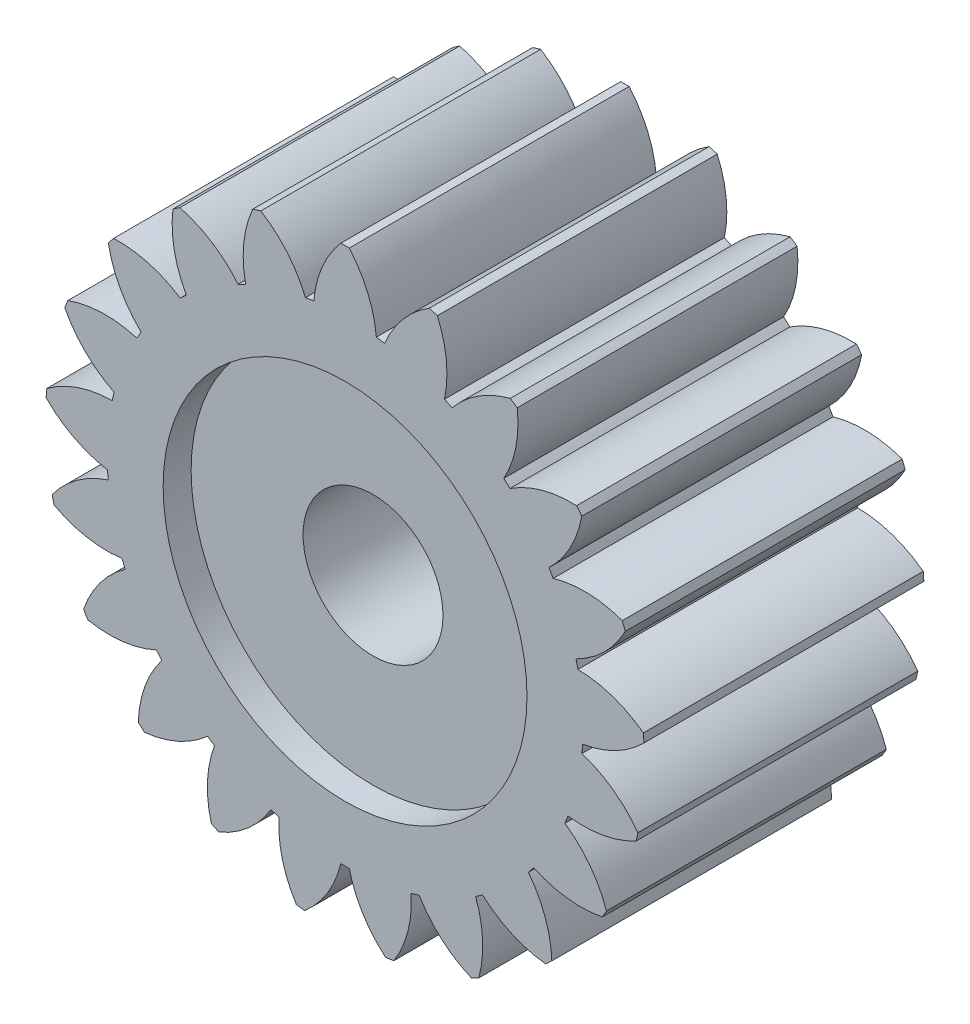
ISO-10303-21;
HEADER;
FILE_DESCRIPTION(('STEP AP214'),'2;1');
FILE_NAME('part.step','',(''),(''),'','','');
FILE_SCHEMA(('AUTOMOTIVE_DESIGN { 1 0 10303 214 1 1 1 1 }'));
ENDSEC;
DATA;
#1=APPLICATION_CONTEXT('core data for automotive mechanical design processes');
#2=APPLICATION_PROTOCOL_DEFINITION('international standard','automotive_design',2000,#1);
#3=PRODUCT_CONTEXT('',#1,'mechanical');
#4=PRODUCT('Part','Part','',(#3));
#5=PRODUCT_RELATED_PRODUCT_CATEGORY('part','',(#4));
#6=PRODUCT_DEFINITION_FORMATION('','',#4);
#7=PRODUCT_DEFINITION_CONTEXT('part definition',#1,'design');
#8=PRODUCT_DEFINITION('design','',#6,#7);
#9=PRODUCT_DEFINITION_SHAPE('','',#8);
#10=(LENGTH_UNIT() NAMED_UNIT(*) SI_UNIT(.MILLI.,.METRE.));
#11=(NAMED_UNIT(*) PLANE_ANGLE_UNIT() SI_UNIT($,.RADIAN.));
#12=(NAMED_UNIT(*) SI_UNIT($,.STERADIAN.) SOLID_ANGLE_UNIT());
#13=UNCERTAINTY_MEASURE_WITH_UNIT(LENGTH_MEASURE(1.E-05),#10,'distance_accuracy_value','');
#14=(GEOMETRIC_REPRESENTATION_CONTEXT(3) GLOBAL_UNCERTAINTY_ASSIGNED_CONTEXT((#13)) GLOBAL_UNIT_ASSIGNED_CONTEXT((#10,
#11,#12)) REPRESENTATION_CONTEXT('',''));
#15=CARTESIAN_POINT('',(0.,0.,0.));
#16=DIRECTION('',(0.,0.,1.));
#17=DIRECTION('',(1.,0.,0.));
#18=AXIS2_PLACEMENT_3D('',#15,#16,#17);
#19=CARTESIAN_POINT('',(0.,0.,1.5));
#20=DIRECTION('',(0.,0.,-1.));
#21=DIRECTION('',(-1.,0.,0.));
#22=AXIS2_PLACEMENT_3D('',#19,#20,#21);
#23=PLANE('',#22);
#24=CARTESIAN_POINT('',(0.,0.,1.5));
#25=DIRECTION('',(0.,0.,-1.));
#26=DIRECTION('',(-1.,0.,0.));
#27=AXIS2_PLACEMENT_3D('',#24,#25,#26);
#28=CIRCLE('',#27,2.5);
#29=CARTESIAN_POINT('',(2.38484800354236,0.75,1.5));
#30=VERTEX_POINT('',#29);
#31=CARTESIAN_POINT('',(2.38484800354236,-0.75,1.5));
#32=VERTEX_POINT('',#31);
#33=EDGE_CURVE('E616',#30,#32,#28,.T.);
#34=ORIENTED_EDGE('',*,*,#33,.F.);
#35=DIRECTION('',(1.,0.,0.));
#36=VECTOR('',#35,1.);
#37=CARTESIAN_POINT('',(5.,0.75,1.5));
#38=LINE('',#37,#36);
#39=CARTESIAN_POINT('',(5.,0.75,1.5));
#40=VERTEX_POINT('',#39);
#41=EDGE_CURVE('E632',#30,#40,#38,.T.);
#42=ORIENTED_EDGE('',*,*,#41,.T.);
#43=DIRECTION('',(0.,-1.,0.));
#44=VECTOR('',#43,1.);
#45=CARTESIAN_POINT('',(5.,0.75,1.5));
#46=LINE('',#45,#44);
#47=CARTESIAN_POINT('',(5.,-0.75,1.5));
#48=VERTEX_POINT('',#47);
#49=EDGE_CURVE('E655',#40,#48,#46,.T.);
#50=ORIENTED_EDGE('',*,*,#49,.T.);
#51=DIRECTION('',(-1.,0.,0.));
#52=VECTOR('',#51,1.);
#53=CARTESIAN_POINT('',(5.,-0.75,1.5));
#54=LINE('',#53,#52);
#55=EDGE_CURVE('E653',#48,#32,#54,.T.);
#56=ORIENTED_EDGE('',*,*,#55,.T.);
#57=EDGE_LOOP('',(#34,#42,#50,#56));
#58=FACE_BOUND('',#57,.T.);
#59=ADVANCED_FACE('F31',(#58),#23,.T.);
#60=CARTESIAN_POINT('',(0.,0.,10.));
#61=DIRECTION('',(0.,0.,-1.));
#62=DIRECTION('',(-1.,0.,0.));
#63=AXIS2_PLACEMENT_3D('',#60,#61,#62);
#64=CYLINDRICAL_SURFACE('',#63,10.7);
#65=CARTESIAN_POINT('',(0.,0.,0.));
#66=DIRECTION('',(0.,0.,1.));
#67=DIRECTION('',(1.,0.,0.));
#68=AXIS2_PLACEMENT_3D('',#65,#66,#67);
#69=CIRCLE('',#68,10.7);
#70=CARTESIAN_POINT('',(3.29690636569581,10.1794110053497,0.));
#71=VERTEX_POINT('',#70);
#72=CARTESIAN_POINT('',(3.01023452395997,10.267837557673,0.));
#73=VERTEX_POINT('',#72);
#74=EDGE_CURVE('E1216',#71,#73,#69,.T.);
#75=ORIENTED_EDGE('',*,*,#74,.T.);
#76=DIRECTION('',(0.,0.,1.));
#77=VECTOR('',#76,1.);
#78=CARTESIAN_POINT('',(3.01023452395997,10.267837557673,0.));
#79=LINE('',#78,#77);
#80=CARTESIAN_POINT('',(3.01023452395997,10.267837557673,10.));
#81=VERTEX_POINT('',#80);
#82=EDGE_CURVE('E1182',#73,#81,#79,.T.);
#83=ORIENTED_EDGE('',*,*,#82,.T.);
#84=CARTESIAN_POINT('',(0.,0.,10.));
#85=DIRECTION('',(0.,0.,1.));
#86=DIRECTION('',(1.,0.,0.));
#87=AXIS2_PLACEMENT_3D('',#84,#85,#86);
#88=CIRCLE('',#87,10.7);
#89=CARTESIAN_POINT('',(3.29690636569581,10.1794110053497,10.));
#90=VERTEX_POINT('',#89);
#91=EDGE_CURVE('E42',#90,#81,#88,.T.);
#92=ORIENTED_EDGE('',*,*,#91,.F.);
#93=DIRECTION('',(0.,0.,1.));
#94=VECTOR('',#93,1.);
#95=CARTESIAN_POINT('',(3.29690636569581,10.1794110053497,0.));
#96=LINE('',#95,#94);
#97=EDGE_CURVE('E1189',#71,#90,#96,.T.);
#98=ORIENTED_EDGE('',*,*,#97,.F.);
#99=EDGE_LOOP('',(#75,#83,#92,#98));
#100=FACE_BOUND('',#99,.T.);
#101=ADVANCED_FACE('F1283',(#100),#64,.T.);
#102=CARTESIAN_POINT('',(6.15086813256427,8.75538812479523,0.));
#103=VERTEX_POINT('',#102);
#104=CARTESIAN_POINT('',(5.90299650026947,8.92438414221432,0.));
#105=VERTEX_POINT('',#104);
#106=EDGE_CURVE('E1224',#103,#105,#69,.T.);
#107=ORIENTED_EDGE('',*,*,#106,.T.);
#108=DIRECTION('',(0.,0.,1.));
#109=VECTOR('',#108,1.);
#110=CARTESIAN_POINT('',(5.90299650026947,8.92438414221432,0.));
#111=LINE('',#110,#109);
#112=CARTESIAN_POINT('',(5.90299650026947,8.92438414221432,10.));
#113=VERTEX_POINT('',#112);
#114=EDGE_CURVE('E57',#105,#113,#111,.T.);
#115=ORIENTED_EDGE('',*,*,#114,.T.);
#116=CARTESIAN_POINT('',(6.15086813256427,8.75538812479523,10.));
#117=VERTEX_POINT('',#116);
#118=EDGE_CURVE('E1228',#117,#113,#88,.T.);
#119=ORIENTED_EDGE('',*,*,#118,.F.);
#120=DIRECTION('',(0.,0.,1.));
#121=VECTOR('',#120,1.);
#122=CARTESIAN_POINT('',(6.15086813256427,8.75538812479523,0.));
#123=LINE('',#122,#121);
#124=EDGE_CURVE('E1164',#103,#117,#123,.T.);
#125=ORIENTED_EDGE('',*,*,#124,.F.);
#126=EDGE_LOOP('',(#107,#115,#119,#125));
#127=FACE_BOUND('',#126,.T.);
#128=ADVANCED_FACE('F1288',(#127),#64,.T.);
#129=CARTESIAN_POINT('',(8.45829827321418,6.55341058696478,0.));
#130=VERTEX_POINT('',#129);
#131=CARTESIAN_POINT('',(8.27125133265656,6.78796003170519,0.));
#132=VERTEX_POINT('',#131);
#133=EDGE_CURVE('E2342',#130,#132,#69,.T.);
#134=ORIENTED_EDGE('',*,*,#133,.T.);
#135=DIRECTION('',(0.,0.,1.));
#136=VECTOR('',#135,1.);
#137=CARTESIAN_POINT('',(8.27125133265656,6.78796003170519,0.));
#138=LINE('',#137,#136);
#139=CARTESIAN_POINT('',(8.27125133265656,6.78796003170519,10.));
#140=VERTEX_POINT('',#139);
#141=EDGE_CURVE('E1133',#132,#140,#138,.T.);
#142=ORIENTED_EDGE('',*,*,#141,.T.);
#143=CARTESIAN_POINT('',(8.45829827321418,6.55341058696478,10.));
#144=VERTEX_POINT('',#143);
#145=EDGE_CURVE('E2325',#144,#140,#88,.T.);
#146=ORIENTED_EDGE('',*,*,#145,.F.);
#147=DIRECTION('',(0.,0.,1.));
#148=VECTOR('',#147,1.);
#149=CARTESIAN_POINT('',(8.45829827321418,6.55341058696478,0.));
#150=LINE('',#149,#148);
#151=EDGE_CURVE('E1140',#130,#144,#150,.T.);
#152=ORIENTED_EDGE('',*,*,#151,.F.);
#153=EDGE_LOOP('',(#134,#142,#146,#152));
#154=FACE_BOUND('',#153,.T.);
#155=ADVANCED_FACE('F2162',(#154),#64,.T.);
#156=CARTESIAN_POINT('',(10.0141714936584,3.76913375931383,0.));
#157=VERTEX_POINT('',#156);
#158=CARTESIAN_POINT('',(9.9045691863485,4.04839588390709,0.));
#159=VERTEX_POINT('',#158);
#160=EDGE_CURVE('E2344',#157,#159,#69,.T.);
#161=ORIENTED_EDGE('',*,*,#160,.T.);
#162=DIRECTION('',(0.,0.,1.));
#163=VECTOR('',#162,1.);
#164=CARTESIAN_POINT('',(9.90456918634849,4.04839588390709,0.));
#165=LINE('',#164,#163);
#166=CARTESIAN_POINT('',(9.90456918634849,4.04839588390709,10.));
#167=VERTEX_POINT('',#166);
#168=EDGE_CURVE('E1107',#159,#167,#165,.T.);
#169=ORIENTED_EDGE('',*,*,#168,.T.);
#170=CARTESIAN_POINT('',(10.0141714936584,3.76913375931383,10.));
#171=VERTEX_POINT('',#170);
#172=EDGE_CURVE('E2320',#171,#167,#88,.T.);
#173=ORIENTED_EDGE('',*,*,#172,.F.);
#174=DIRECTION('',(0.,0.,1.));
#175=VECTOR('',#174,1.);
#176=CARTESIAN_POINT('',(10.0141714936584,3.76913375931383,0.));
#177=LINE('',#176,#175);
#178=EDGE_CURVE('E1114',#157,#171,#177,.T.);
#179=ORIENTED_EDGE('',*,*,#178,.F.);
#180=EDGE_LOOP('',(#161,#169,#173,#179));
#181=FACE_BOUND('',#180,.T.);
#182=ADVANCED_FACE('F2153',(#181),#64,.T.);
#183=CARTESIAN_POINT('',(10.6802416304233,0.649952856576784,0.));
#184=VERTEX_POINT('',#183);
#185=CARTESIAN_POINT('',(10.6578226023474,0.949113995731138,0.));
#186=VERTEX_POINT('',#185);
#187=EDGE_CURVE('E2348',#184,#186,#69,.T.);
#188=ORIENTED_EDGE('',*,*,#187,.T.);
#189=DIRECTION('',(0.,0.,1.));
#190=VECTOR('',#189,1.);
#191=CARTESIAN_POINT('',(10.6578226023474,0.949113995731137,0.));
#192=LINE('',#191,#190);
#193=CARTESIAN_POINT('',(10.6578226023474,0.949113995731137,10.));
#194=VERTEX_POINT('',#193);
#195=EDGE_CURVE('E1081',#186,#194,#192,.T.);
#196=ORIENTED_EDGE('',*,*,#195,.T.);
#197=CARTESIAN_POINT('',(10.6802416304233,0.649952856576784,10.));
#198=VERTEX_POINT('',#197);
#199=EDGE_CURVE('E2315',#198,#194,#88,.T.);
#200=ORIENTED_EDGE('',*,*,#199,.F.);
#201=DIRECTION('',(0.,0.,1.));
#202=VECTOR('',#201,1.);
#203=CARTESIAN_POINT('',(10.6802416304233,0.649952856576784,0.));
#204=LINE('',#203,#202);
#205=EDGE_CURVE('E1088',#184,#198,#204,.T.);
#206=ORIENTED_EDGE('',*,*,#205,.F.);
#207=EDGE_LOOP('',(#188,#196,#200,#206));
#208=FACE_BOUND('',#207,.T.);
#209=ADVANCED_FACE('F2144',(#208),#64,.T.);
#210=CARTESIAN_POINT('',(10.3973254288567,-2.52697920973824,0.));
#211=VERTEX_POINT('',#210);
#212=CARTESIAN_POINT('',(10.4640817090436,-2.23450083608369,0.));
#213=VERTEX_POINT('',#212);
#214=EDGE_CURVE('E2352',#211,#213,#69,.T.);
#215=ORIENTED_EDGE('',*,*,#214,.T.);
#216=DIRECTION('',(0.,0.,1.));
#217=VECTOR('',#216,1.);
#218=CARTESIAN_POINT('',(10.4640817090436,-2.23450083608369,0.));
#219=LINE('',#218,#217);
#220=CARTESIAN_POINT('',(10.4640817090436,-2.23450083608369,10.));
#221=VERTEX_POINT('',#220);
#222=EDGE_CURVE('E1055',#213,#221,#219,.T.);
#223=ORIENTED_EDGE('',*,*,#222,.T.);
#224=CARTESIAN_POINT('',(10.3973254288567,-2.52697920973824,10.));
#225=VERTEX_POINT('',#224);
#226=EDGE_CURVE('E2310',#225,#221,#88,.T.);
#227=ORIENTED_EDGE('',*,*,#226,.F.);
#228=DIRECTION('',(0.,0.,1.));
#229=VECTOR('',#228,1.);
#230=CARTESIAN_POINT('',(10.3973254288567,-2.52697920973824,0.));
#231=LINE('',#230,#229);
#232=EDGE_CURVE('E1062',#211,#225,#231,.T.);
#233=ORIENTED_EDGE('',*,*,#232,.F.);
#234=EDGE_LOOP('',(#215,#223,#227,#233));
#235=FACE_BOUND('',#234,.T.);
#236=ADVANCED_FACE('F2135',(#235),#64,.T.);
#237=CARTESIAN_POINT('',(9.19056123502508,-5.47937808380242,0.));
#238=VERTEX_POINT('',#237);
#239=CARTESIAN_POINT('',(9.34056123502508,-5.21957046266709,0.));
#240=VERTEX_POINT('',#239);
#241=EDGE_CURVE('E2356',#238,#240,#69,.T.);
#242=ORIENTED_EDGE('',*,*,#241,.T.);
#243=DIRECTION('',(0.,0.,1.));
#244=VECTOR('',#243,1.);
#245=CARTESIAN_POINT('',(9.34056123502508,-5.21957046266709,0.));
#246=LINE('',#245,#244);
#247=CARTESIAN_POINT('',(9.34056123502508,-5.21957046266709,10.));
#248=VERTEX_POINT('',#247);
#249=EDGE_CURVE('E1029',#240,#248,#246,.T.);
#250=ORIENTED_EDGE('',*,*,#249,.T.);
#251=CARTESIAN_POINT('',(9.19056123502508,-5.47937808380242,10.));
#252=VERTEX_POINT('',#251);
#253=EDGE_CURVE('E2305',#252,#248,#88,.T.);
#254=ORIENTED_EDGE('',*,*,#253,.F.);
#255=DIRECTION('',(0.,0.,1.));
#256=VECTOR('',#255,1.);
#257=CARTESIAN_POINT('',(9.19056123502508,-5.47937808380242,0.));
#258=LINE('',#257,#256);
#259=EDGE_CURVE('E1036',#238,#252,#258,.T.);
#260=ORIENTED_EDGE('',*,*,#259,.F.);
#261=EDGE_LOOP('',(#242,#250,#254,#260));
#262=FACE_BOUND('',#261,.T.);
#263=ADVANCED_FACE('F2126',(#262),#64,.T.);
#264=CARTESIAN_POINT('',(7.16717534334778,-7.94491016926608,0.));
#265=VERTEX_POINT('',#264);
#266=CARTESIAN_POINT('',(7.38709090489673,-7.74085834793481,0.));
#267=VERTEX_POINT('',#266);
#268=EDGE_CURVE('E2360',#265,#267,#69,.T.);
#269=ORIENTED_EDGE('',*,*,#268,.T.);
#270=DIRECTION('',(0.,0.,1.));
#271=VECTOR('',#270,1.);
#272=CARTESIAN_POINT('',(7.38709090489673,-7.7408583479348,0.));
#273=LINE('',#272,#271);
#274=CARTESIAN_POINT('',(7.38709090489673,-7.7408583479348,10.));
#275=VERTEX_POINT('',#274);
#276=EDGE_CURVE('E1003',#267,#275,#273,.T.);
#277=ORIENTED_EDGE('',*,*,#276,.T.);
#278=CARTESIAN_POINT('',(7.16717534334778,-7.94491016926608,10.));
#279=VERTEX_POINT('',#278);
#280=EDGE_CURVE('E2300',#279,#275,#88,.T.);
#281=ORIENTED_EDGE('',*,*,#280,.F.);
#282=DIRECTION('',(0.,0.,1.));
#283=VECTOR('',#282,1.);
#284=CARTESIAN_POINT('',(7.16717534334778,-7.94491016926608,0.));
#285=LINE('',#284,#283);
#286=EDGE_CURVE('E1010',#265,#279,#285,.T.);
#287=ORIENTED_EDGE('',*,*,#286,.F.);
#288=EDGE_LOOP('',(#269,#277,#281,#287));
#289=FACE_BOUND('',#288,.T.);
#290=ADVANCED_FACE('F2117',(#289),#64,.T.);
#291=CARTESIAN_POINT('',(4.50695446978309,-9.70450212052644,0.));
#292=VERTEX_POINT('',#291);
#293=CARTESIAN_POINT('',(4.77724513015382,-9.57433699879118,0.));
#294=VERTEX_POINT('',#293);
#295=EDGE_CURVE('E2364',#292,#294,#69,.T.);
#296=ORIENTED_EDGE('',*,*,#295,.T.);
#297=DIRECTION('',(0.,0.,1.));
#298=VECTOR('',#297,1.);
#299=CARTESIAN_POINT('',(4.77724513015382,-9.57433699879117,0.));
#300=LINE('',#299,#298);
#301=CARTESIAN_POINT('',(4.77724513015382,-9.57433699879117,10.));
#302=VERTEX_POINT('',#301);
#303=EDGE_CURVE('E977',#294,#302,#300,.T.);
#304=ORIENTED_EDGE('',*,*,#303,.T.);
#305=CARTESIAN_POINT('',(4.50695446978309,-9.70450212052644,10.));
#306=VERTEX_POINT('',#305);
#307=EDGE_CURVE('E2295',#306,#302,#88,.T.);
#308=ORIENTED_EDGE('',*,*,#307,.F.);
#309=DIRECTION('',(0.,0.,1.));
#310=VECTOR('',#309,1.);
#311=CARTESIAN_POINT('',(4.50695446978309,-9.70450212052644,0.));
#312=LINE('',#311,#310);
#313=EDGE_CURVE('E984',#292,#306,#312,.T.);
#314=ORIENTED_EDGE('',*,*,#313,.F.);
#315=EDGE_LOOP('',(#296,#304,#308,#314));
#316=FACE_BOUND('',#315,.T.);
#317=ADVANCED_FACE('F2108',(#316),#64,.T.);
#318=CARTESIAN_POINT('',(1.44627091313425,-10.6018064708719,0.));
#319=VERTEX_POINT('',#318);
#320=CARTESIAN_POINT('',(1.74292016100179,-10.5570937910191,0.));
#321=VERTEX_POINT('',#320);
#322=EDGE_CURVE('E2368',#319,#321,#69,.T.);
#323=ORIENTED_EDGE('',*,*,#322,.T.);
#324=DIRECTION('',(0.,0.,1.));
#325=VECTOR('',#324,1.);
#326=CARTESIAN_POINT('',(1.74292016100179,-10.5570937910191,0.));
#327=LINE('',#326,#325);
#328=CARTESIAN_POINT('',(1.74292016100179,-10.5570937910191,10.));
#329=VERTEX_POINT('',#328);
#330=EDGE_CURVE('E951',#321,#329,#327,.T.);
#331=ORIENTED_EDGE('',*,*,#330,.T.);
#332=CARTESIAN_POINT('',(1.44627091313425,-10.6018064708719,10.));
#333=VERTEX_POINT('',#332);
#334=EDGE_CURVE('E2290',#333,#329,#88,.T.);
#335=ORIENTED_EDGE('',*,*,#334,.F.);
#336=DIRECTION('',(0.,0.,1.));
#337=VECTOR('',#336,1.);
#338=CARTESIAN_POINT('',(1.44627091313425,-10.6018064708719,0.));
#339=LINE('',#338,#337);
#340=EDGE_CURVE('E958',#319,#333,#339,.T.);
#341=ORIENTED_EDGE('',*,*,#340,.F.);
#342=EDGE_LOOP('',(#323,#331,#335,#341));
#343=FACE_BOUND('',#342,.T.);
#344=ADVANCED_FACE('F2099',(#343),#64,.T.);
#345=CARTESIAN_POINT('',(-1.74292016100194,-10.557093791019,0.));
#346=VERTEX_POINT('',#345);
#347=CARTESIAN_POINT('',(-1.4462709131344,-10.6018064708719,0.));
#348=VERTEX_POINT('',#347);
#349=EDGE_CURVE('E2372',#346,#348,#69,.T.);
#350=ORIENTED_EDGE('',*,*,#349,.T.);
#351=DIRECTION('',(0.,0.,1.));
#352=VECTOR('',#351,1.);
#353=CARTESIAN_POINT('',(-1.4462709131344,-10.6018064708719,0.));
#354=LINE('',#353,#352);
#355=CARTESIAN_POINT('',(-1.4462709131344,-10.6018064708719,10.));
#356=VERTEX_POINT('',#355);
#357=EDGE_CURVE('E925',#348,#356,#354,.T.);
#358=ORIENTED_EDGE('',*,*,#357,.T.);
#359=CARTESIAN_POINT('',(-1.74292016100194,-10.557093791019,10.));
#360=VERTEX_POINT('',#359);
#361=EDGE_CURVE('E2285',#360,#356,#88,.T.);
#362=ORIENTED_EDGE('',*,*,#361,.F.);
#363=DIRECTION('',(0.,0.,1.));
#364=VECTOR('',#363,1.);
#365=CARTESIAN_POINT('',(-1.74292016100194,-10.557093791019,0.));
#366=LINE('',#365,#364);
#367=EDGE_CURVE('E932',#346,#360,#366,.T.);
#368=ORIENTED_EDGE('',*,*,#367,.F.);
#369=EDGE_LOOP('',(#350,#358,#362,#368));
#370=FACE_BOUND('',#369,.T.);
#371=ADVANCED_FACE('F2090',(#370),#64,.T.);
#372=CARTESIAN_POINT('',(-4.77724513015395,-9.57433699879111,0.));
#373=VERTEX_POINT('',#372);
#374=CARTESIAN_POINT('',(-4.50695446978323,-9.70450212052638,0.));
#375=VERTEX_POINT('',#374);
#376=EDGE_CURVE('E2376',#373,#375,#69,.T.);
#377=ORIENTED_EDGE('',*,*,#376,.T.);
#378=DIRECTION('',(0.,0.,1.));
#379=VECTOR('',#378,1.);
#380=CARTESIAN_POINT('',(-4.50695446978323,-9.70450212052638,0.));
#381=LINE('',#380,#379);
#382=CARTESIAN_POINT('',(-4.50695446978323,-9.70450212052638,10.));
#383=VERTEX_POINT('',#382);
#384=EDGE_CURVE('E899',#375,#383,#381,.T.);
#385=ORIENTED_EDGE('',*,*,#384,.T.);
#386=CARTESIAN_POINT('',(-4.77724513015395,-9.57433699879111,10.));
#387=VERTEX_POINT('',#386);
#388=EDGE_CURVE('E2280',#387,#383,#88,.T.);
#389=ORIENTED_EDGE('',*,*,#388,.F.);
#390=DIRECTION('',(0.,0.,1.));
#391=VECTOR('',#390,1.);
#392=CARTESIAN_POINT('',(-4.77724513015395,-9.57433699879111,0.));
#393=LINE('',#392,#391);
#394=EDGE_CURVE('E906',#373,#387,#393,.T.);
#395=ORIENTED_EDGE('',*,*,#394,.F.);
#396=EDGE_LOOP('',(#377,#385,#389,#395));
#397=FACE_BOUND('',#396,.T.);
#398=ADVANCED_FACE('F2081',(#397),#64,.T.);
#399=CARTESIAN_POINT('',(-7.38709090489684,-7.7408583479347,0.));
#400=VERTEX_POINT('',#399);
#401=CARTESIAN_POINT('',(-7.16717534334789,-7.94491016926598,0.));
#402=VERTEX_POINT('',#401);
#403=EDGE_CURVE('E2380',#400,#402,#69,.T.);
#404=ORIENTED_EDGE('',*,*,#403,.T.);
#405=DIRECTION('',(0.,0.,1.));
#406=VECTOR('',#405,1.);
#407=CARTESIAN_POINT('',(-7.16717534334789,-7.94491016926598,0.));
#408=LINE('',#407,#406);
#409=CARTESIAN_POINT('',(-7.16717534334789,-7.94491016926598,10.));
#410=VERTEX_POINT('',#409);
#411=EDGE_CURVE('E873',#402,#410,#408,.T.);
#412=ORIENTED_EDGE('',*,*,#411,.T.);
#413=CARTESIAN_POINT('',(-7.38709090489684,-7.7408583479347,10.));
#414=VERTEX_POINT('',#413);
#415=EDGE_CURVE('E2275',#414,#410,#88,.T.);
#416=ORIENTED_EDGE('',*,*,#415,.F.);
#417=DIRECTION('',(0.,0.,1.));
#418=VECTOR('',#417,1.);
#419=CARTESIAN_POINT('',(-7.38709090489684,-7.7408583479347,0.));
#420=LINE('',#419,#418);
#421=EDGE_CURVE('E880',#400,#414,#420,.T.);
#422=ORIENTED_EDGE('',*,*,#421,.F.);
#423=EDGE_LOOP('',(#404,#412,#416,#422));
#424=FACE_BOUND('',#423,.T.);
#425=ADVANCED_FACE('F2072',(#424),#64,.T.);
#426=CARTESIAN_POINT('',(-9.34056123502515,-5.21957046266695,0.));
#427=VERTEX_POINT('',#426);
#428=CARTESIAN_POINT('',(-9.19056123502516,-5.47937808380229,0.));
#429=VERTEX_POINT('',#428);
#430=EDGE_CURVE('E2384',#427,#429,#69,.T.);
#431=ORIENTED_EDGE('',*,*,#430,.T.);
#432=DIRECTION('',(0.,0.,1.));
#433=VECTOR('',#432,1.);
#434=CARTESIAN_POINT('',(-9.19056123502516,-5.47937808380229,0.));
#435=LINE('',#434,#433);
#436=CARTESIAN_POINT('',(-9.19056123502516,-5.47937808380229,10.));
#437=VERTEX_POINT('',#436);
#438=EDGE_CURVE('E847',#429,#437,#435,.T.);
#439=ORIENTED_EDGE('',*,*,#438,.T.);
#440=CARTESIAN_POINT('',(-9.34056123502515,-5.21957046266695,10.));
#441=VERTEX_POINT('',#440);
#442=EDGE_CURVE('E2270',#441,#437,#88,.T.);
#443=ORIENTED_EDGE('',*,*,#442,.F.);
#444=DIRECTION('',(0.,0.,1.));
#445=VECTOR('',#444,1.);
#446=CARTESIAN_POINT('',(-9.34056123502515,-5.21957046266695,0.));
#447=LINE('',#446,#445);
#448=EDGE_CURVE('E854',#427,#441,#447,.T.);
#449=ORIENTED_EDGE('',*,*,#448,.F.);
#450=EDGE_LOOP('',(#431,#439,#443,#449));
#451=FACE_BOUND('',#450,.T.);
#452=ADVANCED_FACE('F2063',(#451),#64,.T.);
#453=CARTESIAN_POINT('',(-10.4640817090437,-2.23450083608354,0.));
#454=VERTEX_POINT('',#453);
#455=CARTESIAN_POINT('',(-10.3973254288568,-2.52697920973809,0.));
#456=VERTEX_POINT('',#455);
#457=EDGE_CURVE('E2388',#454,#456,#69,.T.);
#458=ORIENTED_EDGE('',*,*,#457,.T.);
#459=DIRECTION('',(0.,0.,1.));
#460=VECTOR('',#459,1.);
#461=CARTESIAN_POINT('',(-10.3973254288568,-2.52697920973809,0.));
#462=LINE('',#461,#460);
#463=CARTESIAN_POINT('',(-10.3973254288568,-2.52697920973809,10.));
#464=VERTEX_POINT('',#463);
#465=EDGE_CURVE('E821',#456,#464,#462,.T.);
#466=ORIENTED_EDGE('',*,*,#465,.T.);
#467=CARTESIAN_POINT('',(-10.4640817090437,-2.23450083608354,10.));
#468=VERTEX_POINT('',#467);
#469=EDGE_CURVE('E2265',#468,#464,#88,.T.);
#470=ORIENTED_EDGE('',*,*,#469,.F.);
#471=DIRECTION('',(0.,0.,1.));
#472=VECTOR('',#471,1.);
#473=CARTESIAN_POINT('',(-10.4640817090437,-2.23450083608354,0.));
#474=LINE('',#473,#472);
#475=EDGE_CURVE('E828',#454,#468,#474,.T.);
#476=ORIENTED_EDGE('',*,*,#475,.F.);
#477=EDGE_LOOP('',(#458,#466,#470,#476));
#478=FACE_BOUND('',#477,.T.);
#479=ADVANCED_FACE('F2054',(#478),#64,.T.);
#480=CARTESIAN_POINT('',(-10.6578226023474,0.949113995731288,0.));
#481=VERTEX_POINT('',#480);
#482=CARTESIAN_POINT('',(-10.6802416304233,0.649952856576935,0.));
#483=VERTEX_POINT('',#482);
#484=EDGE_CURVE('E2392',#481,#483,#69,.T.);
#485=ORIENTED_EDGE('',*,*,#484,.T.);
#486=DIRECTION('',(0.,0.,1.));
#487=VECTOR('',#486,1.);
#488=CARTESIAN_POINT('',(-10.6802416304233,0.649952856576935,0.));
#489=LINE('',#488,#487);
#490=CARTESIAN_POINT('',(-10.6802416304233,0.649952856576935,10.));
#491=VERTEX_POINT('',#490);
#492=EDGE_CURVE('E795',#483,#491,#489,.T.);
#493=ORIENTED_EDGE('',*,*,#492,.T.);
#494=CARTESIAN_POINT('',(-10.6578226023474,0.949113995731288,10.));
#495=VERTEX_POINT('',#494);
#496=EDGE_CURVE('E2260',#495,#491,#88,.T.);
#497=ORIENTED_EDGE('',*,*,#496,.F.);
#498=DIRECTION('',(0.,0.,1.));
#499=VECTOR('',#498,1.);
#500=CARTESIAN_POINT('',(-10.6578226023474,0.949113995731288,0.));
#501=LINE('',#500,#499);
#502=EDGE_CURVE('E802',#481,#495,#501,.T.);
#503=ORIENTED_EDGE('',*,*,#502,.F.);
#504=EDGE_LOOP('',(#485,#493,#497,#503));
#505=FACE_BOUND('',#504,.T.);
#506=ADVANCED_FACE('F2045',(#505),#64,.T.);
#507=CARTESIAN_POINT('',(-9.90456918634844,4.04839588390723,0.));
#508=VERTEX_POINT('',#507);
#509=CARTESIAN_POINT('',(-10.0141714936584,3.76913375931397,0.));
#510=VERTEX_POINT('',#509);
#511=EDGE_CURVE('E2396',#508,#510,#69,.T.);
#512=ORIENTED_EDGE('',*,*,#511,.T.);
#513=DIRECTION('',(0.,0.,1.));
#514=VECTOR('',#513,1.);
#515=CARTESIAN_POINT('',(-10.0141714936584,3.76913375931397,0.));
#516=LINE('',#515,#514);
#517=CARTESIAN_POINT('',(-10.0141714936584,3.76913375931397,10.));
#518=VERTEX_POINT('',#517);
#519=EDGE_CURVE('E769',#510,#518,#516,.T.);
#520=ORIENTED_EDGE('',*,*,#519,.T.);
#521=CARTESIAN_POINT('',(-9.90456918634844,4.04839588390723,10.));
#522=VERTEX_POINT('',#521);
#523=EDGE_CURVE('E2255',#522,#518,#88,.T.);
#524=ORIENTED_EDGE('',*,*,#523,.F.);
#525=DIRECTION('',(0.,0.,1.));
#526=VECTOR('',#525,1.);
#527=CARTESIAN_POINT('',(-9.90456918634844,4.04839588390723,0.));
#528=LINE('',#527,#526);
#529=EDGE_CURVE('E776',#508,#522,#528,.T.);
#530=ORIENTED_EDGE('',*,*,#529,.F.);
#531=EDGE_LOOP('',(#512,#520,#524,#530));
#532=FACE_BOUND('',#531,.T.);
#533=ADVANCED_FACE('F2036',(#532),#64,.T.);
#534=CARTESIAN_POINT('',(-8.27125133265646,6.78796003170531,0.));
#535=VERTEX_POINT('',#534);
#536=CARTESIAN_POINT('',(-8.45829827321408,6.5534105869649,0.));
#537=VERTEX_POINT('',#536);
#538=EDGE_CURVE('E2400',#535,#537,#69,.T.);
#539=ORIENTED_EDGE('',*,*,#538,.T.);
#540=DIRECTION('',(0.,0.,1.));
#541=VECTOR('',#540,1.);
#542=CARTESIAN_POINT('',(-8.45829827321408,6.5534105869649,0.));
#543=LINE('',#542,#541);
#544=CARTESIAN_POINT('',(-8.45829827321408,6.5534105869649,10.));
#545=VERTEX_POINT('',#544);
#546=EDGE_CURVE('E743',#537,#545,#543,.T.);
#547=ORIENTED_EDGE('',*,*,#546,.T.);
#548=CARTESIAN_POINT('',(-8.27125133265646,6.78796003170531,10.));
#549=VERTEX_POINT('',#548);
#550=EDGE_CURVE('E2250',#549,#545,#88,.T.);
#551=ORIENTED_EDGE('',*,*,#550,.F.);
#552=DIRECTION('',(0.,0.,1.));
#553=VECTOR('',#552,1.);
#554=CARTESIAN_POINT('',(-8.27125133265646,6.78796003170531,0.));
#555=LINE('',#554,#553);
#556=EDGE_CURVE('E750',#535,#549,#555,.T.);
#557=ORIENTED_EDGE('',*,*,#556,.F.);
#558=EDGE_LOOP('',(#539,#547,#551,#557));
#559=FACE_BOUND('',#558,.T.);
#560=ADVANCED_FACE('F2027',(#559),#64,.T.);
#561=CARTESIAN_POINT('',(-5.90299650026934,8.9243841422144,0.));
#562=VERTEX_POINT('',#561);
#563=CARTESIAN_POINT('',(-6.15086813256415,8.75538812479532,0.));
#564=VERTEX_POINT('',#563);
#565=EDGE_CURVE('E2404',#562,#564,#69,.T.);
#566=ORIENTED_EDGE('',*,*,#565,.T.);
#567=DIRECTION('',(0.,0.,1.));
#568=VECTOR('',#567,1.);
#569=CARTESIAN_POINT('',(-6.15086813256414,8.75538812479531,0.));
#570=LINE('',#569,#568);
#571=CARTESIAN_POINT('',(-6.15086813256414,8.75538812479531,10.));
#572=VERTEX_POINT('',#571);
#573=EDGE_CURVE('E717',#564,#572,#570,.T.);
#574=ORIENTED_EDGE('',*,*,#573,.T.);
#575=CARTESIAN_POINT('',(-5.90299650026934,8.9243841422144,10.));
#576=VERTEX_POINT('',#575);
#577=EDGE_CURVE('E2248',#576,#572,#88,.T.);
#578=ORIENTED_EDGE('',*,*,#577,.F.);
#579=DIRECTION('',(0.,0.,1.));
#580=VECTOR('',#579,1.);
#581=CARTESIAN_POINT('',(-5.90299650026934,8.9243841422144,0.));
#582=LINE('',#581,#580);
#583=EDGE_CURVE('E724',#562,#576,#582,.T.);
#584=ORIENTED_EDGE('',*,*,#583,.F.);
#585=EDGE_LOOP('',(#566,#574,#578,#584));
#586=FACE_BOUND('',#585,.T.);
#587=ADVANCED_FACE('F2022',(#586),#64,.T.);
#588=CARTESIAN_POINT('',(0.15,10.6989485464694,0.));
#589=VERTEX_POINT('',#588);
#590=CARTESIAN_POINT('',(-0.15,10.6989485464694,0.));
#591=VERTEX_POINT('',#590);
#592=EDGE_CURVE('E1225',#589,#591,#69,.T.);
#593=ORIENTED_EDGE('',*,*,#592,.T.);
#594=DIRECTION('',(0.,0.,1.));
#595=VECTOR('',#594,1.);
#596=CARTESIAN_POINT('',(-0.15,10.6989485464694,0.));
#597=LINE('',#596,#595);
#598=CARTESIAN_POINT('',(-0.15,10.6989485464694,10.));
#599=VERTEX_POINT('',#598);
#600=EDGE_CURVE('E1213',#591,#599,#597,.T.);
#601=ORIENTED_EDGE('',*,*,#600,.T.);
#602=CARTESIAN_POINT('',(0.15,10.6989485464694,10.));
#603=VERTEX_POINT('',#602);
#604=EDGE_CURVE('E11',#603,#599,#88,.T.);
#605=ORIENTED_EDGE('',*,*,#604,.F.);
#606=DIRECTION('',(0.,0.,1.));
#607=VECTOR('',#606,1.);
#608=CARTESIAN_POINT('',(0.15,10.6989485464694,0.));
#609=LINE('',#608,#607);
#610=EDGE_CURVE('E1219',#589,#603,#609,.T.);
#611=ORIENTED_EDGE('',*,*,#610,.F.);
#612=EDGE_LOOP('',(#593,#601,#605,#611));
#613=FACE_BOUND('',#612,.T.);
#614=ADVANCED_FACE('F2014',(#613),#64,.T.);
#615=CARTESIAN_POINT('',(-3.01023452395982,10.267837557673,0.));
#616=VERTEX_POINT('',#615);
#617=CARTESIAN_POINT('',(-3.29690636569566,10.1794110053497,0.));
#618=VERTEX_POINT('',#617);
#619=EDGE_CURVE('E2408',#616,#618,#69,.T.);
#620=ORIENTED_EDGE('',*,*,#619,.T.);
#621=DIRECTION('',(0.,0.,1.));
#622=VECTOR('',#621,1.);
#623=CARTESIAN_POINT('',(-3.29690636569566,10.1794110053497,0.));
#624=LINE('',#623,#622);
#625=CARTESIAN_POINT('',(-3.29690636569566,10.1794110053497,10.));
#626=VERTEX_POINT('',#625);
#627=EDGE_CURVE('E690',#618,#626,#624,.T.);
#628=ORIENTED_EDGE('',*,*,#627,.T.);
#629=CARTESIAN_POINT('',(-3.01023452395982,10.267837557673,10.));
#630=VERTEX_POINT('',#629);
#631=EDGE_CURVE('E40',#630,#626,#88,.T.);
#632=ORIENTED_EDGE('',*,*,#631,.F.);
#633=DIRECTION('',(0.,0.,1.));
#634=VECTOR('',#633,1.);
#635=CARTESIAN_POINT('',(-3.01023452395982,10.267837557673,0.));
#636=LINE('',#635,#634);
#637=EDGE_CURVE('E698',#616,#630,#636,.T.);
#638=ORIENTED_EDGE('',*,*,#637,.F.);
#639=EDGE_LOOP('',(#620,#628,#632,#638));
#640=FACE_BOUND('',#639,.T.);
#641=ADVANCED_FACE('F33',(#640),#64,.T.);
#642=CARTESIAN_POINT('',(0.,0.,10.));
#643=DIRECTION('',(0.,0.,1.));
#644=DIRECTION('',(1.,0.,0.));
#645=AXIS2_PLACEMENT_3D('',#642,#643,#644);
#646=PLANE('',#645);
#647=CARTESIAN_POINT('',(0.,0.,10.));
#648=DIRECTION('',(0.,0.,1.));
#649=DIRECTION('',(1.,0.,0.));
#650=AXIS2_PLACEMENT_3D('',#647,#648,#649);
#651=CIRCLE('',#650,6.5);
#652=CARTESIAN_POINT('',(6.5,0.,10.));
#653=VERTEX_POINT('',#652);
#654=EDGE_CURVE('E669',#653,#653,#651,.T.);
#655=ORIENTED_EDGE('',*,*,#654,.F.);
#656=EDGE_LOOP('',(#655));
#657=FACE_BOUND('',#656,.T.);
#658=CARTESIAN_POINT('',(5.11764209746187,6.86800913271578,10.));
#659=DIRECTION('',(0.,0.,-1.));
#660=DIRECTION('',(0.955572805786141,-0.294755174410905,0.));
#661=AXIS2_PLACEMENT_3D('',#658,#659,#660);
#662=CIRCLE('',#661,4.);
#663=CARTESIAN_POINT('',(1.41498660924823,8.38139683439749,10.));
#664=VERTEX_POINT('',#663);
#665=EDGE_CURVE('E1161',#664,#81,#662,.T.);
#666=ORIENTED_EDGE('',*,*,#665,.F.);
#667=CARTESIAN_POINT('',(0.,0.,10.));
#668=DIRECTION('',(0.,0.,-1.));
#669=DIRECTION('',(-1.,0.,0.));
#670=AXIS2_PLACEMENT_3D('',#667,#668,#669);
#671=CIRCLE('',#670,8.5);
#672=CARTESIAN_POINT('',(1.11833736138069,8.42610951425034,10.));
#673=VERTEX_POINT('',#672);
#674=EDGE_CURVE('E1197',#673,#664,#671,.T.);
#675=ORIENTED_EDGE('',*,*,#674,.F.);
#676=CARTESIAN_POINT('',(-2.86589838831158,8.07133424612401,10.));
#677=DIRECTION('',(0.,0.,-1.));
#678=DIRECTION('',(-1.,0.,0.));
#679=AXIS2_PLACEMENT_3D('',#676,#677,#678);
#680=CIRCLE('',#679,4.);
#681=EDGE_CURVE('E1194',#603,#673,#680,.T.);
#682=ORIENTED_EDGE('',*,*,#681,.F.);
#683=ORIENTED_EDGE('',*,*,#604,.T.);
#684=CARTESIAN_POINT('',(2.86589838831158,8.07133424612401,10.));
#685=DIRECTION('',(0.,0.,-1.));
#686=DIRECTION('',(1.,0.,0.));
#687=AXIS2_PLACEMENT_3D('',#684,#685,#686);
#688=CIRCLE('',#687,4.);
#689=CARTESIAN_POINT('',(-1.11833736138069,8.42610951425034,10.));
#690=VERTEX_POINT('',#689);
#691=EDGE_CURVE('E1186',#690,#599,#688,.T.);
#692=ORIENTED_EDGE('',*,*,#691,.F.);
#693=CARTESIAN_POINT('',(0.,0.,10.));
#694=DIRECTION('',(0.,0.,-1.));
#695=DIRECTION('',(1.,0.,0.));
#696=AXIS2_PLACEMENT_3D('',#693,#694,#695);
#697=CIRCLE('',#696,8.5);
#698=CARTESIAN_POINT('',(-1.41498660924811,8.38139683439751,10.));
#699=VERTEX_POINT('',#698);
#700=EDGE_CURVE('E1199',#699,#690,#697,.T.);
#701=ORIENTED_EDGE('',*,*,#700,.F.);
#702=CARTESIAN_POINT('',(-5.11764209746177,6.86800913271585,10.));
#703=DIRECTION('',(0.,0.,-1.));
#704=DIRECTION('',(-0.955572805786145,-0.294755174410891,0.));
#705=AXIS2_PLACEMENT_3D('',#702,#703,#704);
#706=CIRCLE('',#705,4.);
#707=EDGE_CURVE('E681',#630,#699,#706,.T.);
#708=ORIENTED_EDGE('',*,*,#707,.F.);
#709=ORIENTED_EDGE('',*,*,#631,.T.);
#710=CARTESIAN_POINT('',(0.359507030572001,8.55748589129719,10.));
#711=DIRECTION('',(0.,0.,-1.));
#712=DIRECTION('',(0.955572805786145,0.294755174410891,0.));
#713=AXIS2_PLACEMENT_3D('',#710,#711,#712);
#714=CIRCLE('',#713,4.);
#715=CARTESIAN_POINT('',(-3.55229214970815,7.72212538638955,10.));
#716=VERTEX_POINT('',#715);
#717=EDGE_CURVE('E679',#716,#626,#714,.T.);
#718=ORIENTED_EDGE('',*,*,#717,.F.);
#719=CARTESIAN_POINT('',(0.,0.,10.));
#720=DIRECTION('',(0.,0.,-1.));
#721=DIRECTION('',(-0.826238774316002,-0.563320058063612,0.));
#722=AXIS2_PLACEMENT_3D('',#719,#720,#721);
#723=CIRCLE('',#722,8.5);
#724=CARTESIAN_POINT('',(-3.82258281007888,7.59196026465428,10.));
#725=VERTEX_POINT('',#724);
#726=EDGE_CURVE('E706',#725,#716,#723,.T.);
#727=ORIENTED_EDGE('',*,*,#726,.F.);
#728=CARTESIAN_POINT('',(-6.91466084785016,5.05443126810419,10.));
#729=DIRECTION('',(0.,0.,-1.));
#730=DIRECTION('',(-0.826238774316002,-0.563320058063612,0.));
#731=AXIS2_PLACEMENT_3D('',#728,#729,#730);
#732=CIRCLE('',#731,4.);
#733=EDGE_CURVE('E703',#576,#725,#732,.T.);
#734=ORIENTED_EDGE('',*,*,#733,.F.);
#735=ORIENTED_EDGE('',*,*,#577,.T.);
#736=CARTESIAN_POINT('',(-2.17882810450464,8.28326736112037,10.));
#737=DIRECTION('',(0.,0.,-1.));
#738=DIRECTION('',(0.826238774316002,0.563320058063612,0.));
#739=AXIS2_PLACEMENT_3D('',#736,#737,#738);
#740=CIRCLE('',#739,4.);
#741=CARTESIAN_POINT('',(-5.67061019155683,6.33199652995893,10.));
#742=VERTEX_POINT('',#741);
#743=EDGE_CURVE('E694',#742,#572,#740,.T.);
#744=ORIENTED_EDGE('',*,*,#743,.F.);
#745=CARTESIAN_POINT('',(0.,0.,10.));
#746=DIRECTION('',(0.,0.,-1.));
#747=DIRECTION('',(-0.623489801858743,-0.781831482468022,0.));
#748=AXIS2_PLACEMENT_3D('',#745,#746,#747);
#749=CIRCLE('',#748,8.5);
#750=CARTESIAN_POINT('',(-5.89052575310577,6.12794470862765,10.));
#751=VERTEX_POINT('',#750);
#752=EDGE_CURVE('E732',#751,#742,#749,.T.);
#753=ORIENTED_EDGE('',*,*,#752,.F.);
#754=CARTESIAN_POINT('',(-8.09728163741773,2.79174500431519,10.));
#755=DIRECTION('',(0.,0.,-1.));
#756=DIRECTION('',(-0.623489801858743,-0.781831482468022,0.));
#757=AXIS2_PLACEMENT_3D('',#754,#755,#756);
#758=CIRCLE('',#757,4.);
#759=EDGE_CURVE('E729',#549,#751,#758,.T.);
#760=ORIENTED_EDGE('',*,*,#759,.F.);
#761=ORIENTED_EDGE('',*,*,#550,.T.);
#762=CARTESIAN_POINT('',(-4.52356480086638,7.2730441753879,10.));
#763=DIRECTION('',(0.,0.,-1.));
#764=DIRECTION('',(0.623489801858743,0.781831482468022,0.));
#765=AXIS2_PLACEMENT_3D('',#762,#763,#764);
#766=CIRCLE('',#765,4.);
#767=CARTESIAN_POINT('',(-7.28506963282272,4.37924199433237,10.));
#768=VERTEX_POINT('',#767);
#769=EDGE_CURVE('E721',#768,#545,#766,.T.);
#770=ORIENTED_EDGE('',*,*,#769,.F.);
#771=CARTESIAN_POINT('',(0.,0.,10.));
#772=DIRECTION('',(0.,0.,-1.));
#773=DIRECTION('',(-0.365341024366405,-0.9308737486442,0.));
#774=AXIS2_PLACEMENT_3D('',#771,#772,#773);
#775=CIRCLE('',#774,8.5);
#776=CARTESIAN_POINT('',(-7.43506963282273,4.11943437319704,10.));
#777=VERTEX_POINT('',#776);
#778=EDGE_CURVE('E758',#777,#768,#775,.T.);
#779=ORIENTED_EDGE('',*,*,#778,.F.);
#780=CARTESIAN_POINT('',(-8.56042341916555,0.280999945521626,10.));
#781=DIRECTION('',(0.,0.,-1.));
#782=DIRECTION('',(-0.365341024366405,-0.9308737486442,0.));
#783=AXIS2_PLACEMENT_3D('',#780,#781,#782);
#784=CIRCLE('',#783,4.);
#785=EDGE_CURVE('E755',#522,#777,#784,.T.);
#786=ORIENTED_EDGE('',*,*,#785,.F.);
#787=ORIENTED_EDGE('',*,*,#523,.T.);
#788=CARTESIAN_POINT('',(-6.46636291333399,5.61657909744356,10.));
#789=DIRECTION('',(0.,0.,-1.));
#790=DIRECTION('',(0.365341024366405,0.9308737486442,0.));
#791=AXIS2_PLACEMENT_3D('',#788,#789,#790);
#792=CIRCLE('',#791,4.);
#793=CARTESIAN_POINT('',(-8.25221866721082,2.03737258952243,10.));
#794=VERTEX_POINT('',#793);
#795=EDGE_CURVE('E747',#794,#518,#792,.T.);
#796=ORIENTED_EDGE('',*,*,#795,.F.);
#797=CARTESIAN_POINT('',(0.,0.,10.));
#798=DIRECTION('',(0.,0.,-1.));
#799=DIRECTION('',(-0.074730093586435,-0.997203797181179,0.));
#800=AXIS2_PLACEMENT_3D('',#797,#798,#799);
#801=CIRCLE('',#800,8.5);
#802=CARTESIAN_POINT('',(-8.31897494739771,1.74489421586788,10.));
#803=VERTEX_POINT('',#802);
#804=EDGE_CURVE('E784',#803,#794,#801,.T.);
#805=ORIENTED_EDGE('',*,*,#804,.F.);
#806=CARTESIAN_POINT('',(-8.2629340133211,-2.25471319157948,10.));
#807=DIRECTION('',(0.,0.,-1.));
#808=DIRECTION('',(-0.074730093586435,-0.997203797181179,0.));
#809=AXIS2_PLACEMENT_3D('',#806,#807,#808);
#810=CIRCLE('',#809,4.);
#811=EDGE_CURVE('E781',#495,#803,#810,.T.);
#812=ORIENTED_EDGE('',*,*,#811,.F.);
#813=ORIENTED_EDGE('',*,*,#496,.T.);
#814=CARTESIAN_POINT('',(-7.83459630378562,3.46105631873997,10.));
#815=DIRECTION('',(0.,0.,-1.));
#816=DIRECTION('',(0.074730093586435,0.997203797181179,0.));
#817=AXIS2_PLACEMENT_3D('',#814,#815,#816);
#818=CIRCLE('',#817,4.);
#819=CARTESIAN_POINT('',(-8.48612185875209,-0.485526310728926,10.));
#820=VERTEX_POINT('',#819);
#821=EDGE_CURVE('E773',#820,#491,#818,.T.);
#822=ORIENTED_EDGE('',*,*,#821,.F.);
#823=CARTESIAN_POINT('',(0.,0.,10.));
#824=DIRECTION('',(0.,0.,-1.));
#825=DIRECTION('',(0.222520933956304,-0.974927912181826,0.));
#826=AXIS2_PLACEMENT_3D('',#823,#824,#825);
#827=CIRCLE('',#826,8.5);
#828=CARTESIAN_POINT('',(-8.46370283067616,-0.784687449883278,10.));
#829=VERTEX_POINT('',#828);
#830=EDGE_CURVE('E810',#829,#820,#827,.T.);
#831=ORIENTED_EDGE('',*,*,#830,.F.);
#832=CARTESIAN_POINT('',(-7.2312466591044,-4.59008516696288,10.));
#833=DIRECTION('',(0.,0.,-1.));
#834=DIRECTION('',(0.222520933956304,-0.974927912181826,0.));
#835=AXIS2_PLACEMENT_3D('',#832,#833,#834);
#836=CIRCLE('',#835,4.);
#837=EDGE_CURVE('E807',#468,#829,#836,.T.);
#838=ORIENTED_EDGE('',*,*,#837,.F.);
#839=ORIENTED_EDGE('',*,*,#469,.T.);
#840=CARTESIAN_POINT('',(-8.50669143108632,0.998003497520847,10.));
#841=DIRECTION('',(0.,0.,-1.));
#842=DIRECTION('',(-0.222520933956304,0.974927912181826,0.));
#843=AXIS2_PLACEMENT_3D('',#840,#841,#842);
#844=CIRCLE('',#843,4.);
#845=CARTESIAN_POINT('',(-7.96599588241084,-2.96528406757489,10.));
#846=VERTEX_POINT('',#845);
#847=EDGE_CURVE('E799',#846,#464,#844,.T.);
#848=ORIENTED_EDGE('',*,*,#847,.F.);
#849=CARTESIAN_POINT('',(0.,0.,10.));
#850=DIRECTION('',(0.,0.,-1.));
#851=DIRECTION('',(0.499999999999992,-0.866025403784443,0.));
#852=AXIS2_PLACEMENT_3D('',#849,#850,#851);
#853=CIRCLE('',#852,8.5);
#854=CARTESIAN_POINT('',(-7.85639357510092,-3.24454619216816,10.));
#855=VERTEX_POINT('',#854);
#856=EDGE_CURVE('E836',#855,#846,#853,.T.);
#857=ORIENTED_EDGE('',*,*,#856,.F.);
#858=CARTESIAN_POINT('',(-5.55703130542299,-6.51760793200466,10.));
#859=DIRECTION('',(0.,0.,-1.));
#860=DIRECTION('',(0.499999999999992,-0.866025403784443,0.));
#861=AXIS2_PLACEMENT_3D('',#858,#859,#860);
#862=CIRCLE('',#861,4.);
#863=EDGE_CURVE('E833',#441,#855,#862,.T.);
#864=ORIENTED_EDGE('',*,*,#863,.F.);
#865=ORIENTED_EDGE('',*,*,#442,.T.);
#866=CARTESIAN_POINT('',(-8.42292969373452,-1.55372631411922,10.));
#867=DIRECTION('',(0.,0.,-1.));
#868=DIRECTION('',(-0.499999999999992,0.866025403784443,0.));
#869=AXIS2_PLACEMENT_3D('',#866,#867,#868);
#870=CIRCLE('',#869,4.);
#871=CARTESIAN_POINT('',(-6.73805621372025,-5.18156332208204,10.));
#872=VERTEX_POINT('',#871);
#873=EDGE_CURVE('E825',#872,#437,#870,.T.);
#874=ORIENTED_EDGE('',*,*,#873,.F.);
#875=CARTESIAN_POINT('',(0.,0.,10.));
#876=DIRECTION('',(0.,0.,-1.));
#877=DIRECTION('',(0.73305187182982,-0.680172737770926,0.));
#878=AXIS2_PLACEMENT_3D('',#875,#876,#877);
#879=CIRCLE('',#878,8.5);
#880=CARTESIAN_POINT('',(-6.55100927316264,-5.41611276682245,10.));
#881=VERTEX_POINT('',#880);
#882=EDGE_CURVE('E862',#881,#872,#879,.T.);
#883=ORIENTED_EDGE('',*,*,#882,.F.);
#884=CARTESIAN_POINT('',(-3.38904933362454,-7.86601263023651,10.));
#885=DIRECTION('',(0.,0.,-1.));
#886=DIRECTION('',(0.73305187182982,-0.680172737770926,0.));
#887=AXIS2_PLACEMENT_3D('',#884,#885,#886);
#888=CIRCLE('',#887,4.);
#889=EDGE_CURVE('E859',#414,#881,#888,.T.);
#890=ORIENTED_EDGE('',*,*,#889,.F.);
#891=ORIENTED_EDGE('',*,*,#415,.T.);
#892=CARTESIAN_POINT('',(-7.59075368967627,-3.96740072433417,10.));
#893=DIRECTION('',(0.,0.,-1.));
#894=DIRECTION('',(-0.73305187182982,0.680172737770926,0.));
#895=AXIS2_PLACEMENT_3D('',#892,#893,#894);
#896=CIRCLE('',#895,4.);
#897=CARTESIAN_POINT('',(-4.91141068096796,-6.93743793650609,10.));
#898=VERTEX_POINT('',#897);
#899=EDGE_CURVE('E851',#898,#410,#896,.T.);
#900=ORIENTED_EDGE('',*,*,#899,.F.);
#901=CARTESIAN_POINT('',(0.,0.,10.));
#902=DIRECTION('',(0.,0.,-1.));
#903=DIRECTION('',(0.900968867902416,-0.433883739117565,0.));
#904=AXIS2_PLACEMENT_3D('',#901,#902,#903);
#905=CIRCLE('',#904,8.5);
#906=CARTESIAN_POINT('',(-4.66353904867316,-7.10643395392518,10.));
#907=VERTEX_POINT('',#906);
#908=EDGE_CURVE('E888',#907,#898,#905,.T.);
#909=ORIENTED_EDGE('',*,*,#908,.F.);
#910=CARTESIAN_POINT('',(-0.919935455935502,-8.51548758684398,10.));
#911=DIRECTION('',(0.,0.,-1.));
#912=DIRECTION('',(0.900968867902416,-0.433883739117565,0.));
#913=AXIS2_PLACEMENT_3D('',#910,#911,#912);
#914=CIRCLE('',#913,4.);
#915=EDGE_CURVE('E885',#387,#907,#914,.T.);
#916=ORIENTED_EDGE('',*,*,#915,.F.);
#917=ORIENTED_EDGE('',*,*,#388,.T.);
#918=CARTESIAN_POINT('',(-6.08410590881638,-6.02855416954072,10.));
#919=DIRECTION('',(0.,0.,-1.));
#920=DIRECTION('',(-0.900968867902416,0.433883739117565,0.));
#921=AXIS2_PLACEMENT_3D('',#918,#919,#920);
#922=CIRCLE('',#921,4.);
#923=CARTESIAN_POINT('',(-2.64836475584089,-8.07689074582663,10.));
#924=VERTEX_POINT('',#923);
#925=EDGE_CURVE('E877',#924,#383,#922,.T.);
#926=ORIENTED_EDGE('',*,*,#925,.F.);
#927=CARTESIAN_POINT('',(0.,0.,10.));
#928=DIRECTION('',(0.,0.,-1.));
#929=DIRECTION('',(0.988830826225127,-0.149042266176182,0.));
#930=AXIS2_PLACEMENT_3D('',#927,#928,#929);
#931=CIRCLE('',#930,8.5);
#932=CARTESIAN_POINT('',(-2.36169291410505,-8.1653172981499,10.));
#933=VERTEX_POINT('',#932);
#934=EDGE_CURVE('E914',#933,#924,#931,.T.);
#935=ORIENTED_EDGE('',*,*,#934,.F.);
#936=CARTESIAN_POINT('',(1.63091872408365,-8.4083241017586,10.));
#937=DIRECTION('',(0.,0.,-1.));
#938=DIRECTION('',(0.988830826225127,-0.149042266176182,0.));
#939=AXIS2_PLACEMENT_3D('',#936,#937,#938);
#940=CIRCLE('',#939,4.);
#941=EDGE_CURVE('E911',#360,#933,#940,.T.);
#942=ORIENTED_EDGE('',*,*,#941,.F.);
#943=ORIENTED_EDGE('',*,*,#361,.T.);
#944=CARTESIAN_POINT('',(-4.03685861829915,-7.55404412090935,10.));
#945=DIRECTION('',(0.,0.,-1.));
#946=DIRECTION('',(-0.988830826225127,0.149042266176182,0.));
#947=AXIS2_PLACEMENT_3D('',#944,#945,#946);
#948=CIRCLE('',#947,4.);
#949=CARTESIAN_POINT('',(-0.150000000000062,-8.49867636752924,10.));
#950=VERTEX_POINT('',#949);
#951=EDGE_CURVE('E903',#950,#356,#948,.T.);
#952=ORIENTED_EDGE('',*,*,#951,.F.);
#953=CARTESIAN_POINT('',(0.,0.,10.));
#954=DIRECTION('',(0.,0.,-1.));
#955=DIRECTION('',(0.98883082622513,0.149042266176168,0.));
#956=AXIS2_PLACEMENT_3D('',#953,#954,#955);
#957=CIRCLE('',#956,8.5);
#958=CARTESIAN_POINT('',(0.14999999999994,-8.49867636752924,10.));
#959=VERTEX_POINT('',#958);
#960=EDGE_CURVE('E940',#959,#950,#957,.T.);
#961=ORIENTED_EDGE('',*,*,#960,.F.);
#962=CARTESIAN_POINT('',(4.03685861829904,-7.55404412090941,10.));
#963=DIRECTION('',(0.,0.,-1.));
#964=DIRECTION('',(0.98883082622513,0.149042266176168,0.));
#965=AXIS2_PLACEMENT_3D('',#962,#963,#964);
#966=CIRCLE('',#965,4.);
#967=EDGE_CURVE('E937',#333,#959,#966,.T.);
#968=ORIENTED_EDGE('',*,*,#967,.F.);
#969=ORIENTED_EDGE('',*,*,#334,.T.);
#970=CARTESIAN_POINT('',(-1.63091872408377,-8.40832410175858,10.));
#971=DIRECTION('',(0.,0.,-1.));
#972=DIRECTION('',(-0.98883082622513,-0.149042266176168,0.));
#973=AXIS2_PLACEMENT_3D('',#970,#971,#972);
#974=CIRCLE('',#973,4.);
#975=CARTESIAN_POINT('',(2.36169291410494,-8.16531729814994,10.));
#976=VERTEX_POINT('',#975);
#977=EDGE_CURVE('E929',#976,#329,#974,.T.);
#978=ORIENTED_EDGE('',*,*,#977,.F.);
#979=CARTESIAN_POINT('',(0.,0.,10.));
#980=DIRECTION('',(0.,0.,-1.));
#981=DIRECTION('',(0.900968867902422,0.433883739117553,0.));
#982=AXIS2_PLACEMENT_3D('',#979,#980,#981);
#983=CIRCLE('',#982,8.5);
#984=CARTESIAN_POINT('',(2.64836475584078,-8.07689074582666,10.));
#985=VERTEX_POINT('',#984);
#986=EDGE_CURVE('E966',#985,#976,#983,.T.);
#987=ORIENTED_EDGE('',*,*,#986,.F.);
#988=CARTESIAN_POINT('',(6.0841059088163,-6.02855416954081,10.));
#989=DIRECTION('',(0.,0.,-1.));
#990=DIRECTION('',(0.900968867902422,0.433883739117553,0.));
#991=AXIS2_PLACEMENT_3D('',#988,#989,#990);
#992=CIRCLE('',#991,4.);
#993=EDGE_CURVE('E963',#306,#985,#992,.T.);
#994=ORIENTED_EDGE('',*,*,#993,.F.);
#995=ORIENTED_EDGE('',*,*,#307,.T.);
#996=CARTESIAN_POINT('',(0.919935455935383,-8.515487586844,10.));
#997=DIRECTION('',(0.,0.,-1.));
#998=DIRECTION('',(-0.900968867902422,-0.433883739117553,0.));
#999=AXIS2_PLACEMENT_3D('',#996,#997,#998);
#1000=CIRCLE('',#999,4.);
#1001=CARTESIAN_POINT('',(4.66353904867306,-7.10643395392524,10.));
#1002=VERTEX_POINT('',#1001);
#1003=EDGE_CURVE('E955',#1002,#302,#1000,.T.);
#1004=ORIENTED_EDGE('',*,*,#1003,.F.);
#1005=CARTESIAN_POINT('',(0.,0.,10.));
#1006=DIRECTION('',(0.,0.,-1.));
#1007=DIRECTION('',(0.73305187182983,0.680172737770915,0.));
#1008=AXIS2_PLACEMENT_3D('',#1005,#1006,#1007);
#1009=CIRCLE('',#1008,8.5);
#1010=CARTESIAN_POINT('',(4.91141068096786,-6.93743793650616,10.));
#1011=VERTEX_POINT('',#1010);
#1012=EDGE_CURVE('E992',#1011,#1002,#1009,.T.);
#1013=ORIENTED_EDGE('',*,*,#1012,.F.);
#1014=CARTESIAN_POINT('',(7.59075368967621,-3.96740072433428,10.));
#1015=DIRECTION('',(0.,0.,-1.));
#1016=DIRECTION('',(0.73305187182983,0.680172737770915,0.));
#1017=AXIS2_PLACEMENT_3D('',#1014,#1015,#1016);
#1018=CIRCLE('',#1017,4.);
#1019=EDGE_CURVE('E989',#279,#1011,#1018,.T.);
#1020=ORIENTED_EDGE('',*,*,#1019,.F.);
#1021=ORIENTED_EDGE('',*,*,#280,.T.);
#1022=CARTESIAN_POINT('',(3.38904933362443,-7.86601263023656,10.));
#1023=DIRECTION('',(0.,0.,-1.));
#1024=DIRECTION('',(-0.73305187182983,-0.680172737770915,0.));
#1025=AXIS2_PLACEMENT_3D('',#1022,#1023,#1024);
#1026=CIRCLE('',#1025,4.);
#1027=CARTESIAN_POINT('',(6.55100927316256,-5.41611276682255,10.));
#1028=VERTEX_POINT('',#1027);
#1029=EDGE_CURVE('E981',#1028,#275,#1026,.T.);
#1030=ORIENTED_EDGE('',*,*,#1029,.F.);
#1031=CARTESIAN_POINT('',(0.,0.,10.));
#1032=DIRECTION('',(0.,0.,-1.));
#1033=DIRECTION('',(0.500000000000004,0.866025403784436,0.));
#1034=AXIS2_PLACEMENT_3D('',#1031,#1032,#1033);
#1035=CIRCLE('',#1034,8.5);
#1036=CARTESIAN_POINT('',(6.73805621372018,-5.18156332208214,10.));
#1037=VERTEX_POINT('',#1036);
#1038=EDGE_CURVE('E1018',#1037,#1028,#1035,.T.);
#1039=ORIENTED_EDGE('',*,*,#1038,.F.);
#1040=CARTESIAN_POINT('',(8.4229296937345,-1.55372631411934,10.));
#1041=DIRECTION('',(0.,0.,-1.));
#1042=DIRECTION('',(0.500000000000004,0.866025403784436,0.));
#1043=AXIS2_PLACEMENT_3D('',#1040,#1041,#1042);
#1044=CIRCLE('',#1043,4.);
#1045=EDGE_CURVE('E1015',#252,#1037,#1044,.T.);
#1046=ORIENTED_EDGE('',*,*,#1045,.F.);
#1047=ORIENTED_EDGE('',*,*,#253,.T.);
#1048=CARTESIAN_POINT('',(5.5570313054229,-6.51760793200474,10.));
#1049=DIRECTION('',(0.,0.,-1.));
#1050=DIRECTION('',(-0.500000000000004,-0.866025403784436,0.));
#1051=AXIS2_PLACEMENT_3D('',#1048,#1049,#1050);
#1052=CIRCLE('',#1051,4.);
#1053=CARTESIAN_POINT('',(7.85639357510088,-3.24454619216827,10.));
#1054=VERTEX_POINT('',#1053);
#1055=EDGE_CURVE('E1007',#1054,#248,#1052,.T.);
#1056=ORIENTED_EDGE('',*,*,#1055,.F.);
#1057=CARTESIAN_POINT('',(0.,0.,10.));
#1058=DIRECTION('',(0.,0.,-1.));
#1059=DIRECTION('',(0.222520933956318,0.974927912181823,0.));
#1060=AXIS2_PLACEMENT_3D('',#1057,#1058,#1059);
#1061=CIRCLE('',#1060,8.5);
#1062=CARTESIAN_POINT('',(7.9659958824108,-2.96528406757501,10.));
#1063=VERTEX_POINT('',#1062);
#1064=EDGE_CURVE('E1044',#1063,#1054,#1061,.T.);
#1065=ORIENTED_EDGE('',*,*,#1064,.F.);
#1066=CARTESIAN_POINT('',(8.50669143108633,0.998003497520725,10.));
#1067=DIRECTION('',(0.,0.,-1.));
#1068=DIRECTION('',(0.222520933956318,0.974927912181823,0.));
#1069=AXIS2_PLACEMENT_3D('',#1066,#1067,#1068);
#1070=CIRCLE('',#1069,4.);
#1071=EDGE_CURVE('E1041',#225,#1063,#1070,.T.);
#1072=ORIENTED_EDGE('',*,*,#1071,.F.);
#1073=ORIENTED_EDGE('',*,*,#226,.T.);
#1074=CARTESIAN_POINT('',(7.23124665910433,-4.59008516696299,10.));
#1075=DIRECTION('',(0.,0.,-1.));
#1076=DIRECTION('',(-0.222520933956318,-0.974927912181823,0.));
#1077=AXIS2_PLACEMENT_3D('',#1074,#1075,#1076);
#1078=CIRCLE('',#1077,4.);
#1079=CARTESIAN_POINT('',(8.46370283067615,-0.784687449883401,10.));
#1080=VERTEX_POINT('',#1079);
#1081=EDGE_CURVE('E1033',#1080,#221,#1078,.T.);
#1082=ORIENTED_EDGE('',*,*,#1081,.F.);
#1083=CARTESIAN_POINT('',(0.,0.,10.));
#1084=DIRECTION('',(0.,0.,-1.));
#1085=DIRECTION('',(-0.0747300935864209,0.997203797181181,0.));
#1086=AXIS2_PLACEMENT_3D('',#1083,#1084,#1085);
#1087=CIRCLE('',#1086,8.5);
#1088=CARTESIAN_POINT('',(8.48612185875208,-0.485526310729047,10.));
#1089=VERTEX_POINT('',#1088);
#1090=EDGE_CURVE('E1070',#1089,#1080,#1087,.T.);
#1091=ORIENTED_EDGE('',*,*,#1090,.F.);
#1092=CARTESIAN_POINT('',(7.83459630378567,3.46105631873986,10.));
#1093=DIRECTION('',(0.,0.,-1.));
#1094=DIRECTION('',(-0.0747300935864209,0.997203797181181,0.));
#1095=AXIS2_PLACEMENT_3D('',#1092,#1093,#1094);
#1096=CIRCLE('',#1095,4.);
#1097=EDGE_CURVE('E1067',#198,#1089,#1096,.T.);
#1098=ORIENTED_EDGE('',*,*,#1097,.F.);
#1099=ORIENTED_EDGE('',*,*,#199,.T.);
#1100=CARTESIAN_POINT('',(8.26293401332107,-2.2547131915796,10.));
#1101=DIRECTION('',(0.,0.,-1.));
#1102=DIRECTION('',(0.0747300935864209,-0.997203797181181,0.));
#1103=AXIS2_PLACEMENT_3D('',#1100,#1101,#1102);
#1104=CIRCLE('',#1103,4.);
#1105=CARTESIAN_POINT('',(8.31897494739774,1.74489421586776,10.));
#1106=VERTEX_POINT('',#1105);
#1107=EDGE_CURVE('E1059',#1106,#194,#1104,.T.);
#1108=ORIENTED_EDGE('',*,*,#1107,.F.);
#1109=CARTESIAN_POINT('',(0.,0.,10.));
#1110=DIRECTION('',(0.,0.,-1.));
#1111=DIRECTION('',(-0.365341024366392,0.930873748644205,0.));
#1112=AXIS2_PLACEMENT_3D('',#1109,#1110,#1111);
#1113=CIRCLE('',#1112,8.5);
#1114=CARTESIAN_POINT('',(8.25221866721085,2.03737258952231,10.));
#1115=VERTEX_POINT('',#1114);
#1116=EDGE_CURVE('E1096',#1115,#1106,#1113,.T.);
#1117=ORIENTED_EDGE('',*,*,#1116,.F.);
#1118=CARTESIAN_POINT('',(6.46636291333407,5.61657909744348,10.));
#1119=DIRECTION('',(0.,0.,-1.));
#1120=DIRECTION('',(-0.365341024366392,0.930873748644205,0.));
#1121=AXIS2_PLACEMENT_3D('',#1118,#1119,#1120);
#1122=CIRCLE('',#1121,4.);
#1123=EDGE_CURVE('E1093',#171,#1115,#1122,.T.);
#1124=ORIENTED_EDGE('',*,*,#1123,.F.);
#1125=ORIENTED_EDGE('',*,*,#172,.T.);
#1126=CARTESIAN_POINT('',(8.56042341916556,0.280999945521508,10.));
#1127=DIRECTION('',(0.,0.,-1.));
#1128=DIRECTION('',(0.365341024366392,-0.930873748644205,0.));
#1129=AXIS2_PLACEMENT_3D('',#1126,#1127,#1128);
#1130=CIRCLE('',#1129,4.);
#1131=CARTESIAN_POINT('',(7.43506963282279,4.11943437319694,10.));
#1132=VERTEX_POINT('',#1131);
#1133=EDGE_CURVE('E1085',#1132,#167,#1130,.T.);
#1134=ORIENTED_EDGE('',*,*,#1133,.F.);
#1135=CARTESIAN_POINT('',(0.,0.,10.));
#1136=DIRECTION('',(0.,0.,-1.));
#1137=DIRECTION('',(-0.623489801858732,0.781831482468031,0.));
#1138=AXIS2_PLACEMENT_3D('',#1135,#1136,#1137);
#1139=CIRCLE('',#1138,8.5);
#1140=CARTESIAN_POINT('',(7.28506963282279,4.37924199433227,10.));
#1141=VERTEX_POINT('',#1140);
#1142=EDGE_CURVE('E1122',#1141,#1132,#1139,.T.);
#1143=ORIENTED_EDGE('',*,*,#1142,.F.);
#1144=CARTESIAN_POINT('',(4.52356480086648,7.27304417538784,10.));
#1145=DIRECTION('',(0.,0.,-1.));
#1146=DIRECTION('',(-0.623489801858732,0.781831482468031,0.));
#1147=AXIS2_PLACEMENT_3D('',#1144,#1145,#1146);
#1148=CIRCLE('',#1147,4.);
#1149=EDGE_CURVE('E1119',#144,#1141,#1148,.T.);
#1150=ORIENTED_EDGE('',*,*,#1149,.F.);
#1151=ORIENTED_EDGE('',*,*,#145,.T.);
#1152=CARTESIAN_POINT('',(8.09728163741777,2.79174500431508,10.));
#1153=DIRECTION('',(0.,0.,-1.));
#1154=DIRECTION('',(0.623489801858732,-0.781831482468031,0.));
#1155=AXIS2_PLACEMENT_3D('',#1152,#1153,#1154);
#1156=CIRCLE('',#1155,4.);
#1157=CARTESIAN_POINT('',(5.89052575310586,6.12794470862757,10.));
#1158=VERTEX_POINT('',#1157);
#1159=EDGE_CURVE('E1111',#1158,#140,#1156,.T.);
#1160=ORIENTED_EDGE('',*,*,#1159,.F.);
#1161=CARTESIAN_POINT('',(0.,0.,10.));
#1162=DIRECTION('',(0.,0.,-1.));
#1163=DIRECTION('',(-0.826238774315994,0.563320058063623,0.));
#1164=AXIS2_PLACEMENT_3D('',#1161,#1162,#1163);
#1165=CIRCLE('',#1164,8.5);
#1166=CARTESIAN_POINT('',(5.67061019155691,6.33199652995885,10.));
#1167=VERTEX_POINT('',#1166);
#1168=EDGE_CURVE('E1148',#1167,#1158,#1165,.T.);
#1169=ORIENTED_EDGE('',*,*,#1168,.F.);
#1170=CARTESIAN_POINT('',(2.17882810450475,8.28326736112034,10.));
#1171=DIRECTION('',(0.,0.,-1.));
#1172=DIRECTION('',(-0.826238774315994,0.563320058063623,0.));
#1173=AXIS2_PLACEMENT_3D('',#1170,#1171,#1172);
#1174=CIRCLE('',#1173,4.);
#1175=EDGE_CURVE('E1145',#117,#1167,#1174,.T.);
#1176=ORIENTED_EDGE('',*,*,#1175,.F.);
#1177=ORIENTED_EDGE('',*,*,#118,.T.);
#1178=CARTESIAN_POINT('',(6.91466084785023,5.05443126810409,10.));
#1179=DIRECTION('',(0.,0.,-1.));
#1180=DIRECTION('',(0.826238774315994,-0.563320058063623,0.));
#1181=AXIS2_PLACEMENT_3D('',#1178,#1179,#1180);
#1182=CIRCLE('',#1181,4.);
#1183=CARTESIAN_POINT('',(3.82258281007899,7.59196026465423,10.));
#1184=VERTEX_POINT('',#1183);
#1185=EDGE_CURVE('E1137',#1184,#113,#1182,.T.);
#1186=ORIENTED_EDGE('',*,*,#1185,.F.);
#1187=CARTESIAN_POINT('',(0.,0.,10.));
#1188=DIRECTION('',(0.,0.,-1.));
#1189=DIRECTION('',(-0.955572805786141,0.294755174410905,0.));
#1190=AXIS2_PLACEMENT_3D('',#1187,#1188,#1189);
#1191=CIRCLE('',#1190,8.5);
#1192=CARTESIAN_POINT('',(3.55229214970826,7.72212538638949,10.));
#1193=VERTEX_POINT('',#1192);
#1194=EDGE_CURVE('E1171',#1193,#1184,#1191,.T.);
#1195=ORIENTED_EDGE('',*,*,#1194,.F.);
#1196=CARTESIAN_POINT('',(-0.359507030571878,8.5574858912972,10.));
#1197=DIRECTION('',(0.,0.,-1.));
#1198=DIRECTION('',(-0.955572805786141,0.294755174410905,0.));
#1199=AXIS2_PLACEMENT_3D('',#1196,#1197,#1198);
#1200=CIRCLE('',#1199,4.);
#1201=EDGE_CURVE('E1168',#90,#1193,#1200,.T.);
#1202=ORIENTED_EDGE('',*,*,#1201,.F.);
#1203=ORIENTED_EDGE('',*,*,#91,.T.);
#1204=EDGE_LOOP('',(#666,#675,#682,#683,#692,#701,#708,#709,#718,#727,#734,#735,#744,#753,#760,
#761,#770,#779,#786,#787,#796,#805,#812,#813,#822,#831,#838,#839,#848,#857,#864,#865,#874,#883,
#890,#891,#900,#909,#916,#917,#926,#935,#942,#943,#952,#961,#968,#969,#978,#987,#994,#995,#1004,
#1013,#1020,#1021,#1030,#1039,#1046,#1047,#1056,#1065,#1072,#1073,#1082,#1091,#1098,#1099,#1108,
#1117,#1124,#1125,#1134,#1143,#1150,#1151,#1160,#1169,#1176,#1177,#1186,#1195,#1202,#1203));
#1205=FACE_BOUND('',#1204,.T.);
#1206=ADVANCED_FACE('F2013',(#657,#1205),#646,.T.);
#1207=CARTESIAN_POINT('',(0.,0.,0.));
#1208=DIRECTION('',(0.,0.,1.));
#1209=DIRECTION('',(1.,0.,0.));
#1210=AXIS2_PLACEMENT_3D('',#1207,#1208,#1209);
#1211=PLANE('',#1210);
#1212=DIRECTION('',(-1.,0.,0.));
#1213=VECTOR('',#1212,1.);
#1214=CARTESIAN_POINT('',(5.,-0.75,0.));
#1215=LINE('',#1214,#1213);
#1216=CARTESIAN_POINT('',(5.,-0.75,0.));
#1217=VERTEX_POINT('',#1216);
#1218=CARTESIAN_POINT('',(2.38484800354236,-0.749999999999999,0.));
#1219=VERTEX_POINT('',#1218);
#1220=EDGE_CURVE('E1248',#1217,#1219,#1215,.T.);
#1221=ORIENTED_EDGE('',*,*,#1220,.F.);
#1222=DIRECTION('',(0.,-1.,0.));
#1223=VECTOR('',#1222,1.);
#1224=CARTESIAN_POINT('',(5.,0.75,0.));
#1225=LINE('',#1224,#1223);
#1226=CARTESIAN_POINT('',(5.,0.75,0.));
#1227=VERTEX_POINT('',#1226);
#1228=EDGE_CURVE('E49',#1227,#1217,#1225,.T.);
#1229=ORIENTED_EDGE('',*,*,#1228,.F.);
#1230=DIRECTION('',(1.,0.,0.));
#1231=VECTOR('',#1230,1.);
#1232=CARTESIAN_POINT('',(5.,0.75,0.));
#1233=LINE('',#1232,#1231);
#1234=CARTESIAN_POINT('',(2.38484800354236,0.75,0.));
#1235=VERTEX_POINT('',#1234);
#1236=EDGE_CURVE('E660',#1235,#1227,#1233,.T.);
#1237=ORIENTED_EDGE('',*,*,#1236,.F.);
#1238=CARTESIAN_POINT('',(0.,0.,0.));
#1239=DIRECTION('',(0.,0.,-1.));
#1240=DIRECTION('',(-1.,0.,0.));
#1241=AXIS2_PLACEMENT_3D('',#1238,#1239,#1240);
#1242=CIRCLE('',#1241,2.5);
#1243=CARTESIAN_POINT('',(-2.38484800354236,0.75,0.));
#1244=VERTEX_POINT('',#1243);
#1245=EDGE_CURVE('E664',#1244,#1235,#1242,.T.);
#1246=ORIENTED_EDGE('',*,*,#1245,.F.);
#1247=DIRECTION('',(1.,0.,0.));
#1248=VECTOR('',#1247,1.);
#1249=CARTESIAN_POINT('',(-2.38484800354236,0.75,0.));
#1250=LINE('',#1249,#1248);
#1251=CARTESIAN_POINT('',(-5.,0.75,0.));
#1252=VERTEX_POINT('',#1251);
#1253=EDGE_CURVE('E624',#1252,#1244,#1250,.T.);
#1254=ORIENTED_EDGE('',*,*,#1253,.F.);
#1255=DIRECTION('',(0.,1.,0.));
#1256=VECTOR('',#1255,1.);
#1257=CARTESIAN_POINT('',(-5.,0.75,0.));
#1258=LINE('',#1257,#1256);
#1259=CARTESIAN_POINT('',(-5.,-0.75,0.));
#1260=VERTEX_POINT('',#1259);
#1261=EDGE_CURVE('E1253',#1260,#1252,#1258,.T.);
#1262=ORIENTED_EDGE('',*,*,#1261,.F.);
#1263=DIRECTION('',(-1.,0.,0.));
#1264=VECTOR('',#1263,1.);
#1265=CARTESIAN_POINT('',(-2.38484800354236,-0.75,0.));
#1266=LINE('',#1265,#1264);
#1267=CARTESIAN_POINT('',(-2.38484800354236,-0.75,0.));
#1268=VERTEX_POINT('',#1267);
#1269=EDGE_CURVE('E1240',#1268,#1260,#1266,.T.);
#1270=ORIENTED_EDGE('',*,*,#1269,.F.);
#1271=CARTESIAN_POINT('',(0.,0.,0.));
#1272=DIRECTION('',(0.,0.,-1.));
#1273=DIRECTION('',(-1.,0.,0.));
#1274=AXIS2_PLACEMENT_3D('',#1271,#1272,#1273);
#1275=CIRCLE('',#1274,2.5);
#1276=EDGE_CURVE('E1243',#1219,#1268,#1275,.T.);
#1277=ORIENTED_EDGE('',*,*,#1276,.F.);
#1278=EDGE_LOOP('',(#1221,#1229,#1237,#1246,#1254,#1262,#1270,#1277));
#1279=FACE_BOUND('',#1278,.T.);
#1280=CARTESIAN_POINT('',(0.,0.,0.));
#1281=DIRECTION('',(0.,0.,-1.));
#1282=DIRECTION('',(-1.,0.,0.));
#1283=AXIS2_PLACEMENT_3D('',#1280,#1281,#1282);
#1284=CIRCLE('',#1283,8.5);
#1285=CARTESIAN_POINT('',(1.11833736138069,8.42610951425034,0.));
#1286=VERTEX_POINT('',#1285);
#1287=CARTESIAN_POINT('',(1.41498660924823,8.38139683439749,0.));
#1288=VERTEX_POINT('',#1287);
#1289=EDGE_CURVE('E1208',#1286,#1288,#1284,.T.);
#1290=ORIENTED_EDGE('',*,*,#1289,.T.);
#1291=CARTESIAN_POINT('',(5.11764209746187,6.86800913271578,0.));
#1292=DIRECTION('',(0.,0.,-1.));
#1293=DIRECTION('',(0.955572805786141,-0.294755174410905,0.));
#1294=AXIS2_PLACEMENT_3D('',#1291,#1292,#1293);
#1295=CIRCLE('',#1294,4.);
#1296=EDGE_CURVE('E1173',#1288,#73,#1295,.T.);
#1297=ORIENTED_EDGE('',*,*,#1296,.T.);
#1298=ORIENTED_EDGE('',*,*,#74,.F.);
#1299=CARTESIAN_POINT('',(-0.359507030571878,8.5574858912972,0.));
#1300=DIRECTION('',(0.,0.,-1.));
#1301=DIRECTION('',(-0.955572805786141,0.294755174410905,0.));
#1302=AXIS2_PLACEMENT_3D('',#1299,#1300,#1301);
#1303=CIRCLE('',#1302,4.);
#1304=CARTESIAN_POINT('',(3.55229214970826,7.72212538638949,0.));
#1305=VERTEX_POINT('',#1304);
#1306=EDGE_CURVE('E1176',#71,#1305,#1303,.T.);
#1307=ORIENTED_EDGE('',*,*,#1306,.T.);
#1308=CARTESIAN_POINT('',(0.,0.,0.));
#1309=DIRECTION('',(0.,0.,-1.));
#1310=DIRECTION('',(-0.955572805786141,0.294755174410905,0.));
#1311=AXIS2_PLACEMENT_3D('',#1308,#1309,#1310);
#1312=CIRCLE('',#1311,8.5);
#1313=CARTESIAN_POINT('',(3.82258281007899,7.59196026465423,0.));
#1314=VERTEX_POINT('',#1313);
#1315=EDGE_CURVE('E1179',#1305,#1314,#1312,.T.);
#1316=ORIENTED_EDGE('',*,*,#1315,.T.);
#1317=CARTESIAN_POINT('',(6.91466084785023,5.05443126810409,0.));
#1318=DIRECTION('',(0.,0.,-1.));
#1319=DIRECTION('',(0.826238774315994,-0.563320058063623,0.));
#1320=AXIS2_PLACEMENT_3D('',#1317,#1318,#1319);
#1321=CIRCLE('',#1320,4.);
#1322=EDGE_CURVE('E1150',#1314,#105,#1321,.T.);
#1323=ORIENTED_EDGE('',*,*,#1322,.T.);
#1324=ORIENTED_EDGE('',*,*,#106,.F.);
#1325=CARTESIAN_POINT('',(2.17882810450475,8.28326736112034,0.));
#1326=DIRECTION('',(0.,0.,-1.));
#1327=DIRECTION('',(-0.826238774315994,0.563320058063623,0.));
#1328=AXIS2_PLACEMENT_3D('',#1325,#1326,#1327);
#1329=CIRCLE('',#1328,4.);
#1330=CARTESIAN_POINT('',(5.67061019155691,6.33199652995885,0.));
#1331=VERTEX_POINT('',#1330);
#1332=EDGE_CURVE('E1152',#103,#1331,#1329,.T.);
#1333=ORIENTED_EDGE('',*,*,#1332,.T.);
#1334=CARTESIAN_POINT('',(0.,0.,0.));
#1335=DIRECTION('',(0.,0.,-1.));
#1336=DIRECTION('',(-0.826238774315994,0.563320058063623,0.));
#1337=AXIS2_PLACEMENT_3D('',#1334,#1335,#1336);
#1338=CIRCLE('',#1337,8.5);
#1339=CARTESIAN_POINT('',(5.89052575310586,6.12794470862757,0.));
#1340=VERTEX_POINT('',#1339);
#1341=EDGE_CURVE('E1155',#1331,#1340,#1338,.T.);
#1342=ORIENTED_EDGE('',*,*,#1341,.T.);
#1343=CARTESIAN_POINT('',(8.09728163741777,2.79174500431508,0.));
#1344=DIRECTION('',(0.,0.,-1.));
#1345=DIRECTION('',(0.623489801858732,-0.781831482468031,0.));
#1346=AXIS2_PLACEMENT_3D('',#1343,#1344,#1345);
#1347=CIRCLE('',#1346,4.);
#1348=EDGE_CURVE('E1124',#1340,#132,#1347,.T.);
#1349=ORIENTED_EDGE('',*,*,#1348,.T.);
#1350=ORIENTED_EDGE('',*,*,#133,.F.);
#1351=CARTESIAN_POINT('',(4.52356480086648,7.27304417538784,0.));
#1352=DIRECTION('',(0.,0.,-1.));
#1353=DIRECTION('',(-0.623489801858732,0.781831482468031,0.));
#1354=AXIS2_PLACEMENT_3D('',#1351,#1352,#1353);
#1355=CIRCLE('',#1354,4.);
#1356=CARTESIAN_POINT('',(7.28506963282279,4.37924199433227,0.));
#1357=VERTEX_POINT('',#1356);
#1358=EDGE_CURVE('E1127',#130,#1357,#1355,.T.);
#1359=ORIENTED_EDGE('',*,*,#1358,.T.);
#1360=CARTESIAN_POINT('',(0.,0.,0.));
#1361=DIRECTION('',(0.,0.,-1.));
#1362=DIRECTION('',(-0.623489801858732,0.781831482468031,0.));
#1363=AXIS2_PLACEMENT_3D('',#1360,#1361,#1362);
#1364=CIRCLE('',#1363,8.5);
#1365=CARTESIAN_POINT('',(7.43506963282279,4.11943437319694,0.));
#1366=VERTEX_POINT('',#1365);
#1367=EDGE_CURVE('E1130',#1357,#1366,#1364,.T.);
#1368=ORIENTED_EDGE('',*,*,#1367,.T.);
#1369=CARTESIAN_POINT('',(8.56042341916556,0.280999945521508,0.));
#1370=DIRECTION('',(0.,0.,-1.));
#1371=DIRECTION('',(0.365341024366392,-0.930873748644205,0.));
#1372=AXIS2_PLACEMENT_3D('',#1369,#1370,#1371);
#1373=CIRCLE('',#1372,4.);
#1374=EDGE_CURVE('E1098',#1366,#159,#1373,.T.);
#1375=ORIENTED_EDGE('',*,*,#1374,.T.);
#1376=ORIENTED_EDGE('',*,*,#160,.F.);
#1377=CARTESIAN_POINT('',(6.46636291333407,5.61657909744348,0.));
#1378=DIRECTION('',(0.,0.,-1.));
#1379=DIRECTION('',(-0.365341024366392,0.930873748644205,0.));
#1380=AXIS2_PLACEMENT_3D('',#1377,#1378,#1379);
#1381=CIRCLE('',#1380,4.);
#1382=CARTESIAN_POINT('',(8.25221866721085,2.03737258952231,0.));
#1383=VERTEX_POINT('',#1382);
#1384=EDGE_CURVE('E1101',#157,#1383,#1381,.T.);
#1385=ORIENTED_EDGE('',*,*,#1384,.T.);
#1386=CARTESIAN_POINT('',(0.,0.,0.));
#1387=DIRECTION('',(0.,0.,-1.));
#1388=DIRECTION('',(-0.365341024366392,0.930873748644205,0.));
#1389=AXIS2_PLACEMENT_3D('',#1386,#1387,#1388);
#1390=CIRCLE('',#1389,8.5);
#1391=CARTESIAN_POINT('',(8.31897494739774,1.74489421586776,0.));
#1392=VERTEX_POINT('',#1391);
#1393=EDGE_CURVE('E1104',#1383,#1392,#1390,.T.);
#1394=ORIENTED_EDGE('',*,*,#1393,.T.);
#1395=CARTESIAN_POINT('',(8.26293401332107,-2.2547131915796,0.));
#1396=DIRECTION('',(0.,0.,-1.));
#1397=DIRECTION('',(0.0747300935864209,-0.997203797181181,0.));
#1398=AXIS2_PLACEMENT_3D('',#1395,#1396,#1397);
#1399=CIRCLE('',#1398,4.);
#1400=EDGE_CURVE('E1072',#1392,#186,#1399,.T.);
#1401=ORIENTED_EDGE('',*,*,#1400,.T.);
#1402=ORIENTED_EDGE('',*,*,#187,.F.);
#1403=CARTESIAN_POINT('',(7.83459630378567,3.46105631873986,0.));
#1404=DIRECTION('',(0.,0.,-1.));
#1405=DIRECTION('',(-0.0747300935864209,0.997203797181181,0.));
#1406=AXIS2_PLACEMENT_3D('',#1403,#1404,#1405);
#1407=CIRCLE('',#1406,4.);
#1408=CARTESIAN_POINT('',(8.48612185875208,-0.485526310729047,0.));
#1409=VERTEX_POINT('',#1408);
#1410=EDGE_CURVE('E1075',#184,#1409,#1407,.T.);
#1411=ORIENTED_EDGE('',*,*,#1410,.T.);
#1412=CARTESIAN_POINT('',(0.,0.,0.));
#1413=DIRECTION('',(0.,0.,-1.));
#1414=DIRECTION('',(-0.0747300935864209,0.997203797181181,0.));
#1415=AXIS2_PLACEMENT_3D('',#1412,#1413,#1414);
#1416=CIRCLE('',#1415,8.5);
#1417=CARTESIAN_POINT('',(8.46370283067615,-0.784687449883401,0.));
#1418=VERTEX_POINT('',#1417);
#1419=EDGE_CURVE('E1078',#1409,#1418,#1416,.T.);
#1420=ORIENTED_EDGE('',*,*,#1419,.T.);
#1421=CARTESIAN_POINT('',(7.23124665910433,-4.59008516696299,0.));
#1422=DIRECTION('',(0.,0.,-1.));
#1423=DIRECTION('',(-0.222520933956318,-0.974927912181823,0.));
#1424=AXIS2_PLACEMENT_3D('',#1421,#1422,#1423);
#1425=CIRCLE('',#1424,4.);
#1426=EDGE_CURVE('E1046',#1418,#213,#1425,.T.);
#1427=ORIENTED_EDGE('',*,*,#1426,.T.);
#1428=ORIENTED_EDGE('',*,*,#214,.F.);
#1429=CARTESIAN_POINT('',(8.50669143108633,0.998003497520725,0.));
#1430=DIRECTION('',(0.,0.,-1.));
#1431=DIRECTION('',(0.222520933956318,0.974927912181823,0.));
#1432=AXIS2_PLACEMENT_3D('',#1429,#1430,#1431);
#1433=CIRCLE('',#1432,4.);
#1434=CARTESIAN_POINT('',(7.9659958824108,-2.96528406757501,0.));
#1435=VERTEX_POINT('',#1434);
#1436=EDGE_CURVE('E1049',#211,#1435,#1433,.T.);
#1437=ORIENTED_EDGE('',*,*,#1436,.T.);
#1438=CARTESIAN_POINT('',(0.,0.,0.));
#1439=DIRECTION('',(0.,0.,-1.));
#1440=DIRECTION('',(0.222520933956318,0.974927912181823,0.));
#1441=AXIS2_PLACEMENT_3D('',#1438,#1439,#1440);
#1442=CIRCLE('',#1441,8.5);
#1443=CARTESIAN_POINT('',(7.85639357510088,-3.24454619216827,0.));
#1444=VERTEX_POINT('',#1443);
#1445=EDGE_CURVE('E1052',#1435,#1444,#1442,.T.);
#1446=ORIENTED_EDGE('',*,*,#1445,.T.);
#1447=CARTESIAN_POINT('',(5.5570313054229,-6.51760793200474,0.));
#1448=DIRECTION('',(0.,0.,-1.));
#1449=DIRECTION('',(-0.500000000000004,-0.866025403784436,0.));
#1450=AXIS2_PLACEMENT_3D('',#1447,#1448,#1449);
#1451=CIRCLE('',#1450,4.);
#1452=EDGE_CURVE('E1020',#1444,#240,#1451,.T.);
#1453=ORIENTED_EDGE('',*,*,#1452,.T.);
#1454=ORIENTED_EDGE('',*,*,#241,.F.);
#1455=CARTESIAN_POINT('',(8.4229296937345,-1.55372631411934,0.));
#1456=DIRECTION('',(0.,0.,-1.));
#1457=DIRECTION('',(0.500000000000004,0.866025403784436,0.));
#1458=AXIS2_PLACEMENT_3D('',#1455,#1456,#1457);
#1459=CIRCLE('',#1458,4.);
#1460=CARTESIAN_POINT('',(6.73805621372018,-5.18156332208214,0.));
#1461=VERTEX_POINT('',#1460);
#1462=EDGE_CURVE('E1023',#238,#1461,#1459,.T.);
#1463=ORIENTED_EDGE('',*,*,#1462,.T.);
#1464=CARTESIAN_POINT('',(0.,0.,0.));
#1465=DIRECTION('',(0.,0.,-1.));
#1466=DIRECTION('',(0.500000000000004,0.866025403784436,0.));
#1467=AXIS2_PLACEMENT_3D('',#1464,#1465,#1466);
#1468=CIRCLE('',#1467,8.5);
#1469=CARTESIAN_POINT('',(6.55100927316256,-5.41611276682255,0.));
#1470=VERTEX_POINT('',#1469);
#1471=EDGE_CURVE('E1026',#1461,#1470,#1468,.T.);
#1472=ORIENTED_EDGE('',*,*,#1471,.T.);
#1473=CARTESIAN_POINT('',(3.38904933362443,-7.86601263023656,0.));
#1474=DIRECTION('',(0.,0.,-1.));
#1475=DIRECTION('',(-0.73305187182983,-0.680172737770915,0.));
#1476=AXIS2_PLACEMENT_3D('',#1473,#1474,#1475);
#1477=CIRCLE('',#1476,4.);
#1478=EDGE_CURVE('E994',#1470,#267,#1477,.T.);
#1479=ORIENTED_EDGE('',*,*,#1478,.T.);
#1480=ORIENTED_EDGE('',*,*,#268,.F.);
#1481=CARTESIAN_POINT('',(7.59075368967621,-3.96740072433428,0.));
#1482=DIRECTION('',(0.,0.,-1.));
#1483=DIRECTION('',(0.73305187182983,0.680172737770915,0.));
#1484=AXIS2_PLACEMENT_3D('',#1481,#1482,#1483);
#1485=CIRCLE('',#1484,4.);
#1486=CARTESIAN_POINT('',(4.91141068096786,-6.93743793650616,0.));
#1487=VERTEX_POINT('',#1486);
#1488=EDGE_CURVE('E997',#265,#1487,#1485,.T.);
#1489=ORIENTED_EDGE('',*,*,#1488,.T.);
#1490=CARTESIAN_POINT('',(0.,0.,0.));
#1491=DIRECTION('',(0.,0.,-1.));
#1492=DIRECTION('',(0.73305187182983,0.680172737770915,0.));
#1493=AXIS2_PLACEMENT_3D('',#1490,#1491,#1492);
#1494=CIRCLE('',#1493,8.5);
#1495=CARTESIAN_POINT('',(4.66353904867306,-7.10643395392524,0.));
#1496=VERTEX_POINT('',#1495);
#1497=EDGE_CURVE('E1000',#1487,#1496,#1494,.T.);
#1498=ORIENTED_EDGE('',*,*,#1497,.T.);
#1499=CARTESIAN_POINT('',(0.919935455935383,-8.515487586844,0.));
#1500=DIRECTION('',(0.,0.,-1.));
#1501=DIRECTION('',(-0.900968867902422,-0.433883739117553,0.));
#1502=AXIS2_PLACEMENT_3D('',#1499,#1500,#1501);
#1503=CIRCLE('',#1502,4.);
#1504=EDGE_CURVE('E968',#1496,#294,#1503,.T.);
#1505=ORIENTED_EDGE('',*,*,#1504,.T.);
#1506=ORIENTED_EDGE('',*,*,#295,.F.);
#1507=CARTESIAN_POINT('',(6.0841059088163,-6.02855416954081,0.));
#1508=DIRECTION('',(0.,0.,-1.));
#1509=DIRECTION('',(0.900968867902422,0.433883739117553,0.));
#1510=AXIS2_PLACEMENT_3D('',#1507,#1508,#1509);
#1511=CIRCLE('',#1510,4.);
#1512=CARTESIAN_POINT('',(2.64836475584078,-8.07689074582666,0.));
#1513=VERTEX_POINT('',#1512);
#1514=EDGE_CURVE('E971',#292,#1513,#1511,.T.);
#1515=ORIENTED_EDGE('',*,*,#1514,.T.);
#1516=CARTESIAN_POINT('',(0.,0.,0.));
#1517=DIRECTION('',(0.,0.,-1.));
#1518=DIRECTION('',(0.900968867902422,0.433883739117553,0.));
#1519=AXIS2_PLACEMENT_3D('',#1516,#1517,#1518);
#1520=CIRCLE('',#1519,8.5);
#1521=CARTESIAN_POINT('',(2.36169291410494,-8.16531729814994,0.));
#1522=VERTEX_POINT('',#1521);
#1523=EDGE_CURVE('E974',#1513,#1522,#1520,.T.);
#1524=ORIENTED_EDGE('',*,*,#1523,.T.);
#1525=CARTESIAN_POINT('',(-1.63091872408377,-8.40832410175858,0.));
#1526=DIRECTION('',(0.,0.,-1.));
#1527=DIRECTION('',(-0.98883082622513,-0.149042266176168,0.));
#1528=AXIS2_PLACEMENT_3D('',#1525,#1526,#1527);
#1529=CIRCLE('',#1528,4.);
#1530=EDGE_CURVE('E942',#1522,#321,#1529,.T.);
#1531=ORIENTED_EDGE('',*,*,#1530,.T.);
#1532=ORIENTED_EDGE('',*,*,#322,.F.);
#1533=CARTESIAN_POINT('',(4.03685861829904,-7.55404412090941,0.));
#1534=DIRECTION('',(0.,0.,-1.));
#1535=DIRECTION('',(0.98883082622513,0.149042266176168,0.));
#1536=AXIS2_PLACEMENT_3D('',#1533,#1534,#1535);
#1537=CIRCLE('',#1536,4.);
#1538=CARTESIAN_POINT('',(0.14999999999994,-8.49867636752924,0.));
#1539=VERTEX_POINT('',#1538);
#1540=EDGE_CURVE('E945',#319,#1539,#1537,.T.);
#1541=ORIENTED_EDGE('',*,*,#1540,.T.);
#1542=CARTESIAN_POINT('',(0.,0.,0.));
#1543=DIRECTION('',(0.,0.,-1.));
#1544=DIRECTION('',(0.98883082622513,0.149042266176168,0.));
#1545=AXIS2_PLACEMENT_3D('',#1542,#1543,#1544);
#1546=CIRCLE('',#1545,8.5);
#1547=CARTESIAN_POINT('',(-0.150000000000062,-8.49867636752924,0.));
#1548=VERTEX_POINT('',#1547);
#1549=EDGE_CURVE('E948',#1539,#1548,#1546,.T.);
#1550=ORIENTED_EDGE('',*,*,#1549,.T.);
#1551=CARTESIAN_POINT('',(-4.03685861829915,-7.55404412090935,0.));
#1552=DIRECTION('',(0.,0.,-1.));
#1553=DIRECTION('',(-0.988830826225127,0.149042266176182,0.));
#1554=AXIS2_PLACEMENT_3D('',#1551,#1552,#1553);
#1555=CIRCLE('',#1554,4.);
#1556=EDGE_CURVE('E916',#1548,#348,#1555,.T.);
#1557=ORIENTED_EDGE('',*,*,#1556,.T.);
#1558=ORIENTED_EDGE('',*,*,#349,.F.);
#1559=CARTESIAN_POINT('',(1.63091872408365,-8.4083241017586,0.));
#1560=DIRECTION('',(0.,0.,-1.));
#1561=DIRECTION('',(0.988830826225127,-0.149042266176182,0.));
#1562=AXIS2_PLACEMENT_3D('',#1559,#1560,#1561);
#1563=CIRCLE('',#1562,4.);
#1564=CARTESIAN_POINT('',(-2.36169291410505,-8.1653172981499,0.));
#1565=VERTEX_POINT('',#1564);
#1566=EDGE_CURVE('E919',#346,#1565,#1563,.T.);
#1567=ORIENTED_EDGE('',*,*,#1566,.T.);
#1568=CARTESIAN_POINT('',(0.,0.,0.));
#1569=DIRECTION('',(0.,0.,-1.));
#1570=DIRECTION('',(0.988830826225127,-0.149042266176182,0.));
#1571=AXIS2_PLACEMENT_3D('',#1568,#1569,#1570);
#1572=CIRCLE('',#1571,8.5);
#1573=CARTESIAN_POINT('',(-2.64836475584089,-8.07689074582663,0.));
#1574=VERTEX_POINT('',#1573);
#1575=EDGE_CURVE('E922',#1565,#1574,#1572,.T.);
#1576=ORIENTED_EDGE('',*,*,#1575,.T.);
#1577=CARTESIAN_POINT('',(-6.08410590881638,-6.02855416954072,0.));
#1578=DIRECTION('',(0.,0.,-1.));
#1579=DIRECTION('',(-0.900968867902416,0.433883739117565,0.));
#1580=AXIS2_PLACEMENT_3D('',#1577,#1578,#1579);
#1581=CIRCLE('',#1580,4.);
#1582=EDGE_CURVE('E890',#1574,#375,#1581,.T.);
#1583=ORIENTED_EDGE('',*,*,#1582,.T.);
#1584=ORIENTED_EDGE('',*,*,#376,.F.);
#1585=CARTESIAN_POINT('',(-0.919935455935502,-8.51548758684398,0.));
#1586=DIRECTION('',(0.,0.,-1.));
#1587=DIRECTION('',(0.900968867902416,-0.433883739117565,0.));
#1588=AXIS2_PLACEMENT_3D('',#1585,#1586,#1587);
#1589=CIRCLE('',#1588,4.);
#1590=CARTESIAN_POINT('',(-4.66353904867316,-7.10643395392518,0.));
#1591=VERTEX_POINT('',#1590);
#1592=EDGE_CURVE('E893',#373,#1591,#1589,.T.);
#1593=ORIENTED_EDGE('',*,*,#1592,.T.);
#1594=CARTESIAN_POINT('',(0.,0.,0.));
#1595=DIRECTION('',(0.,0.,-1.));
#1596=DIRECTION('',(0.900968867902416,-0.433883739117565,0.));
#1597=AXIS2_PLACEMENT_3D('',#1594,#1595,#1596);
#1598=CIRCLE('',#1597,8.5);
#1599=CARTESIAN_POINT('',(-4.91141068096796,-6.93743793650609,0.));
#1600=VERTEX_POINT('',#1599);
#1601=EDGE_CURVE('E896',#1591,#1600,#1598,.T.);
#1602=ORIENTED_EDGE('',*,*,#1601,.T.);
#1603=CARTESIAN_POINT('',(-7.59075368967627,-3.96740072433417,0.));
#1604=DIRECTION('',(0.,0.,-1.));
#1605=DIRECTION('',(-0.73305187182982,0.680172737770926,0.));
#1606=AXIS2_PLACEMENT_3D('',#1603,#1604,#1605);
#1607=CIRCLE('',#1606,4.);
#1608=EDGE_CURVE('E864',#1600,#402,#1607,.T.);
#1609=ORIENTED_EDGE('',*,*,#1608,.T.);
#1610=ORIENTED_EDGE('',*,*,#403,.F.);
#1611=CARTESIAN_POINT('',(-3.38904933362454,-7.86601263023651,0.));
#1612=DIRECTION('',(0.,0.,-1.));
#1613=DIRECTION('',(0.73305187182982,-0.680172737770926,0.));
#1614=AXIS2_PLACEMENT_3D('',#1611,#1612,#1613);
#1615=CIRCLE('',#1614,4.);
#1616=CARTESIAN_POINT('',(-6.55100927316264,-5.41611276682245,0.));
#1617=VERTEX_POINT('',#1616);
#1618=EDGE_CURVE('E867',#400,#1617,#1615,.T.);
#1619=ORIENTED_EDGE('',*,*,#1618,.T.);
#1620=CARTESIAN_POINT('',(0.,0.,0.));
#1621=DIRECTION('',(0.,0.,-1.));
#1622=DIRECTION('',(0.73305187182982,-0.680172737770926,0.));
#1623=AXIS2_PLACEMENT_3D('',#1620,#1621,#1622);
#1624=CIRCLE('',#1623,8.5);
#1625=CARTESIAN_POINT('',(-6.73805621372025,-5.18156332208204,0.));
#1626=VERTEX_POINT('',#1625);
#1627=EDGE_CURVE('E870',#1617,#1626,#1624,.T.);
#1628=ORIENTED_EDGE('',*,*,#1627,.T.);
#1629=CARTESIAN_POINT('',(-8.42292969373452,-1.55372631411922,0.));
#1630=DIRECTION('',(0.,0.,-1.));
#1631=DIRECTION('',(-0.499999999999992,0.866025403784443,0.));
#1632=AXIS2_PLACEMENT_3D('',#1629,#1630,#1631);
#1633=CIRCLE('',#1632,4.);
#1634=EDGE_CURVE('E838',#1626,#429,#1633,.T.);
#1635=ORIENTED_EDGE('',*,*,#1634,.T.);
#1636=ORIENTED_EDGE('',*,*,#430,.F.);
#1637=CARTESIAN_POINT('',(-5.55703130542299,-6.51760793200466,0.));
#1638=DIRECTION('',(0.,0.,-1.));
#1639=DIRECTION('',(0.499999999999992,-0.866025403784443,0.));
#1640=AXIS2_PLACEMENT_3D('',#1637,#1638,#1639);
#1641=CIRCLE('',#1640,4.);
#1642=CARTESIAN_POINT('',(-7.85639357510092,-3.24454619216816,0.));
#1643=VERTEX_POINT('',#1642);
#1644=EDGE_CURVE('E841',#427,#1643,#1641,.T.);
#1645=ORIENTED_EDGE('',*,*,#1644,.T.);
#1646=CARTESIAN_POINT('',(0.,0.,0.));
#1647=DIRECTION('',(0.,0.,-1.));
#1648=DIRECTION('',(0.499999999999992,-0.866025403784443,0.));
#1649=AXIS2_PLACEMENT_3D('',#1646,#1647,#1648);
#1650=CIRCLE('',#1649,8.5);
#1651=CARTESIAN_POINT('',(-7.96599588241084,-2.96528406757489,0.));
#1652=VERTEX_POINT('',#1651);
#1653=EDGE_CURVE('E844',#1643,#1652,#1650,.T.);
#1654=ORIENTED_EDGE('',*,*,#1653,.T.);
#1655=CARTESIAN_POINT('',(-8.50669143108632,0.998003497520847,0.));
#1656=DIRECTION('',(0.,0.,-1.));
#1657=DIRECTION('',(-0.222520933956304,0.974927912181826,0.));
#1658=AXIS2_PLACEMENT_3D('',#1655,#1656,#1657);
#1659=CIRCLE('',#1658,4.);
#1660=EDGE_CURVE('E812',#1652,#456,#1659,.T.);
#1661=ORIENTED_EDGE('',*,*,#1660,.T.);
#1662=ORIENTED_EDGE('',*,*,#457,.F.);
#1663=CARTESIAN_POINT('',(-7.2312466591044,-4.59008516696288,0.));
#1664=DIRECTION('',(0.,0.,-1.));
#1665=DIRECTION('',(0.222520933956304,-0.974927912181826,0.));
#1666=AXIS2_PLACEMENT_3D('',#1663,#1664,#1665);
#1667=CIRCLE('',#1666,4.);
#1668=CARTESIAN_POINT('',(-8.46370283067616,-0.784687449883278,0.));
#1669=VERTEX_POINT('',#1668);
#1670=EDGE_CURVE('E815',#454,#1669,#1667,.T.);
#1671=ORIENTED_EDGE('',*,*,#1670,.T.);
#1672=CARTESIAN_POINT('',(0.,0.,0.));
#1673=DIRECTION('',(0.,0.,-1.));
#1674=DIRECTION('',(0.222520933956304,-0.974927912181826,0.));
#1675=AXIS2_PLACEMENT_3D('',#1672,#1673,#1674);
#1676=CIRCLE('',#1675,8.5);
#1677=CARTESIAN_POINT('',(-8.48612185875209,-0.485526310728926,0.));
#1678=VERTEX_POINT('',#1677);
#1679=EDGE_CURVE('E818',#1669,#1678,#1676,.T.);
#1680=ORIENTED_EDGE('',*,*,#1679,.T.);
#1681=CARTESIAN_POINT('',(-7.83459630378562,3.46105631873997,0.));
#1682=DIRECTION('',(0.,0.,-1.));
#1683=DIRECTION('',(0.074730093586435,0.997203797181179,0.));
#1684=AXIS2_PLACEMENT_3D('',#1681,#1682,#1683);
#1685=CIRCLE('',#1684,4.);
#1686=EDGE_CURVE('E786',#1678,#483,#1685,.T.);
#1687=ORIENTED_EDGE('',*,*,#1686,.T.);
#1688=ORIENTED_EDGE('',*,*,#484,.F.);
#1689=CARTESIAN_POINT('',(-8.2629340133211,-2.25471319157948,0.));
#1690=DIRECTION('',(0.,0.,-1.));
#1691=DIRECTION('',(-0.074730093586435,-0.997203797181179,0.));
#1692=AXIS2_PLACEMENT_3D('',#1689,#1690,#1691);
#1693=CIRCLE('',#1692,4.);
#1694=CARTESIAN_POINT('',(-8.31897494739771,1.74489421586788,0.));
#1695=VERTEX_POINT('',#1694);
#1696=EDGE_CURVE('E789',#481,#1695,#1693,.T.);
#1697=ORIENTED_EDGE('',*,*,#1696,.T.);
#1698=CARTESIAN_POINT('',(0.,0.,0.));
#1699=DIRECTION('',(0.,0.,-1.));
#1700=DIRECTION('',(-0.074730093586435,-0.997203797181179,0.));
#1701=AXIS2_PLACEMENT_3D('',#1698,#1699,#1700);
#1702=CIRCLE('',#1701,8.5);
#1703=CARTESIAN_POINT('',(-8.25221866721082,2.03737258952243,0.));
#1704=VERTEX_POINT('',#1703);
#1705=EDGE_CURVE('E792',#1695,#1704,#1702,.T.);
#1706=ORIENTED_EDGE('',*,*,#1705,.T.);
#1707=CARTESIAN_POINT('',(-6.46636291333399,5.61657909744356,0.));
#1708=DIRECTION('',(0.,0.,-1.));
#1709=DIRECTION('',(0.365341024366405,0.9308737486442,0.));
#1710=AXIS2_PLACEMENT_3D('',#1707,#1708,#1709);
#1711=CIRCLE('',#1710,4.);
#1712=EDGE_CURVE('E760',#1704,#510,#1711,.T.);
#1713=ORIENTED_EDGE('',*,*,#1712,.T.);
#1714=ORIENTED_EDGE('',*,*,#511,.F.);
#1715=CARTESIAN_POINT('',(-8.56042341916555,0.280999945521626,0.));
#1716=DIRECTION('',(0.,0.,-1.));
#1717=DIRECTION('',(-0.365341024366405,-0.9308737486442,0.));
#1718=AXIS2_PLACEMENT_3D('',#1715,#1716,#1717);
#1719=CIRCLE('',#1718,4.);
#1720=CARTESIAN_POINT('',(-7.43506963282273,4.11943437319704,0.));
#1721=VERTEX_POINT('',#1720);
#1722=EDGE_CURVE('E763',#508,#1721,#1719,.T.);
#1723=ORIENTED_EDGE('',*,*,#1722,.T.);
#1724=CARTESIAN_POINT('',(0.,0.,0.));
#1725=DIRECTION('',(0.,0.,-1.));
#1726=DIRECTION('',(-0.365341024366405,-0.9308737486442,0.));
#1727=AXIS2_PLACEMENT_3D('',#1724,#1725,#1726);
#1728=CIRCLE('',#1727,8.5);
#1729=CARTESIAN_POINT('',(-7.28506963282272,4.37924199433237,0.));
#1730=VERTEX_POINT('',#1729);
#1731=EDGE_CURVE('E766',#1721,#1730,#1728,.T.);
#1732=ORIENTED_EDGE('',*,*,#1731,.T.);
#1733=CARTESIAN_POINT('',(-4.52356480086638,7.2730441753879,0.));
#1734=DIRECTION('',(0.,0.,-1.));
#1735=DIRECTION('',(0.623489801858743,0.781831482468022,0.));
#1736=AXIS2_PLACEMENT_3D('',#1733,#1734,#1735);
#1737=CIRCLE('',#1736,4.);
#1738=EDGE_CURVE('E734',#1730,#537,#1737,.T.);
#1739=ORIENTED_EDGE('',*,*,#1738,.T.);
#1740=ORIENTED_EDGE('',*,*,#538,.F.);
#1741=CARTESIAN_POINT('',(-8.09728163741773,2.79174500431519,0.));
#1742=DIRECTION('',(0.,0.,-1.));
#1743=DIRECTION('',(-0.623489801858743,-0.781831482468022,0.));
#1744=AXIS2_PLACEMENT_3D('',#1741,#1742,#1743);
#1745=CIRCLE('',#1744,4.);
#1746=CARTESIAN_POINT('',(-5.89052575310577,6.12794470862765,0.));
#1747=VERTEX_POINT('',#1746);
#1748=EDGE_CURVE('E737',#535,#1747,#1745,.T.);
#1749=ORIENTED_EDGE('',*,*,#1748,.T.);
#1750=CARTESIAN_POINT('',(0.,0.,0.));
#1751=DIRECTION('',(0.,0.,-1.));
#1752=DIRECTION('',(-0.623489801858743,-0.781831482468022,0.));
#1753=AXIS2_PLACEMENT_3D('',#1750,#1751,#1752);
#1754=CIRCLE('',#1753,8.5);
#1755=CARTESIAN_POINT('',(-5.67061019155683,6.33199652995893,0.));
#1756=VERTEX_POINT('',#1755);
#1757=EDGE_CURVE('E740',#1747,#1756,#1754,.T.);
#1758=ORIENTED_EDGE('',*,*,#1757,.T.);
#1759=CARTESIAN_POINT('',(-2.17882810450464,8.28326736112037,0.));
#1760=DIRECTION('',(0.,0.,-1.));
#1761=DIRECTION('',(0.826238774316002,0.563320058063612,0.));
#1762=AXIS2_PLACEMENT_3D('',#1759,#1760,#1761);
#1763=CIRCLE('',#1762,4.);
#1764=EDGE_CURVE('E708',#1756,#564,#1763,.T.);
#1765=ORIENTED_EDGE('',*,*,#1764,.T.);
#1766=ORIENTED_EDGE('',*,*,#565,.F.);
#1767=CARTESIAN_POINT('',(-6.91466084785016,5.05443126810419,0.));
#1768=DIRECTION('',(0.,0.,-1.));
#1769=DIRECTION('',(-0.826238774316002,-0.563320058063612,0.));
#1770=AXIS2_PLACEMENT_3D('',#1767,#1768,#1769);
#1771=CIRCLE('',#1770,4.);
#1772=CARTESIAN_POINT('',(-3.82258281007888,7.59196026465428,0.));
#1773=VERTEX_POINT('',#1772);
#1774=EDGE_CURVE('E711',#562,#1773,#1771,.T.);
#1775=ORIENTED_EDGE('',*,*,#1774,.T.);
#1776=CARTESIAN_POINT('',(0.,0.,0.));
#1777=DIRECTION('',(0.,0.,-1.));
#1778=DIRECTION('',(-0.826238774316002,-0.563320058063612,0.));
#1779=AXIS2_PLACEMENT_3D('',#1776,#1777,#1778);
#1780=CIRCLE('',#1779,8.5);
#1781=CARTESIAN_POINT('',(-3.55229214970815,7.72212538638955,0.));
#1782=VERTEX_POINT('',#1781);
#1783=EDGE_CURVE('E714',#1773,#1782,#1780,.T.);
#1784=ORIENTED_EDGE('',*,*,#1783,.T.);
#1785=CARTESIAN_POINT('',(0.359507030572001,8.55748589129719,0.));
#1786=DIRECTION('',(0.,0.,-1.));
#1787=DIRECTION('',(0.955572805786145,0.294755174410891,0.));
#1788=AXIS2_PLACEMENT_3D('',#1785,#1786,#1787);
#1789=CIRCLE('',#1788,4.);
#1790=EDGE_CURVE('E684',#1782,#618,#1789,.T.);
#1791=ORIENTED_EDGE('',*,*,#1790,.T.);
#1792=ORIENTED_EDGE('',*,*,#619,.F.);
#1793=CARTESIAN_POINT('',(-5.11764209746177,6.86800913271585,0.));
#1794=DIRECTION('',(0.,0.,-1.));
#1795=DIRECTION('',(-0.955572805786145,-0.294755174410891,0.));
#1796=AXIS2_PLACEMENT_3D('',#1793,#1794,#1795);
#1797=CIRCLE('',#1796,4.);
#1798=CARTESIAN_POINT('',(-1.41498660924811,8.38139683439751,0.));
#1799=VERTEX_POINT('',#1798);
#1800=EDGE_CURVE('E687',#616,#1799,#1797,.T.);
#1801=ORIENTED_EDGE('',*,*,#1800,.T.);
#1802=CARTESIAN_POINT('',(0.,0.,0.));
#1803=DIRECTION('',(0.,0.,-1.));
#1804=DIRECTION('',(1.,0.,0.));
#1805=AXIS2_PLACEMENT_3D('',#1802,#1803,#1804);
#1806=CIRCLE('',#1805,8.5);
#1807=CARTESIAN_POINT('',(-1.11833736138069,8.42610951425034,0.));
#1808=VERTEX_POINT('',#1807);
#1809=EDGE_CURVE('E1210',#1799,#1808,#1806,.T.);
#1810=ORIENTED_EDGE('',*,*,#1809,.T.);
#1811=CARTESIAN_POINT('',(2.86589838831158,8.07133424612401,0.));
#1812=DIRECTION('',(0.,0.,-1.));
#1813=DIRECTION('',(1.,0.,0.));
#1814=AXIS2_PLACEMENT_3D('',#1811,#1812,#1813);
#1815=CIRCLE('',#1814,4.);
#1816=EDGE_CURVE('E1202',#1808,#591,#1815,.T.);
#1817=ORIENTED_EDGE('',*,*,#1816,.T.);
#1818=ORIENTED_EDGE('',*,*,#592,.F.);
#1819=CARTESIAN_POINT('',(-2.86589838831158,8.07133424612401,0.));
#1820=DIRECTION('',(0.,0.,-1.));
#1821=DIRECTION('',(-1.,0.,0.));
#1822=AXIS2_PLACEMENT_3D('',#1819,#1820,#1821);
#1823=CIRCLE('',#1822,4.);
#1824=EDGE_CURVE('E1205',#589,#1286,#1823,.T.);
#1825=ORIENTED_EDGE('',*,*,#1824,.T.);
#1826=EDGE_LOOP('',(#1290,#1297,#1298,#1307,#1316,#1323,#1324,#1333,#1342,#1349,#1350,#1359,
#1368,#1375,#1376,#1385,#1394,#1401,#1402,#1411,#1420,#1427,#1428,#1437,#1446,#1453,#1454,#1463,
#1472,#1479,#1480,#1489,#1498,#1505,#1506,#1515,#1524,#1531,#1532,#1541,#1550,#1557,#1558,#1567,
#1576,#1583,#1584,#1593,#1602,#1609,#1610,#1619,#1628,#1635,#1636,#1645,#1654,#1661,#1662,#1671,
#1680,#1687,#1688,#1697,#1706,#1713,#1714,#1723,#1732,#1739,#1740,#1749,#1758,#1765,#1766,#1775,
#1784,#1791,#1792,#1801,#1810,#1817,#1818,#1825));
#1827=FACE_BOUND('',#1826,.T.);
#1828=ADVANCED_FACE('F1250',(#1279,#1827),#1211,.F.);
#1829=CARTESIAN_POINT('',(-2.86589838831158,8.07133424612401,0.));
#1830=DIRECTION('',(0.,0.,1.));
#1831=DIRECTION('',(1.,0.,0.));
#1832=AXIS2_PLACEMENT_3D('',#1829,#1830,#1831);
#1833=CYLINDRICAL_SURFACE('',#1832,4.);
#1834=ORIENTED_EDGE('',*,*,#681,.T.);
#1835=DIRECTION('',(0.,0.,1.));
#1836=VECTOR('',#1835,1.);
#1837=CARTESIAN_POINT('',(1.11833736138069,8.42610951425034,0.));
#1838=LINE('',#1837,#1836);
#1839=EDGE_CURVE('E1217',#1286,#673,#1838,.T.);
#1840=ORIENTED_EDGE('',*,*,#1839,.F.);
#1841=ORIENTED_EDGE('',*,*,#1824,.F.);
#1842=ORIENTED_EDGE('',*,*,#610,.T.);
#1843=EDGE_LOOP('',(#1834,#1840,#1841,#1842));
#1844=FACE_BOUND('',#1843,.T.);
#1845=ADVANCED_FACE('F2000',(#1844),#1833,.T.);
#1846=CARTESIAN_POINT('',(0.,0.,0.));
#1847=DIRECTION('',(0.,0.,1.));
#1848=DIRECTION('',(1.,0.,0.));
#1849=AXIS2_PLACEMENT_3D('',#1846,#1847,#1848);
#1850=CYLINDRICAL_SURFACE('',#1849,8.5);
#1851=ORIENTED_EDGE('',*,*,#674,.T.);
#1852=DIRECTION('',(0.,0.,1.));
#1853=VECTOR('',#1852,1.);
#1854=CARTESIAN_POINT('',(1.41498660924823,8.38139683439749,0.));
#1855=LINE('',#1854,#1853);
#1856=EDGE_CURVE('E1183',#1288,#664,#1855,.T.);
#1857=ORIENTED_EDGE('',*,*,#1856,.F.);
#1858=ORIENTED_EDGE('',*,*,#1289,.F.);
#1859=ORIENTED_EDGE('',*,*,#1839,.T.);
#1860=EDGE_LOOP('',(#1851,#1857,#1858,#1859));
#1861=FACE_BOUND('',#1860,.T.);
#1862=ADVANCED_FACE('F1996',(#1861),#1850,.T.);
#1863=CARTESIAN_POINT('',(2.86589838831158,8.07133424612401,0.));
#1864=DIRECTION('',(0.,0.,1.));
#1865=DIRECTION('',(1.,0.,0.));
#1866=AXIS2_PLACEMENT_3D('',#1863,#1864,#1865);
#1867=CYLINDRICAL_SURFACE('',#1866,4.);
#1868=ORIENTED_EDGE('',*,*,#691,.T.);
#1869=ORIENTED_EDGE('',*,*,#600,.F.);
#1870=ORIENTED_EDGE('',*,*,#1816,.F.);
#1871=DIRECTION('',(0.,0.,1.));
#1872=VECTOR('',#1871,1.);
#1873=CARTESIAN_POINT('',(-1.11833736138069,8.42610951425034,0.));
#1874=LINE('',#1873,#1872);
#1875=EDGE_CURVE('E1214',#1808,#690,#1874,.T.);
#1876=ORIENTED_EDGE('',*,*,#1875,.T.);
#1877=EDGE_LOOP('',(#1868,#1869,#1870,#1876));
#1878=FACE_BOUND('',#1877,.T.);
#1879=ADVANCED_FACE('F1987',(#1878),#1867,.T.);
#1880=CARTESIAN_POINT('',(0.,0.,0.));
#1881=DIRECTION('',(0.,0.,1.));
#1882=DIRECTION('',(1.,0.,0.));
#1883=AXIS2_PLACEMENT_3D('',#1880,#1881,#1882);
#1884=CYLINDRICAL_SURFACE('',#1883,8.5);
#1885=ORIENTED_EDGE('',*,*,#700,.T.);
#1886=ORIENTED_EDGE('',*,*,#1875,.F.);
#1887=ORIENTED_EDGE('',*,*,#1809,.F.);
#1888=DIRECTION('',(0.,0.,1.));
#1889=VECTOR('',#1888,1.);
#1890=CARTESIAN_POINT('',(-1.41498660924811,8.38139683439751,0.));
#1891=LINE('',#1890,#1889);
#1892=EDGE_CURVE('E695',#1799,#699,#1891,.T.);
#1893=ORIENTED_EDGE('',*,*,#1892,.T.);
#1894=EDGE_LOOP('',(#1885,#1886,#1887,#1893));
#1895=FACE_BOUND('',#1894,.T.);
#1896=ADVANCED_FACE('F1977',(#1895),#1884,.T.);
#1897=CARTESIAN_POINT('',(-5.11764209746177,6.86800913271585,0.));
#1898=DIRECTION('',(0.,0.,1.));
#1899=DIRECTION('',(1.,0.,0.));
#1900=AXIS2_PLACEMENT_3D('',#1897,#1898,#1899);
#1901=CYLINDRICAL_SURFACE('',#1900,4.);
#1902=ORIENTED_EDGE('',*,*,#707,.T.);
#1903=ORIENTED_EDGE('',*,*,#1892,.F.);
#1904=ORIENTED_EDGE('',*,*,#1800,.F.);
#1905=ORIENTED_EDGE('',*,*,#637,.T.);
#1906=EDGE_LOOP('',(#1902,#1903,#1904,#1905));
#1907=FACE_BOUND('',#1906,.T.);
#1908=ADVANCED_FACE('F1967',(#1907),#1901,.T.);
#1909=CARTESIAN_POINT('',(5.11764209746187,6.86800913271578,0.));
#1910=DIRECTION('',(0.,0.,1.));
#1911=DIRECTION('',(1.,0.,0.));
#1912=AXIS2_PLACEMENT_3D('',#1909,#1910,#1911);
#1913=CYLINDRICAL_SURFACE('',#1912,4.);
#1914=ORIENTED_EDGE('',*,*,#665,.T.);
#1915=ORIENTED_EDGE('',*,*,#82,.F.);
#1916=ORIENTED_EDGE('',*,*,#1296,.F.);
#1917=ORIENTED_EDGE('',*,*,#1856,.T.);
#1918=EDGE_LOOP('',(#1914,#1915,#1916,#1917));
#1919=FACE_BOUND('',#1918,.T.);
#1920=ADVANCED_FACE('F1957',(#1919),#1913,.T.);
#1921=CARTESIAN_POINT('',(0.359507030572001,8.55748589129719,0.));
#1922=DIRECTION('',(0.,0.,1.));
#1923=DIRECTION('',(1.,0.,0.));
#1924=AXIS2_PLACEMENT_3D('',#1921,#1922,#1923);
#1925=CYLINDRICAL_SURFACE('',#1924,4.);
#1926=ORIENTED_EDGE('',*,*,#717,.T.);
#1927=ORIENTED_EDGE('',*,*,#627,.F.);
#1928=ORIENTED_EDGE('',*,*,#1790,.F.);
#1929=DIRECTION('',(0.,0.,1.));
#1930=VECTOR('',#1929,1.);
#1931=CARTESIAN_POINT('',(-3.55229214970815,7.72212538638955,0.));
#1932=LINE('',#1931,#1930);
#1933=EDGE_CURVE('E691',#1782,#716,#1932,.T.);
#1934=ORIENTED_EDGE('',*,*,#1933,.T.);
#1935=EDGE_LOOP('',(#1926,#1927,#1928,#1934));
#1936=FACE_BOUND('',#1935,.T.);
#1937=ADVANCED_FACE('F1947',(#1936),#1925,.T.);
#1938=CARTESIAN_POINT('',(-6.91466084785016,5.05443126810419,0.));
#1939=DIRECTION('',(0.,0.,1.));
#1940=DIRECTION('',(1.,0.,0.));
#1941=AXIS2_PLACEMENT_3D('',#1938,#1939,#1940);
#1942=CYLINDRICAL_SURFACE('',#1941,4.);
#1943=ORIENTED_EDGE('',*,*,#733,.T.);
#1944=DIRECTION('',(0.,0.,1.));
#1945=VECTOR('',#1944,1.);
#1946=CARTESIAN_POINT('',(-3.82258281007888,7.59196026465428,0.));
#1947=LINE('',#1946,#1945);
#1948=EDGE_CURVE('E722',#1773,#725,#1947,.T.);
#1949=ORIENTED_EDGE('',*,*,#1948,.F.);
#1950=ORIENTED_EDGE('',*,*,#1774,.F.);
#1951=ORIENTED_EDGE('',*,*,#583,.T.);
#1952=EDGE_LOOP('',(#1943,#1949,#1950,#1951));
#1953=FACE_BOUND('',#1952,.T.);
#1954=ADVANCED_FACE('F1936',(#1953),#1942,.T.);
#1955=CARTESIAN_POINT('',(0.,0.,0.));
#1956=DIRECTION('',(0.,0.,1.));
#1957=DIRECTION('',(1.,0.,0.));
#1958=AXIS2_PLACEMENT_3D('',#1955,#1956,#1957);
#1959=CYLINDRICAL_SURFACE('',#1958,8.5);
#1960=ORIENTED_EDGE('',*,*,#726,.T.);
#1961=ORIENTED_EDGE('',*,*,#1933,.F.);
#1962=ORIENTED_EDGE('',*,*,#1783,.F.);
#1963=ORIENTED_EDGE('',*,*,#1948,.T.);
#1964=EDGE_LOOP('',(#1960,#1961,#1962,#1963));
#1965=FACE_BOUND('',#1964,.T.);
#1966=ADVANCED_FACE('F1926',(#1965),#1959,.T.);
#1967=CARTESIAN_POINT('',(-2.17882810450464,8.28326736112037,0.));
#1968=DIRECTION('',(0.,0.,1.));
#1969=DIRECTION('',(1.,0.,0.));
#1970=AXIS2_PLACEMENT_3D('',#1967,#1968,#1969);
#1971=CYLINDRICAL_SURFACE('',#1970,4.);
#1972=ORIENTED_EDGE('',*,*,#743,.T.);
#1973=ORIENTED_EDGE('',*,*,#573,.F.);
#1974=ORIENTED_EDGE('',*,*,#1764,.F.);
#1975=DIRECTION('',(0.,0.,1.));
#1976=VECTOR('',#1975,1.);
#1977=CARTESIAN_POINT('',(-5.67061019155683,6.33199652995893,0.));
#1978=LINE('',#1977,#1976);
#1979=EDGE_CURVE('E718',#1756,#742,#1978,.T.);
#1980=ORIENTED_EDGE('',*,*,#1979,.T.);
#1981=EDGE_LOOP('',(#1972,#1973,#1974,#1980));
#1982=FACE_BOUND('',#1981,.T.);
#1983=ADVANCED_FACE('F1916',(#1982),#1971,.T.);
#1984=CARTESIAN_POINT('',(-8.09728163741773,2.79174500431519,0.));
#1985=DIRECTION('',(0.,0.,1.));
#1986=DIRECTION('',(1.,0.,0.));
#1987=AXIS2_PLACEMENT_3D('',#1984,#1985,#1986);
#1988=CYLINDRICAL_SURFACE('',#1987,4.);
#1989=ORIENTED_EDGE('',*,*,#759,.T.);
#1990=DIRECTION('',(0.,0.,1.));
#1991=VECTOR('',#1990,1.);
#1992=CARTESIAN_POINT('',(-5.89052575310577,6.12794470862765,0.));
#1993=LINE('',#1992,#1991);
#1994=EDGE_CURVE('E748',#1747,#751,#1993,.T.);
#1995=ORIENTED_EDGE('',*,*,#1994,.F.);
#1996=ORIENTED_EDGE('',*,*,#1748,.F.);
#1997=ORIENTED_EDGE('',*,*,#556,.T.);
#1998=EDGE_LOOP('',(#1989,#1995,#1996,#1997));
#1999=FACE_BOUND('',#1998,.T.);
#2000=ADVANCED_FACE('F1905',(#1999),#1988,.T.);
#2001=CARTESIAN_POINT('',(0.,0.,0.));
#2002=DIRECTION('',(0.,0.,1.));
#2003=DIRECTION('',(1.,0.,0.));
#2004=AXIS2_PLACEMENT_3D('',#2001,#2002,#2003);
#2005=CYLINDRICAL_SURFACE('',#2004,8.5);
#2006=ORIENTED_EDGE('',*,*,#752,.T.);
#2007=ORIENTED_EDGE('',*,*,#1979,.F.);
#2008=ORIENTED_EDGE('',*,*,#1757,.F.);
#2009=ORIENTED_EDGE('',*,*,#1994,.T.);
#2010=EDGE_LOOP('',(#2006,#2007,#2008,#2009));
#2011=FACE_BOUND('',#2010,.T.);
#2012=ADVANCED_FACE('F1895',(#2011),#2005,.T.);
#2013=CARTESIAN_POINT('',(-4.52356480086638,7.2730441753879,0.));
#2014=DIRECTION('',(0.,0.,1.));
#2015=DIRECTION('',(1.,0.,0.));
#2016=AXIS2_PLACEMENT_3D('',#2013,#2014,#2015);
#2017=CYLINDRICAL_SURFACE('',#2016,4.);
#2018=ORIENTED_EDGE('',*,*,#769,.T.);
#2019=ORIENTED_EDGE('',*,*,#546,.F.);
#2020=ORIENTED_EDGE('',*,*,#1738,.F.);
#2021=DIRECTION('',(0.,0.,1.));
#2022=VECTOR('',#2021,1.);
#2023=CARTESIAN_POINT('',(-7.28506963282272,4.37924199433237,0.));
#2024=LINE('',#2023,#2022);
#2025=EDGE_CURVE('E744',#1730,#768,#2024,.T.);
#2026=ORIENTED_EDGE('',*,*,#2025,.T.);
#2027=EDGE_LOOP('',(#2018,#2019,#2020,#2026));
#2028=FACE_BOUND('',#2027,.T.);
#2029=ADVANCED_FACE('F1885',(#2028),#2017,.T.);
#2030=CARTESIAN_POINT('',(-8.56042341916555,0.280999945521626,0.));
#2031=DIRECTION('',(0.,0.,1.));
#2032=DIRECTION('',(1.,0.,0.));
#2033=AXIS2_PLACEMENT_3D('',#2030,#2031,#2032);
#2034=CYLINDRICAL_SURFACE('',#2033,4.);
#2035=ORIENTED_EDGE('',*,*,#785,.T.);
#2036=DIRECTION('',(0.,0.,1.));
#2037=VECTOR('',#2036,1.);
#2038=CARTESIAN_POINT('',(-7.43506963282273,4.11943437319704,0.));
#2039=LINE('',#2038,#2037);
#2040=EDGE_CURVE('E774',#1721,#777,#2039,.T.);
#2041=ORIENTED_EDGE('',*,*,#2040,.F.);
#2042=ORIENTED_EDGE('',*,*,#1722,.F.);
#2043=ORIENTED_EDGE('',*,*,#529,.T.);
#2044=EDGE_LOOP('',(#2035,#2041,#2042,#2043));
#2045=FACE_BOUND('',#2044,.T.);
#2046=ADVANCED_FACE('F1874',(#2045),#2034,.T.);
#2047=CARTESIAN_POINT('',(0.,0.,0.));
#2048=DIRECTION('',(0.,0.,1.));
#2049=DIRECTION('',(1.,0.,0.));
#2050=AXIS2_PLACEMENT_3D('',#2047,#2048,#2049);
#2051=CYLINDRICAL_SURFACE('',#2050,8.5);
#2052=ORIENTED_EDGE('',*,*,#778,.T.);
#2053=ORIENTED_EDGE('',*,*,#2025,.F.);
#2054=ORIENTED_EDGE('',*,*,#1731,.F.);
#2055=ORIENTED_EDGE('',*,*,#2040,.T.);
#2056=EDGE_LOOP('',(#2052,#2053,#2054,#2055));
#2057=FACE_BOUND('',#2056,.T.);
#2058=ADVANCED_FACE('F1864',(#2057),#2051,.T.);
#2059=CARTESIAN_POINT('',(-6.46636291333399,5.61657909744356,0.));
#2060=DIRECTION('',(0.,0.,1.));
#2061=DIRECTION('',(1.,0.,0.));
#2062=AXIS2_PLACEMENT_3D('',#2059,#2060,#2061);
#2063=CYLINDRICAL_SURFACE('',#2062,4.);
#2064=ORIENTED_EDGE('',*,*,#795,.T.);
#2065=ORIENTED_EDGE('',*,*,#519,.F.);
#2066=ORIENTED_EDGE('',*,*,#1712,.F.);
#2067=DIRECTION('',(0.,0.,1.));
#2068=VECTOR('',#2067,1.);
#2069=CARTESIAN_POINT('',(-8.25221866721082,2.03737258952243,0.));
#2070=LINE('',#2069,#2068);
#2071=EDGE_CURVE('E770',#1704,#794,#2070,.T.);
#2072=ORIENTED_EDGE('',*,*,#2071,.T.);
#2073=EDGE_LOOP('',(#2064,#2065,#2066,#2072));
#2074=FACE_BOUND('',#2073,.T.);
#2075=ADVANCED_FACE('F1854',(#2074),#2063,.T.);
#2076=CARTESIAN_POINT('',(-8.2629340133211,-2.25471319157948,0.));
#2077=DIRECTION('',(0.,0.,1.));
#2078=DIRECTION('',(1.,0.,0.));
#2079=AXIS2_PLACEMENT_3D('',#2076,#2077,#2078);
#2080=CYLINDRICAL_SURFACE('',#2079,4.);
#2081=ORIENTED_EDGE('',*,*,#811,.T.);
#2082=DIRECTION('',(0.,0.,1.));
#2083=VECTOR('',#2082,1.);
#2084=CARTESIAN_POINT('',(-8.31897494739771,1.74489421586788,0.));
#2085=LINE('',#2084,#2083);
#2086=EDGE_CURVE('E800',#1695,#803,#2085,.T.);
#2087=ORIENTED_EDGE('',*,*,#2086,.F.);
#2088=ORIENTED_EDGE('',*,*,#1696,.F.);
#2089=ORIENTED_EDGE('',*,*,#502,.T.);
#2090=EDGE_LOOP('',(#2081,#2087,#2088,#2089));
#2091=FACE_BOUND('',#2090,.T.);
#2092=ADVANCED_FACE('F1843',(#2091),#2080,.T.);
#2093=CARTESIAN_POINT('',(0.,0.,0.));
#2094=DIRECTION('',(0.,0.,1.));
#2095=DIRECTION('',(1.,0.,0.));
#2096=AXIS2_PLACEMENT_3D('',#2093,#2094,#2095);
#2097=CYLINDRICAL_SURFACE('',#2096,8.5);
#2098=ORIENTED_EDGE('',*,*,#804,.T.);
#2099=ORIENTED_EDGE('',*,*,#2071,.F.);
#2100=ORIENTED_EDGE('',*,*,#1705,.F.);
#2101=ORIENTED_EDGE('',*,*,#2086,.T.);
#2102=EDGE_LOOP('',(#2098,#2099,#2100,#2101));
#2103=FACE_BOUND('',#2102,.T.);
#2104=ADVANCED_FACE('F1833',(#2103),#2097,.T.);
#2105=CARTESIAN_POINT('',(-7.83459630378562,3.46105631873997,0.));
#2106=DIRECTION('',(0.,0.,1.));
#2107=DIRECTION('',(1.,0.,0.));
#2108=AXIS2_PLACEMENT_3D('',#2105,#2106,#2107);
#2109=CYLINDRICAL_SURFACE('',#2108,4.);
#2110=ORIENTED_EDGE('',*,*,#821,.T.);
#2111=ORIENTED_EDGE('',*,*,#492,.F.);
#2112=ORIENTED_EDGE('',*,*,#1686,.F.);
#2113=DIRECTION('',(0.,0.,1.));
#2114=VECTOR('',#2113,1.);
#2115=CARTESIAN_POINT('',(-8.48612185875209,-0.485526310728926,0.));
#2116=LINE('',#2115,#2114);
#2117=EDGE_CURVE('E796',#1678,#820,#2116,.T.);
#2118=ORIENTED_EDGE('',*,*,#2117,.T.);
#2119=EDGE_LOOP('',(#2110,#2111,#2112,#2118));
#2120=FACE_BOUND('',#2119,.T.);
#2121=ADVANCED_FACE('F1823',(#2120),#2109,.T.);
#2122=CARTESIAN_POINT('',(-7.2312466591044,-4.59008516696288,0.));
#2123=DIRECTION('',(0.,0.,1.));
#2124=DIRECTION('',(1.,0.,0.));
#2125=AXIS2_PLACEMENT_3D('',#2122,#2123,#2124);
#2126=CYLINDRICAL_SURFACE('',#2125,4.);
#2127=ORIENTED_EDGE('',*,*,#837,.T.);
#2128=DIRECTION('',(0.,0.,1.));
#2129=VECTOR('',#2128,1.);
#2130=CARTESIAN_POINT('',(-8.46370283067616,-0.784687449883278,0.));
#2131=LINE('',#2130,#2129);
#2132=EDGE_CURVE('E826',#1669,#829,#2131,.T.);
#2133=ORIENTED_EDGE('',*,*,#2132,.F.);
#2134=ORIENTED_EDGE('',*,*,#1670,.F.);
#2135=ORIENTED_EDGE('',*,*,#475,.T.);
#2136=EDGE_LOOP('',(#2127,#2133,#2134,#2135));
#2137=FACE_BOUND('',#2136,.T.);
#2138=ADVANCED_FACE('F1812',(#2137),#2126,.T.);
#2139=CARTESIAN_POINT('',(0.,0.,0.));
#2140=DIRECTION('',(0.,0.,1.));
#2141=DIRECTION('',(1.,0.,0.));
#2142=AXIS2_PLACEMENT_3D('',#2139,#2140,#2141);
#2143=CYLINDRICAL_SURFACE('',#2142,8.5);
#2144=ORIENTED_EDGE('',*,*,#830,.T.);
#2145=ORIENTED_EDGE('',*,*,#2117,.F.);
#2146=ORIENTED_EDGE('',*,*,#1679,.F.);
#2147=ORIENTED_EDGE('',*,*,#2132,.T.);
#2148=EDGE_LOOP('',(#2144,#2145,#2146,#2147));
#2149=FACE_BOUND('',#2148,.T.);
#2150=ADVANCED_FACE('F1802',(#2149),#2143,.T.);
#2151=CARTESIAN_POINT('',(-8.50669143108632,0.998003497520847,0.));
#2152=DIRECTION('',(0.,0.,1.));
#2153=DIRECTION('',(1.,0.,0.));
#2154=AXIS2_PLACEMENT_3D('',#2151,#2152,#2153);
#2155=CYLINDRICAL_SURFACE('',#2154,4.);
#2156=ORIENTED_EDGE('',*,*,#847,.T.);
#2157=ORIENTED_EDGE('',*,*,#465,.F.);
#2158=ORIENTED_EDGE('',*,*,#1660,.F.);
#2159=DIRECTION('',(0.,0.,1.));
#2160=VECTOR('',#2159,1.);
#2161=CARTESIAN_POINT('',(-7.96599588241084,-2.96528406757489,0.));
#2162=LINE('',#2161,#2160);
#2163=EDGE_CURVE('E822',#1652,#846,#2162,.T.);
#2164=ORIENTED_EDGE('',*,*,#2163,.T.);
#2165=EDGE_LOOP('',(#2156,#2157,#2158,#2164));
#2166=FACE_BOUND('',#2165,.T.);
#2167=ADVANCED_FACE('F1792',(#2166),#2155,.T.);
#2168=CARTESIAN_POINT('',(-5.55703130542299,-6.51760793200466,0.));
#2169=DIRECTION('',(0.,0.,1.));
#2170=DIRECTION('',(1.,0.,0.));
#2171=AXIS2_PLACEMENT_3D('',#2168,#2169,#2170);
#2172=CYLINDRICAL_SURFACE('',#2171,4.);
#2173=ORIENTED_EDGE('',*,*,#863,.T.);
#2174=DIRECTION('',(0.,0.,1.));
#2175=VECTOR('',#2174,1.);
#2176=CARTESIAN_POINT('',(-7.85639357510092,-3.24454619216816,0.));
#2177=LINE('',#2176,#2175);
#2178=EDGE_CURVE('E852',#1643,#855,#2177,.T.);
#2179=ORIENTED_EDGE('',*,*,#2178,.F.);
#2180=ORIENTED_EDGE('',*,*,#1644,.F.);
#2181=ORIENTED_EDGE('',*,*,#448,.T.);
#2182=EDGE_LOOP('',(#2173,#2179,#2180,#2181));
#2183=FACE_BOUND('',#2182,.T.);
#2184=ADVANCED_FACE('F1781',(#2183),#2172,.T.);
#2185=CARTESIAN_POINT('',(0.,0.,0.));
#2186=DIRECTION('',(0.,0.,1.));
#2187=DIRECTION('',(1.,0.,0.));
#2188=AXIS2_PLACEMENT_3D('',#2185,#2186,#2187);
#2189=CYLINDRICAL_SURFACE('',#2188,8.5);
#2190=ORIENTED_EDGE('',*,*,#856,.T.);
#2191=ORIENTED_EDGE('',*,*,#2163,.F.);
#2192=ORIENTED_EDGE('',*,*,#1653,.F.);
#2193=ORIENTED_EDGE('',*,*,#2178,.T.);
#2194=EDGE_LOOP('',(#2190,#2191,#2192,#2193));
#2195=FACE_BOUND('',#2194,.T.);
#2196=ADVANCED_FACE('F1771',(#2195),#2189,.T.);
#2197=CARTESIAN_POINT('',(-8.42292969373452,-1.55372631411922,0.));
#2198=DIRECTION('',(0.,0.,1.));
#2199=DIRECTION('',(1.,0.,0.));
#2200=AXIS2_PLACEMENT_3D('',#2197,#2198,#2199);
#2201=CYLINDRICAL_SURFACE('',#2200,4.);
#2202=ORIENTED_EDGE('',*,*,#873,.T.);
#2203=ORIENTED_EDGE('',*,*,#438,.F.);
#2204=ORIENTED_EDGE('',*,*,#1634,.F.);
#2205=DIRECTION('',(0.,0.,1.));
#2206=VECTOR('',#2205,1.);
#2207=CARTESIAN_POINT('',(-6.73805621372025,-5.18156332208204,0.));
#2208=LINE('',#2207,#2206);
#2209=EDGE_CURVE('E848',#1626,#872,#2208,.T.);
#2210=ORIENTED_EDGE('',*,*,#2209,.T.);
#2211=EDGE_LOOP('',(#2202,#2203,#2204,#2210));
#2212=FACE_BOUND('',#2211,.T.);
#2213=ADVANCED_FACE('F1761',(#2212),#2201,.T.);
#2214=CARTESIAN_POINT('',(-3.38904933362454,-7.86601263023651,0.));
#2215=DIRECTION('',(0.,0.,1.));
#2216=DIRECTION('',(1.,0.,0.));
#2217=AXIS2_PLACEMENT_3D('',#2214,#2215,#2216);
#2218=CYLINDRICAL_SURFACE('',#2217,4.);
#2219=ORIENTED_EDGE('',*,*,#889,.T.);
#2220=DIRECTION('',(0.,0.,1.));
#2221=VECTOR('',#2220,1.);
#2222=CARTESIAN_POINT('',(-6.55100927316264,-5.41611276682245,0.));
#2223=LINE('',#2222,#2221);
#2224=EDGE_CURVE('E878',#1617,#881,#2223,.T.);
#2225=ORIENTED_EDGE('',*,*,#2224,.F.);
#2226=ORIENTED_EDGE('',*,*,#1618,.F.);
#2227=ORIENTED_EDGE('',*,*,#421,.T.);
#2228=EDGE_LOOP('',(#2219,#2225,#2226,#2227));
#2229=FACE_BOUND('',#2228,.T.);
#2230=ADVANCED_FACE('F1750',(#2229),#2218,.T.);
#2231=CARTESIAN_POINT('',(0.,0.,0.));
#2232=DIRECTION('',(0.,0.,1.));
#2233=DIRECTION('',(1.,0.,0.));
#2234=AXIS2_PLACEMENT_3D('',#2231,#2232,#2233);
#2235=CYLINDRICAL_SURFACE('',#2234,8.5);
#2236=ORIENTED_EDGE('',*,*,#882,.T.);
#2237=ORIENTED_EDGE('',*,*,#2209,.F.);
#2238=ORIENTED_EDGE('',*,*,#1627,.F.);
#2239=ORIENTED_EDGE('',*,*,#2224,.T.);
#2240=EDGE_LOOP('',(#2236,#2237,#2238,#2239));
#2241=FACE_BOUND('',#2240,.T.);
#2242=ADVANCED_FACE('F1740',(#2241),#2235,.T.);
#2243=CARTESIAN_POINT('',(-7.59075368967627,-3.96740072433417,0.));
#2244=DIRECTION('',(0.,0.,1.));
#2245=DIRECTION('',(1.,0.,0.));
#2246=AXIS2_PLACEMENT_3D('',#2243,#2244,#2245);
#2247=CYLINDRICAL_SURFACE('',#2246,4.);
#2248=ORIENTED_EDGE('',*,*,#899,.T.);
#2249=ORIENTED_EDGE('',*,*,#411,.F.);
#2250=ORIENTED_EDGE('',*,*,#1608,.F.);
#2251=DIRECTION('',(0.,0.,1.));
#2252=VECTOR('',#2251,1.);
#2253=CARTESIAN_POINT('',(-4.91141068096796,-6.93743793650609,0.));
#2254=LINE('',#2253,#2252);
#2255=EDGE_CURVE('E874',#1600,#898,#2254,.T.);
#2256=ORIENTED_EDGE('',*,*,#2255,.T.);
#2257=EDGE_LOOP('',(#2248,#2249,#2250,#2256));
#2258=FACE_BOUND('',#2257,.T.);
#2259=ADVANCED_FACE('F1730',(#2258),#2247,.T.);
#2260=CARTESIAN_POINT('',(-0.919935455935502,-8.51548758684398,0.));
#2261=DIRECTION('',(0.,0.,1.));
#2262=DIRECTION('',(1.,0.,0.));
#2263=AXIS2_PLACEMENT_3D('',#2260,#2261,#2262);
#2264=CYLINDRICAL_SURFACE('',#2263,4.);
#2265=ORIENTED_EDGE('',*,*,#915,.T.);
#2266=DIRECTION('',(0.,0.,1.));
#2267=VECTOR('',#2266,1.);
#2268=CARTESIAN_POINT('',(-4.66353904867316,-7.10643395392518,0.));
#2269=LINE('',#2268,#2267);
#2270=EDGE_CURVE('E904',#1591,#907,#2269,.T.);
#2271=ORIENTED_EDGE('',*,*,#2270,.F.);
#2272=ORIENTED_EDGE('',*,*,#1592,.F.);
#2273=ORIENTED_EDGE('',*,*,#394,.T.);
#2274=EDGE_LOOP('',(#2265,#2271,#2272,#2273));
#2275=FACE_BOUND('',#2274,.T.);
#2276=ADVANCED_FACE('F1719',(#2275),#2264,.T.);
#2277=CARTESIAN_POINT('',(0.,0.,0.));
#2278=DIRECTION('',(0.,0.,1.));
#2279=DIRECTION('',(1.,0.,0.));
#2280=AXIS2_PLACEMENT_3D('',#2277,#2278,#2279);
#2281=CYLINDRICAL_SURFACE('',#2280,8.5);
#2282=ORIENTED_EDGE('',*,*,#908,.T.);
#2283=ORIENTED_EDGE('',*,*,#2255,.F.);
#2284=ORIENTED_EDGE('',*,*,#1601,.F.);
#2285=ORIENTED_EDGE('',*,*,#2270,.T.);
#2286=EDGE_LOOP('',(#2282,#2283,#2284,#2285));
#2287=FACE_BOUND('',#2286,.T.);
#2288=ADVANCED_FACE('F1709',(#2287),#2281,.T.);
#2289=CARTESIAN_POINT('',(-6.08410590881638,-6.02855416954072,0.));
#2290=DIRECTION('',(0.,0.,1.));
#2291=DIRECTION('',(1.,0.,0.));
#2292=AXIS2_PLACEMENT_3D('',#2289,#2290,#2291);
#2293=CYLINDRICAL_SURFACE('',#2292,4.);
#2294=ORIENTED_EDGE('',*,*,#925,.T.);
#2295=ORIENTED_EDGE('',*,*,#384,.F.);
#2296=ORIENTED_EDGE('',*,*,#1582,.F.);
#2297=DIRECTION('',(0.,0.,1.));
#2298=VECTOR('',#2297,1.);
#2299=CARTESIAN_POINT('',(-2.64836475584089,-8.07689074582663,0.));
#2300=LINE('',#2299,#2298);
#2301=EDGE_CURVE('E900',#1574,#924,#2300,.T.);
#2302=ORIENTED_EDGE('',*,*,#2301,.T.);
#2303=EDGE_LOOP('',(#2294,#2295,#2296,#2302));
#2304=FACE_BOUND('',#2303,.T.);
#2305=ADVANCED_FACE('F1699',(#2304),#2293,.T.);
#2306=CARTESIAN_POINT('',(1.63091872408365,-8.4083241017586,0.));
#2307=DIRECTION('',(0.,0.,1.));
#2308=DIRECTION('',(1.,0.,0.));
#2309=AXIS2_PLACEMENT_3D('',#2306,#2307,#2308);
#2310=CYLINDRICAL_SURFACE('',#2309,4.);
#2311=ORIENTED_EDGE('',*,*,#941,.T.);
#2312=DIRECTION('',(0.,0.,1.));
#2313=VECTOR('',#2312,1.);
#2314=CARTESIAN_POINT('',(-2.36169291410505,-8.1653172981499,0.));
#2315=LINE('',#2314,#2313);
#2316=EDGE_CURVE('E930',#1565,#933,#2315,.T.);
#2317=ORIENTED_EDGE('',*,*,#2316,.F.);
#2318=ORIENTED_EDGE('',*,*,#1566,.F.);
#2319=ORIENTED_EDGE('',*,*,#367,.T.);
#2320=EDGE_LOOP('',(#2311,#2317,#2318,#2319));
#2321=FACE_BOUND('',#2320,.T.);
#2322=ADVANCED_FACE('F1688',(#2321),#2310,.T.);
#2323=CARTESIAN_POINT('',(0.,0.,0.));
#2324=DIRECTION('',(0.,0.,1.));
#2325=DIRECTION('',(1.,0.,0.));
#2326=AXIS2_PLACEMENT_3D('',#2323,#2324,#2325);
#2327=CYLINDRICAL_SURFACE('',#2326,8.5);
#2328=ORIENTED_EDGE('',*,*,#934,.T.);
#2329=ORIENTED_EDGE('',*,*,#2301,.F.);
#2330=ORIENTED_EDGE('',*,*,#1575,.F.);
#2331=ORIENTED_EDGE('',*,*,#2316,.T.);
#2332=EDGE_LOOP('',(#2328,#2329,#2330,#2331));
#2333=FACE_BOUND('',#2332,.T.);
#2334=ADVANCED_FACE('F1678',(#2333),#2327,.T.);
#2335=CARTESIAN_POINT('',(-4.03685861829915,-7.55404412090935,0.));
#2336=DIRECTION('',(0.,0.,1.));
#2337=DIRECTION('',(1.,0.,0.));
#2338=AXIS2_PLACEMENT_3D('',#2335,#2336,#2337);
#2339=CYLINDRICAL_SURFACE('',#2338,4.);
#2340=ORIENTED_EDGE('',*,*,#951,.T.);
#2341=ORIENTED_EDGE('',*,*,#357,.F.);
#2342=ORIENTED_EDGE('',*,*,#1556,.F.);
#2343=DIRECTION('',(0.,0.,1.));
#2344=VECTOR('',#2343,1.);
#2345=CARTESIAN_POINT('',(-0.150000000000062,-8.49867636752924,0.));
#2346=LINE('',#2345,#2344);
#2347=EDGE_CURVE('E926',#1548,#950,#2346,.T.);
#2348=ORIENTED_EDGE('',*,*,#2347,.T.);
#2349=EDGE_LOOP('',(#2340,#2341,#2342,#2348));
#2350=FACE_BOUND('',#2349,.T.);
#2351=ADVANCED_FACE('F1668',(#2350),#2339,.T.);
#2352=CARTESIAN_POINT('',(4.03685861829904,-7.55404412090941,0.));
#2353=DIRECTION('',(0.,0.,1.));
#2354=DIRECTION('',(1.,0.,0.));
#2355=AXIS2_PLACEMENT_3D('',#2352,#2353,#2354);
#2356=CYLINDRICAL_SURFACE('',#2355,4.);
#2357=ORIENTED_EDGE('',*,*,#967,.T.);
#2358=DIRECTION('',(0.,0.,1.));
#2359=VECTOR('',#2358,1.);
#2360=CARTESIAN_POINT('',(0.14999999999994,-8.49867636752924,0.));
#2361=LINE('',#2360,#2359);
#2362=EDGE_CURVE('E956',#1539,#959,#2361,.T.);
#2363=ORIENTED_EDGE('',*,*,#2362,.F.);
#2364=ORIENTED_EDGE('',*,*,#1540,.F.);
#2365=ORIENTED_EDGE('',*,*,#340,.T.);
#2366=EDGE_LOOP('',(#2357,#2363,#2364,#2365));
#2367=FACE_BOUND('',#2366,.T.);
#2368=ADVANCED_FACE('F1657',(#2367),#2356,.T.);
#2369=CARTESIAN_POINT('',(0.,0.,0.));
#2370=DIRECTION('',(0.,0.,1.));
#2371=DIRECTION('',(1.,0.,0.));
#2372=AXIS2_PLACEMENT_3D('',#2369,#2370,#2371);
#2373=CYLINDRICAL_SURFACE('',#2372,8.5);
#2374=ORIENTED_EDGE('',*,*,#960,.T.);
#2375=ORIENTED_EDGE('',*,*,#2347,.F.);
#2376=ORIENTED_EDGE('',*,*,#1549,.F.);
#2377=ORIENTED_EDGE('',*,*,#2362,.T.);
#2378=EDGE_LOOP('',(#2374,#2375,#2376,#2377));
#2379=FACE_BOUND('',#2378,.T.);
#2380=ADVANCED_FACE('F1647',(#2379),#2373,.T.);
#2381=CARTESIAN_POINT('',(-1.63091872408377,-8.40832410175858,0.));
#2382=DIRECTION('',(0.,0.,1.));
#2383=DIRECTION('',(1.,0.,0.));
#2384=AXIS2_PLACEMENT_3D('',#2381,#2382,#2383);
#2385=CYLINDRICAL_SURFACE('',#2384,4.);
#2386=ORIENTED_EDGE('',*,*,#977,.T.);
#2387=ORIENTED_EDGE('',*,*,#330,.F.);
#2388=ORIENTED_EDGE('',*,*,#1530,.F.);
#2389=DIRECTION('',(0.,0.,1.));
#2390=VECTOR('',#2389,1.);
#2391=CARTESIAN_POINT('',(2.36169291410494,-8.16531729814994,0.));
#2392=LINE('',#2391,#2390);
#2393=EDGE_CURVE('E952',#1522,#976,#2392,.T.);
#2394=ORIENTED_EDGE('',*,*,#2393,.T.);
#2395=EDGE_LOOP('',(#2386,#2387,#2388,#2394));
#2396=FACE_BOUND('',#2395,.T.);
#2397=ADVANCED_FACE('F1637',(#2396),#2385,.T.);
#2398=CARTESIAN_POINT('',(6.0841059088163,-6.02855416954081,0.));
#2399=DIRECTION('',(0.,0.,1.));
#2400=DIRECTION('',(1.,0.,0.));
#2401=AXIS2_PLACEMENT_3D('',#2398,#2399,#2400);
#2402=CYLINDRICAL_SURFACE('',#2401,4.);
#2403=ORIENTED_EDGE('',*,*,#993,.T.);
#2404=DIRECTION('',(0.,0.,1.));
#2405=VECTOR('',#2404,1.);
#2406=CARTESIAN_POINT('',(2.64836475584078,-8.07689074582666,0.));
#2407=LINE('',#2406,#2405);
#2408=EDGE_CURVE('E982',#1513,#985,#2407,.T.);
#2409=ORIENTED_EDGE('',*,*,#2408,.F.);
#2410=ORIENTED_EDGE('',*,*,#1514,.F.);
#2411=ORIENTED_EDGE('',*,*,#313,.T.);
#2412=EDGE_LOOP('',(#2403,#2409,#2410,#2411));
#2413=FACE_BOUND('',#2412,.T.);
#2414=ADVANCED_FACE('F1626',(#2413),#2402,.T.);
#2415=CARTESIAN_POINT('',(0.,0.,0.));
#2416=DIRECTION('',(0.,0.,1.));
#2417=DIRECTION('',(1.,0.,0.));
#2418=AXIS2_PLACEMENT_3D('',#2415,#2416,#2417);
#2419=CYLINDRICAL_SURFACE('',#2418,8.5);
#2420=ORIENTED_EDGE('',*,*,#986,.T.);
#2421=ORIENTED_EDGE('',*,*,#2393,.F.);
#2422=ORIENTED_EDGE('',*,*,#1523,.F.);
#2423=ORIENTED_EDGE('',*,*,#2408,.T.);
#2424=EDGE_LOOP('',(#2420,#2421,#2422,#2423));
#2425=FACE_BOUND('',#2424,.T.);
#2426=ADVANCED_FACE('F1616',(#2425),#2419,.T.);
#2427=CARTESIAN_POINT('',(0.919935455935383,-8.515487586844,0.));
#2428=DIRECTION('',(0.,0.,1.));
#2429=DIRECTION('',(1.,0.,0.));
#2430=AXIS2_PLACEMENT_3D('',#2427,#2428,#2429);
#2431=CYLINDRICAL_SURFACE('',#2430,4.);
#2432=ORIENTED_EDGE('',*,*,#1003,.T.);
#2433=ORIENTED_EDGE('',*,*,#303,.F.);
#2434=ORIENTED_EDGE('',*,*,#1504,.F.);
#2435=DIRECTION('',(0.,0.,1.));
#2436=VECTOR('',#2435,1.);
#2437=CARTESIAN_POINT('',(4.66353904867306,-7.10643395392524,0.));
#2438=LINE('',#2437,#2436);
#2439=EDGE_CURVE('E978',#1496,#1002,#2438,.T.);
#2440=ORIENTED_EDGE('',*,*,#2439,.T.);
#2441=EDGE_LOOP('',(#2432,#2433,#2434,#2440));
#2442=FACE_BOUND('',#2441,.T.);
#2443=ADVANCED_FACE('F1606',(#2442),#2431,.T.);
#2444=CARTESIAN_POINT('',(7.59075368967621,-3.96740072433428,0.));
#2445=DIRECTION('',(0.,0.,1.));
#2446=DIRECTION('',(1.,0.,0.));
#2447=AXIS2_PLACEMENT_3D('',#2444,#2445,#2446);
#2448=CYLINDRICAL_SURFACE('',#2447,4.);
#2449=ORIENTED_EDGE('',*,*,#1019,.T.);
#2450=DIRECTION('',(0.,0.,1.));
#2451=VECTOR('',#2450,1.);
#2452=CARTESIAN_POINT('',(4.91141068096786,-6.93743793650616,0.));
#2453=LINE('',#2452,#2451);
#2454=EDGE_CURVE('E1008',#1487,#1011,#2453,.T.);
#2455=ORIENTED_EDGE('',*,*,#2454,.F.);
#2456=ORIENTED_EDGE('',*,*,#1488,.F.);
#2457=ORIENTED_EDGE('',*,*,#286,.T.);
#2458=EDGE_LOOP('',(#2449,#2455,#2456,#2457));
#2459=FACE_BOUND('',#2458,.T.);
#2460=ADVANCED_FACE('F1595',(#2459),#2448,.T.);
#2461=CARTESIAN_POINT('',(0.,0.,0.));
#2462=DIRECTION('',(0.,0.,1.));
#2463=DIRECTION('',(1.,0.,0.));
#2464=AXIS2_PLACEMENT_3D('',#2461,#2462,#2463);
#2465=CYLINDRICAL_SURFACE('',#2464,8.5);
#2466=ORIENTED_EDGE('',*,*,#1012,.T.);
#2467=ORIENTED_EDGE('',*,*,#2439,.F.);
#2468=ORIENTED_EDGE('',*,*,#1497,.F.);
#2469=ORIENTED_EDGE('',*,*,#2454,.T.);
#2470=EDGE_LOOP('',(#2466,#2467,#2468,#2469));
#2471=FACE_BOUND('',#2470,.T.);
#2472=ADVANCED_FACE('F1585',(#2471),#2465,.T.);
#2473=CARTESIAN_POINT('',(3.38904933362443,-7.86601263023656,0.));
#2474=DIRECTION('',(0.,0.,1.));
#2475=DIRECTION('',(1.,0.,0.));
#2476=AXIS2_PLACEMENT_3D('',#2473,#2474,#2475);
#2477=CYLINDRICAL_SURFACE('',#2476,4.);
#2478=ORIENTED_EDGE('',*,*,#1029,.T.);
#2479=ORIENTED_EDGE('',*,*,#276,.F.);
#2480=ORIENTED_EDGE('',*,*,#1478,.F.);
#2481=DIRECTION('',(0.,0.,1.));
#2482=VECTOR('',#2481,1.);
#2483=CARTESIAN_POINT('',(6.55100927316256,-5.41611276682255,0.));
#2484=LINE('',#2483,#2482);
#2485=EDGE_CURVE('E1004',#1470,#1028,#2484,.T.);
#2486=ORIENTED_EDGE('',*,*,#2485,.T.);
#2487=EDGE_LOOP('',(#2478,#2479,#2480,#2486));
#2488=FACE_BOUND('',#2487,.T.);
#2489=ADVANCED_FACE('F1575',(#2488),#2477,.T.);
#2490=CARTESIAN_POINT('',(8.4229296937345,-1.55372631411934,0.));
#2491=DIRECTION('',(0.,0.,1.));
#2492=DIRECTION('',(1.,0.,0.));
#2493=AXIS2_PLACEMENT_3D('',#2490,#2491,#2492);
#2494=CYLINDRICAL_SURFACE('',#2493,4.);
#2495=ORIENTED_EDGE('',*,*,#1045,.T.);
#2496=DIRECTION('',(0.,0.,1.));
#2497=VECTOR('',#2496,1.);
#2498=CARTESIAN_POINT('',(6.73805621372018,-5.18156332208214,0.));
#2499=LINE('',#2498,#2497);
#2500=EDGE_CURVE('E1034',#1461,#1037,#2499,.T.);
#2501=ORIENTED_EDGE('',*,*,#2500,.F.);
#2502=ORIENTED_EDGE('',*,*,#1462,.F.);
#2503=ORIENTED_EDGE('',*,*,#259,.T.);
#2504=EDGE_LOOP('',(#2495,#2501,#2502,#2503));
#2505=FACE_BOUND('',#2504,.T.);
#2506=ADVANCED_FACE('F1564',(#2505),#2494,.T.);
#2507=CARTESIAN_POINT('',(0.,0.,0.));
#2508=DIRECTION('',(0.,0.,1.));
#2509=DIRECTION('',(1.,0.,0.));
#2510=AXIS2_PLACEMENT_3D('',#2507,#2508,#2509);
#2511=CYLINDRICAL_SURFACE('',#2510,8.5);
#2512=ORIENTED_EDGE('',*,*,#1038,.T.);
#2513=ORIENTED_EDGE('',*,*,#2485,.F.);
#2514=ORIENTED_EDGE('',*,*,#1471,.F.);
#2515=ORIENTED_EDGE('',*,*,#2500,.T.);
#2516=EDGE_LOOP('',(#2512,#2513,#2514,#2515));
#2517=FACE_BOUND('',#2516,.T.);
#2518=ADVANCED_FACE('F1554',(#2517),#2511,.T.);
#2519=CARTESIAN_POINT('',(5.5570313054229,-6.51760793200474,0.));
#2520=DIRECTION('',(0.,0.,1.));
#2521=DIRECTION('',(1.,0.,0.));
#2522=AXIS2_PLACEMENT_3D('',#2519,#2520,#2521);
#2523=CYLINDRICAL_SURFACE('',#2522,4.);
#2524=ORIENTED_EDGE('',*,*,#1055,.T.);
#2525=ORIENTED_EDGE('',*,*,#249,.F.);
#2526=ORIENTED_EDGE('',*,*,#1452,.F.);
#2527=DIRECTION('',(0.,0.,1.));
#2528=VECTOR('',#2527,1.);
#2529=CARTESIAN_POINT('',(7.85639357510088,-3.24454619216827,0.));
#2530=LINE('',#2529,#2528);
#2531=EDGE_CURVE('E1030',#1444,#1054,#2530,.T.);
#2532=ORIENTED_EDGE('',*,*,#2531,.T.);
#2533=EDGE_LOOP('',(#2524,#2525,#2526,#2532));
#2534=FACE_BOUND('',#2533,.T.);
#2535=ADVANCED_FACE('F1544',(#2534),#2523,.T.);
#2536=CARTESIAN_POINT('',(8.50669143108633,0.998003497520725,0.));
#2537=DIRECTION('',(0.,0.,1.));
#2538=DIRECTION('',(1.,0.,0.));
#2539=AXIS2_PLACEMENT_3D('',#2536,#2537,#2538);
#2540=CYLINDRICAL_SURFACE('',#2539,4.);
#2541=ORIENTED_EDGE('',*,*,#1071,.T.);
#2542=DIRECTION('',(0.,0.,1.));
#2543=VECTOR('',#2542,1.);
#2544=CARTESIAN_POINT('',(7.9659958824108,-2.96528406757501,0.));
#2545=LINE('',#2544,#2543);
#2546=EDGE_CURVE('E1060',#1435,#1063,#2545,.T.);
#2547=ORIENTED_EDGE('',*,*,#2546,.F.);
#2548=ORIENTED_EDGE('',*,*,#1436,.F.);
#2549=ORIENTED_EDGE('',*,*,#232,.T.);
#2550=EDGE_LOOP('',(#2541,#2547,#2548,#2549));
#2551=FACE_BOUND('',#2550,.T.);
#2552=ADVANCED_FACE('F1533',(#2551),#2540,.T.);
#2553=CARTESIAN_POINT('',(0.,0.,0.));
#2554=DIRECTION('',(0.,0.,1.));
#2555=DIRECTION('',(1.,0.,0.));
#2556=AXIS2_PLACEMENT_3D('',#2553,#2554,#2555);
#2557=CYLINDRICAL_SURFACE('',#2556,8.5);
#2558=ORIENTED_EDGE('',*,*,#1064,.T.);
#2559=ORIENTED_EDGE('',*,*,#2531,.F.);
#2560=ORIENTED_EDGE('',*,*,#1445,.F.);
#2561=ORIENTED_EDGE('',*,*,#2546,.T.);
#2562=EDGE_LOOP('',(#2558,#2559,#2560,#2561));
#2563=FACE_BOUND('',#2562,.T.);
#2564=ADVANCED_FACE('F1523',(#2563),#2557,.T.);
#2565=CARTESIAN_POINT('',(7.23124665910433,-4.59008516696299,0.));
#2566=DIRECTION('',(0.,0.,1.));
#2567=DIRECTION('',(1.,0.,0.));
#2568=AXIS2_PLACEMENT_3D('',#2565,#2566,#2567);
#2569=CYLINDRICAL_SURFACE('',#2568,4.);
#2570=ORIENTED_EDGE('',*,*,#1081,.T.);
#2571=ORIENTED_EDGE('',*,*,#222,.F.);
#2572=ORIENTED_EDGE('',*,*,#1426,.F.);
#2573=DIRECTION('',(0.,0.,1.));
#2574=VECTOR('',#2573,1.);
#2575=CARTESIAN_POINT('',(8.46370283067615,-0.784687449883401,0.));
#2576=LINE('',#2575,#2574);
#2577=EDGE_CURVE('E1056',#1418,#1080,#2576,.T.);
#2578=ORIENTED_EDGE('',*,*,#2577,.T.);
#2579=EDGE_LOOP('',(#2570,#2571,#2572,#2578));
#2580=FACE_BOUND('',#2579,.T.);
#2581=ADVANCED_FACE('F1513',(#2580),#2569,.T.);
#2582=CARTESIAN_POINT('',(7.83459630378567,3.46105631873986,0.));
#2583=DIRECTION('',(0.,0.,1.));
#2584=DIRECTION('',(1.,0.,0.));
#2585=AXIS2_PLACEMENT_3D('',#2582,#2583,#2584);
#2586=CYLINDRICAL_SURFACE('',#2585,4.);
#2587=ORIENTED_EDGE('',*,*,#1097,.T.);
#2588=DIRECTION('',(0.,0.,1.));
#2589=VECTOR('',#2588,1.);
#2590=CARTESIAN_POINT('',(8.48612185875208,-0.485526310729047,0.));
#2591=LINE('',#2590,#2589);
#2592=EDGE_CURVE('E1086',#1409,#1089,#2591,.T.);
#2593=ORIENTED_EDGE('',*,*,#2592,.F.);
#2594=ORIENTED_EDGE('',*,*,#1410,.F.);
#2595=ORIENTED_EDGE('',*,*,#205,.T.);
#2596=EDGE_LOOP('',(#2587,#2593,#2594,#2595));
#2597=FACE_BOUND('',#2596,.T.);
#2598=ADVANCED_FACE('F1502',(#2597),#2586,.T.);
#2599=CARTESIAN_POINT('',(0.,0.,0.));
#2600=DIRECTION('',(0.,0.,1.));
#2601=DIRECTION('',(1.,0.,0.));
#2602=AXIS2_PLACEMENT_3D('',#2599,#2600,#2601);
#2603=CYLINDRICAL_SURFACE('',#2602,8.5);
#2604=ORIENTED_EDGE('',*,*,#1090,.T.);
#2605=ORIENTED_EDGE('',*,*,#2577,.F.);
#2606=ORIENTED_EDGE('',*,*,#1419,.F.);
#2607=ORIENTED_EDGE('',*,*,#2592,.T.);
#2608=EDGE_LOOP('',(#2604,#2605,#2606,#2607));
#2609=FACE_BOUND('',#2608,.T.);
#2610=ADVANCED_FACE('F1492',(#2609),#2603,.T.);
#2611=CARTESIAN_POINT('',(8.26293401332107,-2.2547131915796,0.));
#2612=DIRECTION('',(0.,0.,1.));
#2613=DIRECTION('',(1.,0.,0.));
#2614=AXIS2_PLACEMENT_3D('',#2611,#2612,#2613);
#2615=CYLINDRICAL_SURFACE('',#2614,4.);
#2616=ORIENTED_EDGE('',*,*,#1107,.T.);
#2617=ORIENTED_EDGE('',*,*,#195,.F.);
#2618=ORIENTED_EDGE('',*,*,#1400,.F.);
#2619=DIRECTION('',(0.,0.,1.));
#2620=VECTOR('',#2619,1.);
#2621=CARTESIAN_POINT('',(8.31897494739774,1.74489421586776,0.));
#2622=LINE('',#2621,#2620);
#2623=EDGE_CURVE('E1082',#1392,#1106,#2622,.T.);
#2624=ORIENTED_EDGE('',*,*,#2623,.T.);
#2625=EDGE_LOOP('',(#2616,#2617,#2618,#2624));
#2626=FACE_BOUND('',#2625,.T.);
#2627=ADVANCED_FACE('F1482',(#2626),#2615,.T.);
#2628=CARTESIAN_POINT('',(6.46636291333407,5.61657909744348,0.));
#2629=DIRECTION('',(0.,0.,1.));
#2630=DIRECTION('',(1.,0.,0.));
#2631=AXIS2_PLACEMENT_3D('',#2628,#2629,#2630);
#2632=CYLINDRICAL_SURFACE('',#2631,4.);
#2633=ORIENTED_EDGE('',*,*,#1123,.T.);
#2634=DIRECTION('',(0.,0.,1.));
#2635=VECTOR('',#2634,1.);
#2636=CARTESIAN_POINT('',(8.25221866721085,2.03737258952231,0.));
#2637=LINE('',#2636,#2635);
#2638=EDGE_CURVE('E1112',#1383,#1115,#2637,.T.);
#2639=ORIENTED_EDGE('',*,*,#2638,.F.);
#2640=ORIENTED_EDGE('',*,*,#1384,.F.);
#2641=ORIENTED_EDGE('',*,*,#178,.T.);
#2642=EDGE_LOOP('',(#2633,#2639,#2640,#2641));
#2643=FACE_BOUND('',#2642,.T.);
#2644=ADVANCED_FACE('F1471',(#2643),#2632,.T.);
#2645=CARTESIAN_POINT('',(0.,0.,0.));
#2646=DIRECTION('',(0.,0.,1.));
#2647=DIRECTION('',(1.,0.,0.));
#2648=AXIS2_PLACEMENT_3D('',#2645,#2646,#2647);
#2649=CYLINDRICAL_SURFACE('',#2648,8.5);
#2650=ORIENTED_EDGE('',*,*,#1116,.T.);
#2651=ORIENTED_EDGE('',*,*,#2623,.F.);
#2652=ORIENTED_EDGE('',*,*,#1393,.F.);
#2653=ORIENTED_EDGE('',*,*,#2638,.T.);
#2654=EDGE_LOOP('',(#2650,#2651,#2652,#2653));
#2655=FACE_BOUND('',#2654,.T.);
#2656=ADVANCED_FACE('F1461',(#2655),#2649,.T.);
#2657=CARTESIAN_POINT('',(8.56042341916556,0.280999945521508,0.));
#2658=DIRECTION('',(0.,0.,1.));
#2659=DIRECTION('',(1.,0.,0.));
#2660=AXIS2_PLACEMENT_3D('',#2657,#2658,#2659);
#2661=CYLINDRICAL_SURFACE('',#2660,4.);
#2662=ORIENTED_EDGE('',*,*,#1133,.T.);
#2663=ORIENTED_EDGE('',*,*,#168,.F.);
#2664=ORIENTED_EDGE('',*,*,#1374,.F.);
#2665=DIRECTION('',(0.,0.,1.));
#2666=VECTOR('',#2665,1.);
#2667=CARTESIAN_POINT('',(7.43506963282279,4.11943437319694,0.));
#2668=LINE('',#2667,#2666);
#2669=EDGE_CURVE('E1108',#1366,#1132,#2668,.T.);
#2670=ORIENTED_EDGE('',*,*,#2669,.T.);
#2671=EDGE_LOOP('',(#2662,#2663,#2664,#2670));
#2672=FACE_BOUND('',#2671,.T.);
#2673=ADVANCED_FACE('F1451',(#2672),#2661,.T.);
#2674=CARTESIAN_POINT('',(4.52356480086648,7.27304417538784,0.));
#2675=DIRECTION('',(0.,0.,1.));
#2676=DIRECTION('',(1.,0.,0.));
#2677=AXIS2_PLACEMENT_3D('',#2674,#2675,#2676);
#2678=CYLINDRICAL_SURFACE('',#2677,4.);
#2679=ORIENTED_EDGE('',*,*,#1149,.T.);
#2680=DIRECTION('',(0.,0.,1.));
#2681=VECTOR('',#2680,1.);
#2682=CARTESIAN_POINT('',(7.28506963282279,4.37924199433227,0.));
#2683=LINE('',#2682,#2681);
#2684=EDGE_CURVE('E1138',#1357,#1141,#2683,.T.);
#2685=ORIENTED_EDGE('',*,*,#2684,.F.);
#2686=ORIENTED_EDGE('',*,*,#1358,.F.);
#2687=ORIENTED_EDGE('',*,*,#151,.T.);
#2688=EDGE_LOOP('',(#2679,#2685,#2686,#2687));
#2689=FACE_BOUND('',#2688,.T.);
#2690=ADVANCED_FACE('F1440',(#2689),#2678,.T.);
#2691=CARTESIAN_POINT('',(0.,0.,0.));
#2692=DIRECTION('',(0.,0.,1.));
#2693=DIRECTION('',(1.,0.,0.));
#2694=AXIS2_PLACEMENT_3D('',#2691,#2692,#2693);
#2695=CYLINDRICAL_SURFACE('',#2694,8.5);
#2696=ORIENTED_EDGE('',*,*,#1142,.T.);
#2697=ORIENTED_EDGE('',*,*,#2669,.F.);
#2698=ORIENTED_EDGE('',*,*,#1367,.F.);
#2699=ORIENTED_EDGE('',*,*,#2684,.T.);
#2700=EDGE_LOOP('',(#2696,#2697,#2698,#2699));
#2701=FACE_BOUND('',#2700,.T.);
#2702=ADVANCED_FACE('F1430',(#2701),#2695,.T.);
#2703=CARTESIAN_POINT('',(8.09728163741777,2.79174500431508,0.));
#2704=DIRECTION('',(0.,0.,1.));
#2705=DIRECTION('',(1.,0.,0.));
#2706=AXIS2_PLACEMENT_3D('',#2703,#2704,#2705);
#2707=CYLINDRICAL_SURFACE('',#2706,4.);
#2708=ORIENTED_EDGE('',*,*,#1159,.T.);
#2709=ORIENTED_EDGE('',*,*,#141,.F.);
#2710=ORIENTED_EDGE('',*,*,#1348,.F.);
#2711=DIRECTION('',(0.,0.,1.));
#2712=VECTOR('',#2711,1.);
#2713=CARTESIAN_POINT('',(5.89052575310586,6.12794470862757,0.));
#2714=LINE('',#2713,#2712);
#2715=EDGE_CURVE('E1134',#1340,#1158,#2714,.T.);
#2716=ORIENTED_EDGE('',*,*,#2715,.T.);
#2717=EDGE_LOOP('',(#2708,#2709,#2710,#2716));
#2718=FACE_BOUND('',#2717,.T.);
#2719=ADVANCED_FACE('F1420',(#2718),#2707,.T.);
#2720=CARTESIAN_POINT('',(2.17882810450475,8.28326736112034,0.));
#2721=DIRECTION('',(0.,0.,1.));
#2722=DIRECTION('',(1.,0.,0.));
#2723=AXIS2_PLACEMENT_3D('',#2720,#2721,#2722);
#2724=CYLINDRICAL_SURFACE('',#2723,4.);
#2725=ORIENTED_EDGE('',*,*,#1175,.T.);
#2726=DIRECTION('',(0.,0.,1.));
#2727=VECTOR('',#2726,1.);
#2728=CARTESIAN_POINT('',(5.67061019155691,6.33199652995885,0.));
#2729=LINE('',#2728,#2727);
#2730=EDGE_CURVE('E1162',#1331,#1167,#2729,.T.);
#2731=ORIENTED_EDGE('',*,*,#2730,.F.);
#2732=ORIENTED_EDGE('',*,*,#1332,.F.);
#2733=ORIENTED_EDGE('',*,*,#124,.T.);
#2734=EDGE_LOOP('',(#2725,#2731,#2732,#2733));
#2735=FACE_BOUND('',#2734,.T.);
#2736=ADVANCED_FACE('F1409',(#2735),#2724,.T.);
#2737=CARTESIAN_POINT('',(0.,0.,0.));
#2738=DIRECTION('',(0.,0.,1.));
#2739=DIRECTION('',(1.,0.,0.));
#2740=AXIS2_PLACEMENT_3D('',#2737,#2738,#2739);
#2741=CYLINDRICAL_SURFACE('',#2740,8.5);
#2742=ORIENTED_EDGE('',*,*,#1168,.T.);
#2743=ORIENTED_EDGE('',*,*,#2715,.F.);
#2744=ORIENTED_EDGE('',*,*,#1341,.F.);
#2745=ORIENTED_EDGE('',*,*,#2730,.T.);
#2746=EDGE_LOOP('',(#2742,#2743,#2744,#2745));
#2747=FACE_BOUND('',#2746,.T.);
#2748=ADVANCED_FACE('F1397',(#2747),#2741,.T.);
#2749=CARTESIAN_POINT('',(0.,0.,0.));
#2750=DIRECTION('',(0.,0.,1.));
#2751=DIRECTION('',(1.,0.,0.));
#2752=AXIS2_PLACEMENT_3D('',#2749,#2750,#2751);
#2753=CYLINDRICAL_SURFACE('',#2752,8.5);
#2754=ORIENTED_EDGE('',*,*,#1194,.T.);
#2755=DIRECTION('',(0.,0.,1.));
#2756=VECTOR('',#2755,1.);
#2757=CARTESIAN_POINT('',(3.82258281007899,7.59196026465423,0.));
#2758=LINE('',#2757,#2756);
#2759=EDGE_CURVE('E1158',#1314,#1184,#2758,.T.);
#2760=ORIENTED_EDGE('',*,*,#2759,.F.);
#2761=ORIENTED_EDGE('',*,*,#1315,.F.);
#2762=DIRECTION('',(0.,0.,1.));
#2763=VECTOR('',#2762,1.);
#2764=CARTESIAN_POINT('',(3.55229214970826,7.72212538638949,0.));
#2765=LINE('',#2764,#2763);
#2766=EDGE_CURVE('E1187',#1305,#1193,#2765,.T.);
#2767=ORIENTED_EDGE('',*,*,#2766,.T.);
#2768=EDGE_LOOP('',(#2754,#2760,#2761,#2767));
#2769=FACE_BOUND('',#2768,.T.);
#2770=ADVANCED_FACE('F1388',(#2769),#2753,.T.);
#2771=CARTESIAN_POINT('',(-0.359507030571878,8.5574858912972,0.));
#2772=DIRECTION('',(0.,0.,1.));
#2773=DIRECTION('',(1.,0.,0.));
#2774=AXIS2_PLACEMENT_3D('',#2771,#2772,#2773);
#2775=CYLINDRICAL_SURFACE('',#2774,4.);
#2776=ORIENTED_EDGE('',*,*,#1201,.T.);
#2777=ORIENTED_EDGE('',*,*,#2766,.F.);
#2778=ORIENTED_EDGE('',*,*,#1306,.F.);
#2779=ORIENTED_EDGE('',*,*,#97,.T.);
#2780=EDGE_LOOP('',(#2776,#2777,#2778,#2779));
#2781=FACE_BOUND('',#2780,.T.);
#2782=ADVANCED_FACE('F1380',(#2781),#2775,.T.);
#2783=CARTESIAN_POINT('',(6.91466084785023,5.05443126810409,0.));
#2784=DIRECTION('',(0.,0.,1.));
#2785=DIRECTION('',(1.,0.,0.));
#2786=AXIS2_PLACEMENT_3D('',#2783,#2784,#2785);
#2787=CYLINDRICAL_SURFACE('',#2786,4.);
#2788=ORIENTED_EDGE('',*,*,#1185,.T.);
#2789=ORIENTED_EDGE('',*,*,#114,.F.);
#2790=ORIENTED_EDGE('',*,*,#1322,.F.);
#2791=ORIENTED_EDGE('',*,*,#2759,.T.);
#2792=EDGE_LOOP('',(#2788,#2789,#2790,#2791));
#2793=FACE_BOUND('',#2792,.T.);
#2794=ADVANCED_FACE('F1370',(#2793),#2787,.T.);
#2795=CARTESIAN_POINT('',(0.,0.,9.));
#2796=DIRECTION('',(0.,0.,1.));
#2797=DIRECTION('',(1.,0.,0.));
#2798=AXIS2_PLACEMENT_3D('',#2795,#2796,#2797);
#2799=CYLINDRICAL_SURFACE('',#2798,6.5);
#2800=CARTESIAN_POINT('',(0.,0.,9.));
#2801=DIRECTION('',(0.,0.,1.));
#2802=DIRECTION('',(1.,0.,0.));
#2803=AXIS2_PLACEMENT_3D('',#2800,#2801,#2802);
#2804=CIRCLE('',#2803,6.5);
#2805=CARTESIAN_POINT('',(6.5,0.,9.));
#2806=VERTEX_POINT('',#2805);
#2807=EDGE_CURVE('E676',#2806,#2806,#2804,.T.);
#2808=ORIENTED_EDGE('',*,*,#2807,.F.);
#2809=EDGE_LOOP('',(#2808));
#2810=FACE_BOUND('',#2809,.T.);
#2811=ORIENTED_EDGE('',*,*,#654,.T.);
#2812=EDGE_LOOP('',(#2811));
#2813=FACE_BOUND('',#2812,.T.);
#2814=ADVANCED_FACE('F1278',(#2810,#2813),#2799,.F.);
#2815=CARTESIAN_POINT('',(0.,0.,9.));
#2816=DIRECTION('',(0.,0.,1.));
#2817=DIRECTION('',(1.,0.,0.));
#2818=AXIS2_PLACEMENT_3D('',#2815,#2816,#2817);
#2819=PLANE('',#2818);
#2820=CARTESIAN_POINT('',(0.,0.,9.));
#2821=DIRECTION('',(0.,0.,1.));
#2822=DIRECTION('',(1.,0.,0.));
#2823=AXIS2_PLACEMENT_3D('',#2820,#2821,#2822);
#2824=CIRCLE('',#2823,2.5);
#2825=CARTESIAN_POINT('',(2.5,0.,9.));
#2826=VERTEX_POINT('',#2825);
#2827=EDGE_CURVE('E1229',#2826,#2826,#2824,.T.);
#2828=ORIENTED_EDGE('',*,*,#2827,.F.);
#2829=EDGE_LOOP('',(#2828));
#2830=FACE_BOUND('',#2829,.T.);
#2831=ORIENTED_EDGE('',*,*,#2807,.T.);
#2832=EDGE_LOOP('',(#2831));
#2833=FACE_BOUND('',#2832,.T.);
#2834=ADVANCED_FACE('F1271',(#2830,#2833),#2819,.T.);
#2835=CARTESIAN_POINT('',(5.,0.75,1.5));
#2836=DIRECTION('',(1.,0.,0.));
#2837=DIRECTION('',(0.,0.,-1.));
#2838=AXIS2_PLACEMENT_3D('',#2835,#2836,#2837);
#2839=PLANE('',#2838);
#2840=ORIENTED_EDGE('',*,*,#1228,.T.);
#2841=DIRECTION('',(0.,0.,-1.));
#2842=VECTOR('',#2841,1.);
#2843=CARTESIAN_POINT('',(5.,-0.75,1.5));
#2844=LINE('',#2843,#2842);
#2845=EDGE_CURVE('E635',#48,#1217,#2844,.T.);
#2846=ORIENTED_EDGE('',*,*,#2845,.F.);
#2847=ORIENTED_EDGE('',*,*,#49,.F.);
#2848=DIRECTION('',(0.,0.,-1.));
#2849=VECTOR('',#2848,1.);
#2850=CARTESIAN_POINT('',(5.,0.75,1.5));
#2851=LINE('',#2850,#2849);
#2852=EDGE_CURVE('E645',#40,#1227,#2851,.T.);
#2853=ORIENTED_EDGE('',*,*,#2852,.T.);
#2854=EDGE_LOOP('',(#2840,#2846,#2847,#2853));
#2855=FACE_BOUND('',#2854,.T.);
#2856=ADVANCED_FACE('F1269',(#2855),#2839,.F.);
#2857=CARTESIAN_POINT('',(5.,0.75,1.5));
#2858=DIRECTION('',(0.,1.,0.));
#2859=DIRECTION('',(-1.,0.,0.));
#2860=AXIS2_PLACEMENT_3D('',#2857,#2858,#2859);
#2861=PLANE('',#2860);
#2862=ORIENTED_EDGE('',*,*,#1236,.T.);
#2863=ORIENTED_EDGE('',*,*,#2852,.F.);
#2864=ORIENTED_EDGE('',*,*,#41,.F.);
#2865=DIRECTION('',(0.,0.,-1.));
#2866=VECTOR('',#2865,1.);
#2867=CARTESIAN_POINT('',(2.38484800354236,0.75,1.5));
#2868=LINE('',#2867,#2866);
#2869=EDGE_CURVE('E626',#30,#1235,#2868,.T.);
#2870=ORIENTED_EDGE('',*,*,#2869,.T.);
#2871=EDGE_LOOP('',(#2862,#2863,#2864,#2870));
#2872=FACE_BOUND('',#2871,.T.);
#2873=ADVANCED_FACE('F1262',(#2872),#2861,.F.);
#2874=CARTESIAN_POINT('',(0.,0.,1.5));
#2875=DIRECTION('',(0.,0.,-1.));
#2876=DIRECTION('',(-1.,0.,0.));
#2877=AXIS2_PLACEMENT_3D('',#2874,#2875,#2876);
#2878=CYLINDRICAL_SURFACE('',#2877,2.5);
#2879=ORIENTED_EDGE('',*,*,#1245,.T.);
#2880=ORIENTED_EDGE('',*,*,#2869,.F.);
#2881=ORIENTED_EDGE('',*,*,#33,.T.);
#2882=DIRECTION('',(0.,0.,-1.));
#2883=VECTOR('',#2882,1.);
#2884=CARTESIAN_POINT('',(2.38484800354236,-0.749999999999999,1.5));
#2885=LINE('',#2884,#2883);
#2886=EDGE_CURVE('E650',#32,#1219,#2885,.T.);
#2887=ORIENTED_EDGE('',*,*,#2886,.T.);
#2888=ORIENTED_EDGE('',*,*,#1276,.T.);
#2889=DIRECTION('',(0.,0.,-1.));
#2890=VECTOR('',#2889,1.);
#2891=CARTESIAN_POINT('',(-2.38484800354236,-0.75,1.5));
#2892=LINE('',#2891,#2890);
#2893=CARTESIAN_POINT('',(-2.38484800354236,-0.75,1.5));
#2894=VERTEX_POINT('',#2893);
#2895=EDGE_CURVE('E611',#2894,#1268,#2892,.T.);
#2896=ORIENTED_EDGE('',*,*,#2895,.F.);
#2897=CARTESIAN_POINT('',(-2.38484800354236,0.75,1.5));
#2898=VERTEX_POINT('',#2897);
#2899=EDGE_CURVE('E603',#2894,#2898,#28,.T.);
#2900=ORIENTED_EDGE('',*,*,#2899,.T.);
#2901=DIRECTION('',(0.,0.,-1.));
#2902=VECTOR('',#2901,1.);
#2903=CARTESIAN_POINT('',(-2.38484800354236,0.75,1.5));
#2904=LINE('',#2903,#2902);
#2905=EDGE_CURVE('E608',#2898,#1244,#2904,.T.);
#2906=ORIENTED_EDGE('',*,*,#2905,.T.);
#2907=EDGE_LOOP('',(#2879,#2880,#2881,#2887,#2888,#2896,#2900,#2906));
#2908=FACE_BOUND('',#2907,.T.);
#2909=ORIENTED_EDGE('',*,*,#2827,.T.);
#2910=EDGE_LOOP('',(#2909));
#2911=FACE_BOUND('',#2910,.T.);
#2912=ADVANCED_FACE('F606',(#2908,#2911),#2878,.F.);
#2913=CARTESIAN_POINT('',(-2.38484800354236,0.75,1.5));
#2914=DIRECTION('',(0.,1.,0.));
#2915=DIRECTION('',(-1.,0.,0.));
#2916=AXIS2_PLACEMENT_3D('',#2913,#2914,#2915);
#2917=PLANE('',#2916);
#2918=ORIENTED_EDGE('',*,*,#1253,.T.);
#2919=ORIENTED_EDGE('',*,*,#2905,.F.);
#2920=DIRECTION('',(1.,0.,0.));
#2921=VECTOR('',#2920,1.);
#2922=CARTESIAN_POINT('',(-2.38484800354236,0.75,1.5));
#2923=LINE('',#2922,#2921);
#2924=CARTESIAN_POINT('',(-5.,0.75,1.5));
#2925=VERTEX_POINT('',#2924);
#2926=EDGE_CURVE('E621',#2925,#2898,#2923,.T.);
#2927=ORIENTED_EDGE('',*,*,#2926,.F.);
#2928=DIRECTION('',(0.,0.,-1.));
#2929=VECTOR('',#2928,1.);
#2930=CARTESIAN_POINT('',(-5.,0.75,1.5));
#2931=LINE('',#2930,#2929);
#2932=EDGE_CURVE('E627',#2925,#1252,#2931,.T.);
#2933=ORIENTED_EDGE('',*,*,#2932,.T.);
#2934=EDGE_LOOP('',(#2918,#2919,#2927,#2933));
#2935=FACE_BOUND('',#2934,.T.);
#2936=ADVANCED_FACE('F620',(#2935),#2917,.F.);
#2937=CARTESIAN_POINT('',(-5.,0.75,1.5));
#2938=DIRECTION('',(-1.,0.,0.));
#2939=DIRECTION('',(0.,0.,1.));
#2940=AXIS2_PLACEMENT_3D('',#2937,#2938,#2939);
#2941=PLANE('',#2940);
#2942=ORIENTED_EDGE('',*,*,#1261,.T.);
#2943=ORIENTED_EDGE('',*,*,#2932,.F.);
#2944=DIRECTION('',(0.,1.,0.));
#2945=VECTOR('',#2944,1.);
#2946=CARTESIAN_POINT('',(-5.,0.75,1.5));
#2947=LINE('',#2946,#2945);
#2948=CARTESIAN_POINT('',(-5.,-0.75,1.5));
#2949=VERTEX_POINT('',#2948);
#2950=EDGE_CURVE('E631',#2949,#2925,#2947,.T.);
#2951=ORIENTED_EDGE('',*,*,#2950,.F.);
#2952=DIRECTION('',(0.,0.,-1.));
#2953=VECTOR('',#2952,1.);
#2954=CARTESIAN_POINT('',(-5.,-0.75,1.5));
#2955=LINE('',#2954,#2953);
#2956=EDGE_CURVE('E671',#2949,#1260,#2955,.T.);
#2957=ORIENTED_EDGE('',*,*,#2956,.T.);
#2958=EDGE_LOOP('',(#2942,#2943,#2951,#2957));
#2959=FACE_BOUND('',#2958,.T.);
#2960=ADVANCED_FACE('F1297',(#2959),#2941,.F.);
#2961=CARTESIAN_POINT('',(-2.38484800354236,-0.75,1.5));
#2962=DIRECTION('',(0.,-1.,0.));
#2963=DIRECTION('',(0.,0.,-1.));
#2964=AXIS2_PLACEMENT_3D('',#2961,#2962,#2963);
#2965=PLANE('',#2964);
#2966=ORIENTED_EDGE('',*,*,#1269,.T.);
#2967=ORIENTED_EDGE('',*,*,#2956,.F.);
#2968=DIRECTION('',(-1.,0.,0.));
#2969=VECTOR('',#2968,1.);
#2970=CARTESIAN_POINT('',(-2.38484800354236,-0.75,1.5));
#2971=LINE('',#2970,#2969);
#2972=EDGE_CURVE('E637',#2894,#2949,#2971,.T.);
#2973=ORIENTED_EDGE('',*,*,#2972,.F.);
#2974=ORIENTED_EDGE('',*,*,#2895,.T.);
#2975=EDGE_LOOP('',(#2966,#2967,#2973,#2974));
#2976=FACE_BOUND('',#2975,.T.);
#2977=ADVANCED_FACE('F1238',(#2976),#2965,.F.);
#2978=CARTESIAN_POINT('',(5.,-0.75,1.5));
#2979=DIRECTION('',(0.,-1.,0.));
#2980=DIRECTION('',(1.,0.,0.));
#2981=AXIS2_PLACEMENT_3D('',#2978,#2979,#2980);
#2982=PLANE('',#2981);
#2983=ORIENTED_EDGE('',*,*,#1220,.T.);
#2984=ORIENTED_EDGE('',*,*,#2886,.F.);
#2985=ORIENTED_EDGE('',*,*,#55,.F.);
#2986=ORIENTED_EDGE('',*,*,#2845,.T.);
#2987=EDGE_LOOP('',(#2983,#2984,#2985,#2986));
#2988=FACE_BOUND('',#2987,.T.);
#2989=ADVANCED_FACE('F1268',(#2988),#2982,.F.);
#2990=ORIENTED_EDGE('',*,*,#2899,.F.);
#2991=ORIENTED_EDGE('',*,*,#2972,.T.);
#2992=ORIENTED_EDGE('',*,*,#2950,.T.);
#2993=ORIENTED_EDGE('',*,*,#2926,.T.);
#2994=EDGE_LOOP('',(#2990,#2991,#2992,#2993));
#2995=FACE_BOUND('',#2994,.T.);
#2996=ADVANCED_FACE('F629',(#2995),#23,.T.);
#2997=CLOSED_SHELL('',(#59,#101,#128,#155,#182,#209,#236,#263,#290,#317,#344,#371,#398,#425,
#452,#479,#506,#533,#560,#587,#614,#641,#1206,#1828,#1845,#1862,#1879,#1896,#1908,#1920,#1937,
#1954,#1966,#1983,#2000,#2012,#2029,#2046,#2058,#2075,#2092,#2104,#2121,#2138,#2150,#2167,#2184,
#2196,#2213,#2230,#2242,#2259,#2276,#2288,#2305,#2322,#2334,#2351,#2368,#2380,#2397,#2414,#2426,
#2443,#2460,#2472,#2489,#2506,#2518,#2535,#2552,#2564,#2581,#2598,#2610,#2627,#2644,#2656,#2673,
#2690,#2702,#2719,#2736,#2748,#2770,#2782,#2794,#2814,#2834,#2856,#2873,#2912,#2936,#2960,#2977,
#2989,#2996));
#2998=MANIFOLD_SOLID_BREP('B2',#2997);
#2999=ADVANCED_BREP_SHAPE_REPRESENTATION('',(#18,#2998),#14);
#3000=SHAPE_DEFINITION_REPRESENTATION(#9,#2999);
ENDSEC;
END-ISO-10303-21;
